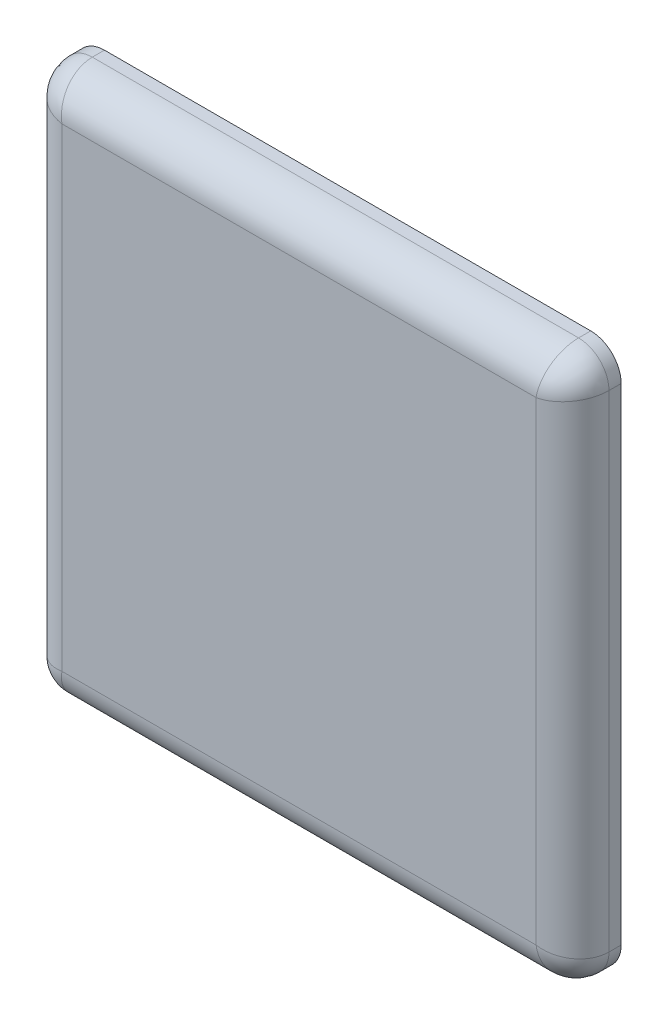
ISO-10303-21;
HEADER;
FILE_DESCRIPTION(('STEP AP214'),'2;1');
FILE_NAME('part.step','',(''),(''),'','','');
FILE_SCHEMA(('AUTOMOTIVE_DESIGN { 1 0 10303 214 1 1 1 1 }'));
ENDSEC;
DATA;
#1=APPLICATION_CONTEXT('core data for automotive mechanical design processes');
#2=APPLICATION_PROTOCOL_DEFINITION('international standard','automotive_design',2000,#1);
#3=PRODUCT_CONTEXT('',#1,'mechanical');
#4=PRODUCT('Part','Part','',(#3));
#5=PRODUCT_RELATED_PRODUCT_CATEGORY('part','',(#4));
#6=PRODUCT_DEFINITION_FORMATION('','',#4);
#7=PRODUCT_DEFINITION_CONTEXT('part definition',#1,'design');
#8=PRODUCT_DEFINITION('design','',#6,#7);
#9=PRODUCT_DEFINITION_SHAPE('','',#8);
#10=(LENGTH_UNIT() NAMED_UNIT(*) SI_UNIT(.MILLI.,.METRE.));
#11=(NAMED_UNIT(*) PLANE_ANGLE_UNIT() SI_UNIT($,.RADIAN.));
#12=(NAMED_UNIT(*) SI_UNIT($,.STERADIAN.) SOLID_ANGLE_UNIT());
#13=UNCERTAINTY_MEASURE_WITH_UNIT(LENGTH_MEASURE(1.E-05),#10,'distance_accuracy_value','');
#14=(GEOMETRIC_REPRESENTATION_CONTEXT(3) GLOBAL_UNCERTAINTY_ASSIGNED_CONTEXT((#13)) GLOBAL_UNIT_ASSIGNED_CONTEXT((#10,
#11,#12)) REPRESENTATION_CONTEXT('',''));
#15=CARTESIAN_POINT('',(0.,0.,0.));
#16=DIRECTION('',(0.,0.,1.));
#17=DIRECTION('',(1.,0.,0.));
#18=AXIS2_PLACEMENT_3D('',#15,#16,#17);
#19=CARTESIAN_POINT('',(-1.73829707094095,3.15251063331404,-8.));
#20=DIRECTION('',(-0.707106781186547,-0.707106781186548,0.));
#21=DIRECTION('',(0.707106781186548,-0.707106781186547,0.));
#22=AXIS2_PLACEMENT_3D('',#19,#20,#21);
#23=PLANE('',#22);
#24=DIRECTION('',(0.,0.,1.));
#25=VECTOR('',#24,1.);
#26=CARTESIAN_POINT('',(-1.,2.4142135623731,-8.));
#27=LINE('',#26,#25);
#28=CARTESIAN_POINT('',(-1.,2.4142135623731,0.));
#29=VERTEX_POINT('',#28);
#30=CARTESIAN_POINT('',(-1.,2.4142135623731,1.));
#31=VERTEX_POINT('',#30);
#32=EDGE_CURVE('E57',#29,#31,#27,.T.);
#33=ORIENTED_EDGE('',*,*,#32,.F.);
#34=DIRECTION('',(0.707106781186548,-0.707106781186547,0.));
#35=VECTOR('',#34,1.);
#36=CARTESIAN_POINT('',(-1.73829707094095,3.15251063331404,0.));
#37=LINE('',#36,#35);
#38=CARTESIAN_POINT('',(0.,1.4142135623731,0.));
#39=VERTEX_POINT('',#38);
#40=EDGE_CURVE('E395',#29,#39,#37,.T.);
#41=ORIENTED_EDGE('',*,*,#40,.T.);
#42=DIRECTION('',(0.,0.,1.));
#43=VECTOR('',#42,1.);
#44=CARTESIAN_POINT('',(0.,1.41421356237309,-8.));
#45=LINE('',#44,#43);
#46=CARTESIAN_POINT('',(0.,1.41421356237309,-8.));
#47=VERTEX_POINT('',#46);
#48=EDGE_CURVE('E588',#47,#39,#45,.T.);
#49=ORIENTED_EDGE('',*,*,#48,.F.);
#50=DIRECTION('',(0.707106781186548,-0.707106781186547,0.));
#51=VECTOR('',#50,1.);
#52=CARTESIAN_POINT('',(-1.73829707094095,3.15251063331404,-8.));
#53=LINE('',#52,#51);
#54=CARTESIAN_POINT('',(-1.02931038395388,2.44352394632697,-8.));
#55=VERTEX_POINT('',#54);
#56=EDGE_CURVE('E525',#55,#47,#53,.T.);
#57=ORIENTED_EDGE('',*,*,#56,.F.);
#58=CARTESIAN_POINT('',(-1.40051743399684,2.81473099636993,-7.58662408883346));
#59=CARTESIAN_POINT('',(-1.3969941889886,2.81120775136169,-7.61363364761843));
#60=CARTESIAN_POINT('',(-1.39178377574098,2.80599733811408,-7.64017877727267));
#61=CARTESIAN_POINT('',(-1.37827722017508,2.79249078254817,-7.69157795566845));
#62=CARTESIAN_POINT('',(-1.36998877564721,2.78420233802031,-7.7164360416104));
#63=CARTESIAN_POINT('',(-1.35059762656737,2.76481118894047,-7.76383248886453));
#64=CARTESIAN_POINT('',(-1.33949581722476,2.75370937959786,-7.78637158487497));
#65=CARTESIAN_POINT('',(-1.31484538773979,2.72905895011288,-7.82859444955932));
#66=CARTESIAN_POINT('',(-1.30129601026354,2.71550957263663,-7.84827733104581));
#67=CARTESIAN_POINT('',(-1.27173668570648,2.68595024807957,-7.88487996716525));
#68=CARTESIAN_POINT('',(-1.25566633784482,2.66987990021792,-7.90170201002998));
#69=CARTESIAN_POINT('',(-1.22184562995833,2.63605919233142,-7.93153366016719));
#70=CARTESIAN_POINT('',(-1.204094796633,2.61830835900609,-7.94454218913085));
#71=CARTESIAN_POINT('',(-1.16633683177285,2.58055039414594,-7.96717389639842));
#72=CARTESIAN_POINT('',(-1.14625867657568,2.56047223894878,-7.97655996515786));
#73=CARTESIAN_POINT('',(-1.10530834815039,2.51952191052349,-7.99073093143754));
#74=CARTESIAN_POINT('',(-1.08443598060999,2.49864954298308,-7.99551469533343));
#75=CARTESIAN_POINT('',(-1.04115621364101,2.45536977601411,-8.00062163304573));
#76=CARTESIAN_POINT('',(-1.01873191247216,2.43294547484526,-8.00065964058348));
#77=CARTESIAN_POINT('',(-0.974168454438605,2.3883820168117,-7.99563883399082));
#78=CARTESIAN_POINT('',(-0.952029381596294,2.36624294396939,-7.99057855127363));
#79=CARTESIAN_POINT('',(-0.907707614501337,2.32192117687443,-7.97519812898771));
#80=CARTESIAN_POINT('',(-0.885560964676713,2.29977452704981,-7.96466916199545));
#81=CARTESIAN_POINT('',(-0.842832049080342,2.25704561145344,-7.9384732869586));
#82=CARTESIAN_POINT('',(-0.822250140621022,2.23646370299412,-7.9228052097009));
#83=CARTESIAN_POINT('',(-0.783448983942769,2.19766254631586,-7.88675633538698));
#84=CARTESIAN_POINT('',(-0.765215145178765,2.17942870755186,-7.86640707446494));
#85=CARTESIAN_POINT('',(-0.731662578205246,2.14587614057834,-7.82134978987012));
#86=CARTESIAN_POINT('',(-0.716342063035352,2.13055562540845,-7.79664445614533));
#87=CARTESIAN_POINT('',(-0.691870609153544,2.10608417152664,-7.74845448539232));
#88=CARTESIAN_POINT('',(-0.682102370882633,2.09631593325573,-7.72559395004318));
#89=CARTESIAN_POINT('',(-0.665409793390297,2.07962335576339,-7.6779255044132));
#90=CARTESIAN_POINT('',(-0.658478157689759,2.07269172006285,-7.65312278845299));
#91=CARTESIAN_POINT('',(-0.650269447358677,2.06448300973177,-7.61415690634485));
#92=CARTESIAN_POINT('',(-0.647864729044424,2.06207829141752,-7.60045428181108));
#93=CARTESIAN_POINT('',(-0.645928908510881,2.06014247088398,-7.58662408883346));
#94=B_SPLINE_CURVE_WITH_KNOTS('',3,(#58,#59,#60,#61,#62,#63,#64,#65,#66,#67,#68,#69,#70,#71,#72,
#73,#74,#75,#76,#77,#78,#79,#80,#81,#82,#83,#84,#85,#86,#87,#88,#89,#90,#91,#92,#93),
.UNSPECIFIED.,.F.,.F.,(4,2,2,2,2,2,2,2,2,2,2,2,2,2,2,2,2,4),(0.,0.0822588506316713,
0.164313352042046,0.24634177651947,0.328395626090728,0.412850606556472,0.497329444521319,
0.586656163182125,0.676004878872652,0.770720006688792,0.865462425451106,0.964122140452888,
1.06280431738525,1.16084021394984,1.25881578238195,1.3386116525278,1.41820095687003,
1.46049530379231),.UNSPECIFIED.);
#95=CARTESIAN_POINT('',(-1.4004911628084,2.8147047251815,-7.58682408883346));
#96=VERTEX_POINT('',#95);
#97=EDGE_CURVE('E468',#96,#55,#94,.T.);
#98=ORIENTED_EDGE('',*,*,#97,.F.);
#99=CARTESIAN_POINT('',(-1.73832302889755,3.15253659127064,-4.9998));
#100=CARTESIAN_POINT('',(-1.6823430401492,3.09655660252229,-5.43108991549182));
#101=CARTESIAN_POINT('',(-1.62622562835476,3.04043919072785,-5.86234424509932));
#102=CARTESIAN_POINT('',(-1.54178166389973,2.95599522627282,-6.50915575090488));
#103=CARTESIAN_POINT('',(-1.51358903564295,2.92780259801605,-6.72474791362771));
#104=CARTESIAN_POINT('',(-1.45710420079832,2.87131776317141,-7.15590622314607));
#105=CARTESIAN_POINT('',(-1.42881199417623,2.84302555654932,-7.37147236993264));
#106=CARTESIAN_POINT('',(-1.40046486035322,2.81467842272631,-7.58702408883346));
#107=B_SPLINE_CURVE_WITH_KNOTS('',3,(#99,#100,#101,#102,#103,#104,#105,#106),.UNSPECIFIED.,.F.,
.F.,(4,2,2,4),(0.,1.31548725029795,1.97323082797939,2.63097463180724),.UNSPECIFIED.);
#108=CARTESIAN_POINT('',(-1.73829707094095,3.15251063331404,-5.));
#109=VERTEX_POINT('',#108);
#110=EDGE_CURVE('E507',#109,#96,#107,.T.);
#111=ORIENTED_EDGE('',*,*,#110,.F.);
#112=DIRECTION('',(0.,0.,1.));
#113=VECTOR('',#112,1.);
#114=CARTESIAN_POINT('',(-1.73829707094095,3.15251063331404,-8.));
#115=LINE('',#114,#113);
#116=CARTESIAN_POINT('',(-1.73829707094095,3.15251063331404,1.));
#117=VERTEX_POINT('',#116);
#118=EDGE_CURVE('E591',#109,#117,#115,.T.);
#119=ORIENTED_EDGE('',*,*,#118,.T.);
#120=DIRECTION('',(0.707106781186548,-0.707106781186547,0.));
#121=VECTOR('',#120,1.);
#122=CARTESIAN_POINT('',(-1.73829707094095,3.15251063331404,1.));
#123=LINE('',#122,#121);
#124=EDGE_CURVE('E551',#117,#31,#123,.T.);
#125=ORIENTED_EDGE('',*,*,#124,.T.);
#126=EDGE_LOOP('',(#33,#41,#49,#57,#98,#111,#119,#125));
#127=FACE_BOUND('',#126,.T.);
#128=ADVANCED_FACE('F34',(#127),#23,.F.);
#129=CARTESIAN_POINT('',(1.73829707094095,3.15251063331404,-8.));
#130=DIRECTION('',(0.707106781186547,-0.707106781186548,0.));
#131=DIRECTION('',(0.707106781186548,0.707106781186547,0.));
#132=AXIS2_PLACEMENT_3D('',#129,#130,#131);
#133=PLANE('',#132);
#134=DIRECTION('',(0.,0.,-1.));
#135=VECTOR('',#134,1.);
#136=CARTESIAN_POINT('',(1.,2.41421356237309,-8.));
#137=LINE('',#136,#135);
#138=CARTESIAN_POINT('',(1.,2.41421356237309,1.));
#139=VERTEX_POINT('',#138);
#140=CARTESIAN_POINT('',(1.,2.4142135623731,0.));
#141=VERTEX_POINT('',#140);
#142=EDGE_CURVE('E359',#139,#141,#137,.T.);
#143=ORIENTED_EDGE('',*,*,#142,.F.);
#144=DIRECTION('',(0.707106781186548,0.707106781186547,0.));
#145=VECTOR('',#144,1.);
#146=CARTESIAN_POINT('',(1.73829707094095,3.15251063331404,1.));
#147=LINE('',#146,#145);
#148=CARTESIAN_POINT('',(1.73829707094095,3.15251063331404,1.));
#149=VERTEX_POINT('',#148);
#150=EDGE_CURVE('E554',#139,#149,#147,.T.);
#151=ORIENTED_EDGE('',*,*,#150,.T.);
#152=DIRECTION('',(0.,0.,1.));
#153=VECTOR('',#152,1.);
#154=CARTESIAN_POINT('',(1.73829707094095,3.15251063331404,-8.));
#155=LINE('',#154,#153);
#156=CARTESIAN_POINT('',(1.73829707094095,3.15251063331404,-5.));
#157=VERTEX_POINT('',#156);
#158=EDGE_CURVE('E585',#157,#149,#155,.T.);
#159=ORIENTED_EDGE('',*,*,#158,.F.);
#160=CARTESIAN_POINT('',(1.40046486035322,2.81467842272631,-7.58702408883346));
#161=CARTESIAN_POINT('',(1.42881199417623,2.84302555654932,-7.37147236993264));
#162=CARTESIAN_POINT('',(1.45710420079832,2.87131776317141,-7.15590622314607));
#163=CARTESIAN_POINT('',(1.51358903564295,2.92780259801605,-6.72474791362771));
#164=CARTESIAN_POINT('',(1.54178166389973,2.95599522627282,-6.50915575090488));
#165=CARTESIAN_POINT('',(1.62622562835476,3.04043919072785,-5.86234424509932));
#166=CARTESIAN_POINT('',(1.6823430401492,3.09655660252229,-5.43108991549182));
#167=CARTESIAN_POINT('',(1.73832302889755,3.15253659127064,-4.9998));
#168=B_SPLINE_CURVE_WITH_KNOTS('',3,(#160,#161,#162,#163,#164,#165,#166,#167),.UNSPECIFIED.,.F.,
.F.,(4,2,2,4),(0.,0.657743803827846,1.31548738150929,2.63097463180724),.UNSPECIFIED.);
#169=CARTESIAN_POINT('',(1.4004911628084,2.8147047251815,-7.58682408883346));
#170=VERTEX_POINT('',#169);
#171=EDGE_CURVE('E828',#170,#157,#168,.T.);
#172=ORIENTED_EDGE('',*,*,#171,.F.);
#173=CARTESIAN_POINT('',(0.645928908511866,2.06014247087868,-7.58662408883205));
#174=CARTESIAN_POINT('',(0.64964935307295,2.06386291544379,-7.61329595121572));
#175=CARTESIAN_POINT('',(0.655115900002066,2.06932946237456,-7.63942585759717));
#176=CARTESIAN_POINT('',(0.669127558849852,2.08334112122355,-7.68984582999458));
#177=CARTESIAN_POINT('',(0.677658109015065,2.09187167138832,-7.71414395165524));
#178=CARTESIAN_POINT('',(0.697407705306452,2.11162126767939,-7.76036319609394));
#179=CARTESIAN_POINT('',(0.7086216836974,2.12283524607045,-7.78228868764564));
#180=CARTESIAN_POINT('',(0.733329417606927,2.14754297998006,-7.8234247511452));
#181=CARTESIAN_POINT('',(0.746825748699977,2.16103931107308,-7.84263221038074));
#182=CARTESIAN_POINT('',(0.776744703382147,2.19095826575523,-7.87930888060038));
#183=CARTESIAN_POINT('',(0.793309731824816,2.20752329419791,-7.89654543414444));
#184=CARTESIAN_POINT('',(0.828102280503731,2.24231584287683,-7.92724007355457));
#185=CARTESIAN_POINT('',(0.84633020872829,2.26054377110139,-7.94069722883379));
#186=CARTESIAN_POINT('',(0.885776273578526,2.29998983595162,-7.96471001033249));
#187=CARTESIAN_POINT('',(0.907114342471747,2.32132790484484,-7.97487293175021));
#188=CARTESIAN_POINT('',(0.950670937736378,2.36488450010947,-7.99021895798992));
#189=CARTESIAN_POINT('',(0.972889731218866,2.38710329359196,-7.99540053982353));
#190=CARTESIAN_POINT('',(1.01855557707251,2.43276913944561,-8.00073284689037));
#191=CARTESIAN_POINT('',(1.04201551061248,2.45622907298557,-8.00066743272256));
#192=CARTESIAN_POINT('',(1.08858689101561,2.50280045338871,-7.99486535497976));
#193=CARTESIAN_POINT('',(1.11169833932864,2.52591190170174,-7.98912871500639));
#194=CARTESIAN_POINT('',(1.15644849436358,2.57066205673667,-7.97215761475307));
#195=CARTESIAN_POINT('',(1.17810622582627,2.59231978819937,-7.96102400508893));
#196=CARTESIAN_POINT('',(1.21967316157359,2.63388672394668,-7.93347571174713));
#197=CARTESIAN_POINT('',(1.23958308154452,2.65379664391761,-7.91706320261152));
#198=CARTESIAN_POINT('',(1.27587930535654,2.69009286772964,-7.88038557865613));
#199=CARTESIAN_POINT('',(1.29240047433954,2.70661403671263,-7.86038759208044));
#200=CARTESIAN_POINT('',(1.32264118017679,2.73685474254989,-7.81650237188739));
#201=CARTESIAN_POINT('',(1.33636035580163,2.75057391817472,-7.79261463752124));
#202=CARTESIAN_POINT('',(1.35968682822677,2.77390039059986,-7.74326627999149));
#203=CARTESIAN_POINT('',(1.36949769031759,2.78371125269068,-7.71799758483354));
#204=CARTESIAN_POINT('',(1.38578173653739,2.79999529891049,-7.66544474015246));
#205=CARTESIAN_POINT('',(1.39226377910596,2.80647734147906,-7.63816616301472));
#206=CARTESIAN_POINT('',(1.39829193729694,2.81250549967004,-7.60246676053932));
#207=CARTESIAN_POINT('',(1.39947714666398,2.81369070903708,-7.59456243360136));
#208=CARTESIAN_POINT('',(1.40051743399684,2.81473099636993,-7.58662408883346));
#209=B_SPLINE_CURVE_WITH_KNOTS('',3,(#173,#174,#175,#176,#177,#178,#179,#180,#181,#182,#183,
#184,#185,#186,#187,#188,#189,#190,#191,#192,#193,#194,#195,#196,#197,#198,#199,#200,#201,#202,
#203,#204,#205,#206,#207,#208),.UNSPECIFIED.,.F.,.F.,(4,2,2,2,2,2,2,2,2,2,2,2,2,2,2,2,2,4),(0.,
0.0813668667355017,0.162352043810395,0.24318546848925,0.324110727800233,0.41100406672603,
0.497918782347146,0.593020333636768,0.688150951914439,0.787202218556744,0.886253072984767,
0.983520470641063,1.08074785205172,1.17253199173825,1.26432795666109,1.35038041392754,
1.436202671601,1.46043158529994),.UNSPECIFIED.);
#210=CARTESIAN_POINT('',(1.02931038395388,2.44352394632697,-8.));
#211=VERTEX_POINT('',#210);
#212=EDGE_CURVE('E461',#211,#170,#209,.T.);
#213=ORIENTED_EDGE('',*,*,#212,.F.);
#214=DIRECTION('',(0.707106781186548,0.707106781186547,0.));
#215=VECTOR('',#214,1.);
#216=CARTESIAN_POINT('',(1.73829707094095,3.15251063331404,-8.));
#217=LINE('',#216,#215);
#218=EDGE_CURVE('E527',#47,#211,#217,.T.);
#219=ORIENTED_EDGE('',*,*,#218,.F.);
#220=ORIENTED_EDGE('',*,*,#48,.T.);
#221=DIRECTION('',(0.707106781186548,0.707106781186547,0.));
#222=VECTOR('',#221,1.);
#223=CARTESIAN_POINT('',(1.73829707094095,3.15251063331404,0.));
#224=LINE('',#223,#222);
#225=EDGE_CURVE('E393',#39,#141,#224,.T.);
#226=ORIENTED_EDGE('',*,*,#225,.T.);
#227=EDGE_LOOP('',(#143,#151,#159,#172,#213,#219,#220,#226));
#228=FACE_BOUND('',#227,.T.);
#229=ADVANCED_FACE('F815',(#228),#133,.F.);
#230=CARTESIAN_POINT('',(0.,-1.4142135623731,-8.));
#231=DIRECTION('',(0.707106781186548,0.707106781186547,0.));
#232=DIRECTION('',(-0.707106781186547,0.707106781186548,0.));
#233=AXIS2_PLACEMENT_3D('',#230,#231,#232);
#234=PLANE('',#233);
#235=DIRECTION('',(0.,0.,1.));
#236=VECTOR('',#235,1.);
#237=CARTESIAN_POINT('',(1.,-2.4142135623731,-8.));
#238=LINE('',#237,#236);
#239=CARTESIAN_POINT('',(1.,-2.4142135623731,0.));
#240=VERTEX_POINT('',#239);
#241=CARTESIAN_POINT('',(1.,-2.4142135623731,1.));
#242=VERTEX_POINT('',#241);
#243=EDGE_CURVE('E387',#240,#242,#238,.T.);
#244=ORIENTED_EDGE('',*,*,#243,.F.);
#245=DIRECTION('',(-0.707106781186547,0.707106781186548,0.));
#246=VECTOR('',#245,1.);
#247=CARTESIAN_POINT('',(0.,-1.4142135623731,0.));
#248=LINE('',#247,#246);
#249=CARTESIAN_POINT('',(0.,-1.4142135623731,0.));
#250=VERTEX_POINT('',#249);
#251=EDGE_CURVE('E390',#240,#250,#248,.T.);
#252=ORIENTED_EDGE('',*,*,#251,.T.);
#253=DIRECTION('',(0.,0.,1.));
#254=VECTOR('',#253,1.);
#255=CARTESIAN_POINT('',(0.,-1.4142135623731,-8.));
#256=LINE('',#255,#254);
#257=CARTESIAN_POINT('',(0.,-1.4142135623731,-8.));
#258=VERTEX_POINT('',#257);
#259=EDGE_CURVE('E573',#258,#250,#256,.T.);
#260=ORIENTED_EDGE('',*,*,#259,.F.);
#261=DIRECTION('',(-0.707106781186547,0.707106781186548,0.));
#262=VECTOR('',#261,1.);
#263=CARTESIAN_POINT('',(0.,-1.4142135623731,-8.));
#264=LINE('',#263,#262);
#265=CARTESIAN_POINT('',(1.02931038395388,-2.44352394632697,-8.));
#266=VERTEX_POINT('',#265);
#267=EDGE_CURVE('E535',#266,#258,#264,.T.);
#268=ORIENTED_EDGE('',*,*,#267,.F.);
#269=CARTESIAN_POINT('',(1.40051743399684,-2.81473099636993,-7.58662408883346));
#270=CARTESIAN_POINT('',(1.3969941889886,-2.81120775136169,-7.61363364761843));
#271=CARTESIAN_POINT('',(1.39178377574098,-2.80599733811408,-7.64017877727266));
#272=CARTESIAN_POINT('',(1.37827722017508,-2.79249078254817,-7.69157795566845));
#273=CARTESIAN_POINT('',(1.36998877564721,-2.78420233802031,-7.7164360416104));
#274=CARTESIAN_POINT('',(1.35059762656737,-2.76481118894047,-7.76383248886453));
#275=CARTESIAN_POINT('',(1.33949581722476,-2.75370937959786,-7.78637158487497));
#276=CARTESIAN_POINT('',(1.31484538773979,-2.72905895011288,-7.82859444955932));
#277=CARTESIAN_POINT('',(1.30129601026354,-2.71550957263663,-7.84827733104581));
#278=CARTESIAN_POINT('',(1.27173668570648,-2.68595024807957,-7.88487996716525));
#279=CARTESIAN_POINT('',(1.25566633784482,-2.66987990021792,-7.90170201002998));
#280=CARTESIAN_POINT('',(1.22184562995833,-2.63605919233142,-7.93153366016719));
#281=CARTESIAN_POINT('',(1.204094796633,-2.6183083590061,-7.94454218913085));
#282=CARTESIAN_POINT('',(1.16633683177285,-2.58055039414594,-7.96717389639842));
#283=CARTESIAN_POINT('',(1.14625867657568,-2.56047223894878,-7.97655996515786));
#284=CARTESIAN_POINT('',(1.10530834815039,-2.51952191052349,-7.99073093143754));
#285=CARTESIAN_POINT('',(1.08443598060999,-2.49864954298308,-7.99551469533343));
#286=CARTESIAN_POINT('',(1.04115621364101,-2.45536977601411,-8.00062163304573));
#287=CARTESIAN_POINT('',(1.01873191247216,-2.43294547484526,-8.00065964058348));
#288=CARTESIAN_POINT('',(0.974168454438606,-2.3883820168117,-7.99563883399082));
#289=CARTESIAN_POINT('',(0.952029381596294,-2.36624294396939,-7.99057855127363));
#290=CARTESIAN_POINT('',(0.907707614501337,-2.32192117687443,-7.97519812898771));
#291=CARTESIAN_POINT('',(0.885560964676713,-2.29977452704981,-7.96466916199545));
#292=CARTESIAN_POINT('',(0.842832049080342,-2.25704561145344,-7.9384732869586));
#293=CARTESIAN_POINT('',(0.822250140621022,-2.23646370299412,-7.9228052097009));
#294=CARTESIAN_POINT('',(0.783448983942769,-2.19766254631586,-7.88675633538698));
#295=CARTESIAN_POINT('',(0.765215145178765,-2.17942870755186,-7.86640707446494));
#296=CARTESIAN_POINT('',(0.731662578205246,-2.14587614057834,-7.82134978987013));
#297=CARTESIAN_POINT('',(0.716342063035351,-2.13055562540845,-7.79664445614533));
#298=CARTESIAN_POINT('',(0.691870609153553,-2.10608417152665,-7.74845448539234));
#299=CARTESIAN_POINT('',(0.682102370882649,-2.09631593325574,-7.72559395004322));
#300=CARTESIAN_POINT('',(0.665409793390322,-2.07962335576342,-7.67792550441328));
#301=CARTESIAN_POINT('',(0.658478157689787,-2.07269172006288,-7.65312278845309));
#302=CARTESIAN_POINT('',(0.650269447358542,-2.06448300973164,-7.61415690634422));
#303=CARTESIAN_POINT('',(0.647864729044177,-2.06207829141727,-7.60045428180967));
#304=CARTESIAN_POINT('',(0.645928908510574,-2.06014247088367,-7.58662408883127));
#305=B_SPLINE_CURVE_WITH_KNOTS('',3,(#269,#270,#271,#272,#273,#274,#275,#276,#277,#278,#279,
#280,#281,#282,#283,#284,#285,#286,#287,#288,#289,#290,#291,#292,#293,#294,#295,#296,#297,#298,
#299,#300,#301,#302,#303,#304),.UNSPECIFIED.,.F.,.F.,(4,2,2,2,2,2,2,2,2,2,2,2,2,2,2,2,2,4),(0.,
0.0822588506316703,0.164313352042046,0.24634177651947,0.328395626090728,0.412850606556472,
0.497329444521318,0.586656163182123,0.676004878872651,0.770720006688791,0.865462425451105,
0.964122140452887,1.06280431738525,1.16084021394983,1.25881578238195,1.33861165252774,
1.4182009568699,1.46049530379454),.UNSPECIFIED.);
#306=CARTESIAN_POINT('',(1.4004911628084,-2.8147047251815,-7.58682408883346));
#307=VERTEX_POINT('',#306);
#308=EDGE_CURVE('E418',#307,#266,#305,.T.);
#309=ORIENTED_EDGE('',*,*,#308,.F.);
#310=CARTESIAN_POINT('',(1.73832302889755,-3.15253659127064,-4.9998));
#311=CARTESIAN_POINT('',(1.6823430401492,-3.09655660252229,-5.43108991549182));
#312=CARTESIAN_POINT('',(1.62622562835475,-3.04043919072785,-5.86234424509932));
#313=CARTESIAN_POINT('',(1.54178166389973,-2.95599522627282,-6.50915575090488));
#314=CARTESIAN_POINT('',(1.51358903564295,-2.92780259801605,-6.7247479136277));
#315=CARTESIAN_POINT('',(1.45710420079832,-2.87131776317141,-7.15590622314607));
#316=CARTESIAN_POINT('',(1.42881199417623,-2.84302555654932,-7.37147236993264));
#317=CARTESIAN_POINT('',(1.40046486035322,-2.81467842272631,-7.58702408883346));
#318=B_SPLINE_CURVE_WITH_KNOTS('',3,(#310,#311,#312,#313,#314,#315,#316,#317),.UNSPECIFIED.,.F.,
.F.,(4,2,2,4),(0.,1.31548725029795,1.97323082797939,2.63097463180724),.UNSPECIFIED.);
#319=CARTESIAN_POINT('',(1.73829707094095,-3.15251063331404,-5.));
#320=VERTEX_POINT('',#319);
#321=EDGE_CURVE('E864',#320,#307,#318,.T.);
#322=ORIENTED_EDGE('',*,*,#321,.F.);
#323=DIRECTION('',(0.,0.,1.));
#324=VECTOR('',#323,1.);
#325=CARTESIAN_POINT('',(1.73829707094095,-3.15251063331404,-8.));
#326=LINE('',#325,#324);
#327=CARTESIAN_POINT('',(1.73829707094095,-3.15251063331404,1.));
#328=VERTEX_POINT('',#327);
#329=EDGE_CURVE('E576',#320,#328,#326,.T.);
#330=ORIENTED_EDGE('',*,*,#329,.T.);
#331=DIRECTION('',(-0.707106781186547,0.707106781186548,0.));
#332=VECTOR('',#331,1.);
#333=CARTESIAN_POINT('',(0.,-1.4142135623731,1.));
#334=LINE('',#333,#332);
#335=EDGE_CURVE('E567',#328,#242,#334,.T.);
#336=ORIENTED_EDGE('',*,*,#335,.T.);
#337=EDGE_LOOP('',(#244,#252,#260,#268,#309,#322,#330,#336));
#338=FACE_BOUND('',#337,.T.);
#339=ADVANCED_FACE('F820',(#338),#234,.F.);
#340=CARTESIAN_POINT('',(0.,-1.4142135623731,-8.));
#341=DIRECTION('',(-0.707106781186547,0.707106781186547,0.));
#342=DIRECTION('',(-0.707106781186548,-0.707106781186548,0.));
#343=AXIS2_PLACEMENT_3D('',#340,#341,#342);
#344=PLANE('',#343);
#345=DIRECTION('',(0.,0.,-1.));
#346=VECTOR('',#345,1.);
#347=CARTESIAN_POINT('',(-1.,-2.4142135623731,-8.));
#348=LINE('',#347,#346);
#349=CARTESIAN_POINT('',(-1.,-2.4142135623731,1.));
#350=VERTEX_POINT('',#349);
#351=CARTESIAN_POINT('',(-0.999999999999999,-2.41421356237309,0.));
#352=VERTEX_POINT('',#351);
#353=EDGE_CURVE('E378',#350,#352,#348,.T.);
#354=ORIENTED_EDGE('',*,*,#353,.F.);
#355=DIRECTION('',(-0.707106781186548,-0.707106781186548,0.));
#356=VECTOR('',#355,1.);
#357=CARTESIAN_POINT('',(0.,-1.4142135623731,1.));
#358=LINE('',#357,#356);
#359=CARTESIAN_POINT('',(-1.73829707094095,-3.15251063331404,1.));
#360=VERTEX_POINT('',#359);
#361=EDGE_CURVE('E522',#350,#360,#358,.T.);
#362=ORIENTED_EDGE('',*,*,#361,.T.);
#363=DIRECTION('',(0.,0.,1.));
#364=VECTOR('',#363,1.);
#365=CARTESIAN_POINT('',(-1.73829707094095,-3.15251063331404,-8.));
#366=LINE('',#365,#364);
#367=CARTESIAN_POINT('',(-1.73829707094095,-3.15251063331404,-5.));
#368=VERTEX_POINT('',#367);
#369=EDGE_CURVE('E540',#368,#360,#366,.T.);
#370=ORIENTED_EDGE('',*,*,#369,.F.);
#371=CARTESIAN_POINT('',(-1.40046486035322,-2.81467842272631,-7.58702408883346));
#372=CARTESIAN_POINT('',(-1.42881199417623,-2.84302555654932,-7.37147236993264));
#373=CARTESIAN_POINT('',(-1.45710420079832,-2.87131776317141,-7.15590622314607));
#374=CARTESIAN_POINT('',(-1.51358903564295,-2.92780259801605,-6.72474791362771));
#375=CARTESIAN_POINT('',(-1.54178166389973,-2.95599522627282,-6.50915575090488));
#376=CARTESIAN_POINT('',(-1.62622562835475,-3.04043919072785,-5.86234424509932));
#377=CARTESIAN_POINT('',(-1.68234304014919,-3.09655660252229,-5.43108991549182));
#378=CARTESIAN_POINT('',(-1.73832302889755,-3.15253659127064,-4.9998));
#379=B_SPLINE_CURVE_WITH_KNOTS('',3,(#371,#372,#373,#374,#375,#376,#377,#378),.UNSPECIFIED.,.F.,
.F.,(4,2,2,4),(0.,0.657743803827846,1.31548738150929,2.63097463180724),.UNSPECIFIED.);
#380=CARTESIAN_POINT('',(-1.4004911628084,-2.8147047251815,-7.58682408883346));
#381=VERTEX_POINT('',#380);
#382=EDGE_CURVE('E907',#381,#368,#379,.T.);
#383=ORIENTED_EDGE('',*,*,#382,.F.);
#384=CARTESIAN_POINT('',(-0.645928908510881,-2.06014247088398,-7.58662408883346));
#385=CARTESIAN_POINT('',(-0.649649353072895,-2.06386291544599,-7.61329595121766));
#386=CARTESIAN_POINT('',(-0.655115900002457,-2.06932946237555,-7.63942585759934));
#387=CARTESIAN_POINT('',(-0.669127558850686,-2.08334112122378,-7.68984582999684));
#388=CARTESIAN_POINT('',(-0.677658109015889,-2.09187167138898,-7.71414395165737));
#389=CARTESIAN_POINT('',(-0.697407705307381,-2.11162126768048,-7.76036319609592));
#390=CARTESIAN_POINT('',(-0.70862168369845,-2.12283524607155,-7.7822886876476));
#391=CARTESIAN_POINT('',(-0.733329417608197,-2.14754297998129,-7.82342475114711));
#392=CARTESIAN_POINT('',(-0.746825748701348,-2.16103931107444,-7.84263221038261));
#393=CARTESIAN_POINT('',(-0.776744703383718,-2.19095826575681,-7.87930888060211));
#394=CARTESIAN_POINT('',(-0.793309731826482,-2.20752329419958,-7.89654543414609));
#395=CARTESIAN_POINT('',(-0.828102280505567,-2.24231584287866,-7.92724007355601));
#396=CARTESIAN_POINT('',(-0.8463302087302,-2.2605437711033,-7.94069722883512));
#397=CARTESIAN_POINT('',(-0.885776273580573,-2.29998983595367,-7.96471001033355));
#398=CARTESIAN_POINT('',(-0.907114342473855,-2.32132790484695,-7.97487293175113));
#399=CARTESIAN_POINT('',(-0.950670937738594,-2.36488450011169,-7.99021895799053));
#400=CARTESIAN_POINT('',(-0.97288973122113,-2.38710329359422,-7.99540053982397));
#401=CARTESIAN_POINT('',(-1.01855557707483,-2.43276913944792,-8.00073284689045));
#402=CARTESIAN_POINT('',(-1.0420155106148,-2.4562290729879,-8.00066743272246));
#403=CARTESIAN_POINT('',(-1.08858689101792,-2.50280045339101,-7.99486535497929));
#404=CARTESIAN_POINT('',(-1.11169833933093,-2.52591190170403,-7.98912871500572));
#405=CARTESIAN_POINT('',(-1.15644849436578,-2.57066205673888,-7.97215761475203));
#406=CARTESIAN_POINT('',(-1.17810622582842,-2.59231978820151,-7.96102400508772));
#407=CARTESIAN_POINT('',(-1.21967316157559,-2.63388672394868,-7.9334757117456));
#408=CARTESIAN_POINT('',(-1.23958308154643,-2.65379664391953,-7.91706320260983));
#409=CARTESIAN_POINT('',(-1.27587930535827,-2.69009286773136,-7.88038557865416));
#410=CARTESIAN_POINT('',(-1.29240047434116,-2.70661403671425,-7.86038759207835));
#411=CARTESIAN_POINT('',(-1.32264118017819,-2.73685474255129,-7.8165023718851));
#412=CARTESIAN_POINT('',(-1.33636035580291,-2.750573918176,-7.79261463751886));
#413=CARTESIAN_POINT('',(-1.35968682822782,-2.77390039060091,-7.74326627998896));
#414=CARTESIAN_POINT('',(-1.36949769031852,-2.78371125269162,-7.71799758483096));
#415=CARTESIAN_POINT('',(-1.38578173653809,-2.79999529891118,-7.66544474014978));
#416=CARTESIAN_POINT('',(-1.39226377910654,-2.80647734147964,-7.63816616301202));
#417=CARTESIAN_POINT('',(-1.39829193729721,-2.81250549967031,-7.6024667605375));
#418=CARTESIAN_POINT('',(-1.3994771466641,-2.8136907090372,-7.59456243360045));
#419=CARTESIAN_POINT('',(-1.40051743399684,-2.81473099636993,-7.58662408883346));
#420=B_SPLINE_CURVE_WITH_KNOTS('',3,(#384,#385,#386,#387,#388,#389,#390,#391,#392,#393,#394,
#395,#396,#397,#398,#399,#400,#401,#402,#403,#404,#405,#406,#407,#408,#409,#410,#411,#412,#413,
#414,#415,#416,#417,#418,#419),.UNSPECIFIED.,.F.,.F.,(4,2,2,2,2,2,2,2,2,2,2,2,2,2,2,2,2,4),(0.,
0.0813668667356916,0.162352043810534,0.243185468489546,0.32411072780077,0.411004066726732,
0.497918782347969,0.593020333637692,0.68815095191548,0.787202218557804,0.886253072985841,
0.983520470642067,1.08074785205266,1.17253199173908,1.26432795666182,1.35038041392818,
1.43620267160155,1.46043158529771),.UNSPECIFIED.);
#421=CARTESIAN_POINT('',(-1.02931038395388,-2.44352394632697,-8.));
#422=VERTEX_POINT('',#421);
#423=EDGE_CURVE('E410',#422,#381,#420,.T.);
#424=ORIENTED_EDGE('',*,*,#423,.F.);
#425=DIRECTION('',(-0.707106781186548,-0.707106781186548,0.));
#426=VECTOR('',#425,1.);
#427=CARTESIAN_POINT('',(0.,-1.4142135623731,-8.));
#428=LINE('',#427,#426);
#429=EDGE_CURVE('E537',#258,#422,#428,.T.);
#430=ORIENTED_EDGE('',*,*,#429,.F.);
#431=ORIENTED_EDGE('',*,*,#259,.T.);
#432=DIRECTION('',(-0.707106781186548,-0.707106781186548,0.));
#433=VECTOR('',#432,1.);
#434=CARTESIAN_POINT('',(0.,-1.4142135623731,0.));
#435=LINE('',#434,#433);
#436=EDGE_CURVE('E11',#250,#352,#435,.T.);
#437=ORIENTED_EDGE('',*,*,#436,.T.);
#438=EDGE_LOOP('',(#354,#362,#370,#383,#424,#430,#431,#437));
#439=FACE_BOUND('',#438,.T.);
#440=ADVANCED_FACE('F425',(#439),#344,.F.);
#441=CARTESIAN_POINT('',(17.,17.,1.));
#442=DIRECTION('',(0.,0.,-1.));
#443=DIRECTION('',(-1.,0.,0.));
#444=AXIS2_PLACEMENT_3D('',#441,#442,#443);
#445=PLANE('',#444);
#446=DIRECTION('',(-1.,0.,0.));
#447=VECTOR('',#446,1.);
#448=CARTESIAN_POINT('',(5.1,14.5,1.));
#449=LINE('',#448,#447);
#450=CARTESIAN_POINT('',(5.1,14.5,1.));
#451=VERTEX_POINT('',#450);
#452=CARTESIAN_POINT('',(-5.1,14.5,1.));
#453=VERTEX_POINT('',#452);
#454=EDGE_CURVE('E630',#451,#453,#449,.T.);
#455=ORIENTED_EDGE('',*,*,#454,.F.);
#456=DIRECTION('',(0.,-1.,0.));
#457=VECTOR('',#456,1.);
#458=CARTESIAN_POINT('',(5.1,14.5,1.));
#459=LINE('',#458,#457);
#460=CARTESIAN_POINT('',(5.1,17.,1.));
#461=VERTEX_POINT('',#460);
#462=EDGE_CURVE('E603',#461,#451,#459,.T.);
#463=ORIENTED_EDGE('',*,*,#462,.F.);
#464=DIRECTION('',(1.,0.,0.));
#465=VECTOR('',#464,1.);
#466=CARTESIAN_POINT('',(-17.,17.,1.));
#467=LINE('',#466,#465);
#468=CARTESIAN_POINT('',(17.,17.,1.));
#469=VERTEX_POINT('',#468);
#470=EDGE_CURVE('E647',#461,#469,#467,.T.);
#471=ORIENTED_EDGE('',*,*,#470,.T.);
#472=DIRECTION('',(0.,-1.,0.));
#473=VECTOR('',#472,1.);
#474=CARTESIAN_POINT('',(17.,-17.,1.));
#475=LINE('',#474,#473);
#476=CARTESIAN_POINT('',(17.,-17.,1.));
#477=VERTEX_POINT('',#476);
#478=EDGE_CURVE('E637',#469,#477,#475,.T.);
#479=ORIENTED_EDGE('',*,*,#478,.T.);
#480=DIRECTION('',(-1.,0.,0.));
#481=VECTOR('',#480,1.);
#482=CARTESIAN_POINT('',(-17.,-17.,1.));
#483=LINE('',#482,#481);
#484=CARTESIAN_POINT('',(-17.,-17.,1.));
#485=VERTEX_POINT('',#484);
#486=EDGE_CURVE('E640',#477,#485,#483,.T.);
#487=ORIENTED_EDGE('',*,*,#486,.T.);
#488=DIRECTION('',(0.,1.,0.));
#489=VECTOR('',#488,1.);
#490=CARTESIAN_POINT('',(-17.,-17.,1.));
#491=LINE('',#490,#489);
#492=CARTESIAN_POINT('',(-17.,17.,1.));
#493=VERTEX_POINT('',#492);
#494=EDGE_CURVE('E644',#485,#493,#491,.T.);
#495=ORIENTED_EDGE('',*,*,#494,.T.);
#496=CARTESIAN_POINT('',(-5.1,17.,1.));
#497=VERTEX_POINT('',#496);
#498=EDGE_CURVE('E648',#493,#497,#467,.T.);
#499=ORIENTED_EDGE('',*,*,#498,.T.);
#500=DIRECTION('',(0.,-1.,0.));
#501=VECTOR('',#500,1.);
#502=CARTESIAN_POINT('',(-5.1,14.5,1.));
#503=LINE('',#502,#501);
#504=EDGE_CURVE('E600',#497,#453,#503,.T.);
#505=ORIENTED_EDGE('',*,*,#504,.T.);
#506=EDGE_LOOP('',(#455,#463,#471,#479,#487,#495,#499,#505));
#507=FACE_BOUND('',#506,.T.);
#508=ORIENTED_EDGE('',*,*,#150,.F.);
#509=DIRECTION('',(0.,-1.,0.));
#510=VECTOR('',#509,1.);
#511=CARTESIAN_POINT('',(1.,5.,1.));
#512=LINE('',#511,#510);
#513=CARTESIAN_POINT('',(1.,5.,1.));
#514=VERTEX_POINT('',#513);
#515=EDGE_CURVE('E1452',#514,#139,#512,.T.);
#516=ORIENTED_EDGE('',*,*,#515,.F.);
#517=CARTESIAN_POINT('',(0.,5.,1.));
#518=DIRECTION('',(0.,0.,-1.));
#519=DIRECTION('',(-1.,0.,0.));
#520=AXIS2_PLACEMENT_3D('',#517,#518,#519);
#521=CIRCLE('',#520,1.);
#522=CARTESIAN_POINT('',(-1.,5.,1.));
#523=VERTEX_POINT('',#522);
#524=EDGE_CURVE('E376',#523,#514,#521,.T.);
#525=ORIENTED_EDGE('',*,*,#524,.F.);
#526=DIRECTION('',(0.,-1.,0.));
#527=VECTOR('',#526,1.);
#528=CARTESIAN_POINT('',(-1.,17.,1.));
#529=LINE('',#528,#527);
#530=EDGE_CURVE('E42',#523,#31,#529,.T.);
#531=ORIENTED_EDGE('',*,*,#530,.T.);
#532=ORIENTED_EDGE('',*,*,#124,.F.);
#533=CARTESIAN_POINT('',(0.,0.,1.));
#534=DIRECTION('',(0.,0.,-1.));
#535=DIRECTION('',(-1.,0.,0.));
#536=AXIS2_PLACEMENT_3D('',#533,#534,#535);
#537=CIRCLE('',#536,3.6);
#538=CARTESIAN_POINT('',(-3.15251063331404,1.73829707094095,1.));
#539=VERTEX_POINT('',#538);
#540=EDGE_CURVE('E548',#539,#117,#537,.T.);
#541=ORIENTED_EDGE('',*,*,#540,.F.);
#542=DIRECTION('',(-0.707106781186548,0.707106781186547,0.));
#543=VECTOR('',#542,1.);
#544=CARTESIAN_POINT('',(-3.15251063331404,1.73829707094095,1.));
#545=LINE('',#544,#543);
#546=CARTESIAN_POINT('',(-1.4142135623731,0.,1.));
#547=VERTEX_POINT('',#546);
#548=EDGE_CURVE('E545',#547,#539,#545,.T.);
#549=ORIENTED_EDGE('',*,*,#548,.F.);
#550=DIRECTION('',(0.707106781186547,0.707106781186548,0.));
#551=VECTOR('',#550,1.);
#552=CARTESIAN_POINT('',(-1.4142135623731,0.,1.));
#553=LINE('',#552,#551);
#554=CARTESIAN_POINT('',(-3.15251063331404,-1.73829707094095,1.));
#555=VERTEX_POINT('',#554);
#556=EDGE_CURVE('E543',#555,#547,#553,.T.);
#557=ORIENTED_EDGE('',*,*,#556,.F.);
#558=CARTESIAN_POINT('',(0.,0.,1.));
#559=DIRECTION('',(0.,0.,-1.));
#560=DIRECTION('',(-1.,0.,0.));
#561=AXIS2_PLACEMENT_3D('',#558,#559,#560);
#562=CIRCLE('',#561,3.6);
#563=EDGE_CURVE('E518',#360,#555,#562,.T.);
#564=ORIENTED_EDGE('',*,*,#563,.F.);
#565=ORIENTED_EDGE('',*,*,#361,.F.);
#566=DIRECTION('',(0.,1.,0.));
#567=VECTOR('',#566,1.);
#568=CARTESIAN_POINT('',(-1.,5.,1.));
#569=LINE('',#568,#567);
#570=CARTESIAN_POINT('',(-1.,-5.,1.));
#571=VERTEX_POINT('',#570);
#572=EDGE_CURVE('E372',#571,#350,#569,.T.);
#573=ORIENTED_EDGE('',*,*,#572,.F.);
#574=CARTESIAN_POINT('',(0.,-5.,1.));
#575=DIRECTION('',(0.,0.,-1.));
#576=DIRECTION('',(-1.,0.,0.));
#577=AXIS2_PLACEMENT_3D('',#574,#575,#576);
#578=CIRCLE('',#577,1.);
#579=CARTESIAN_POINT('',(1.,-5.,1.));
#580=VERTEX_POINT('',#579);
#581=EDGE_CURVE('E951',#580,#571,#578,.T.);
#582=ORIENTED_EDGE('',*,*,#581,.F.);
#583=DIRECTION('',(0.,1.,0.));
#584=VECTOR('',#583,1.);
#585=CARTESIAN_POINT('',(1.,17.,1.));
#586=LINE('',#585,#584);
#587=EDGE_CURVE('E949',#580,#242,#586,.T.);
#588=ORIENTED_EDGE('',*,*,#587,.T.);
#589=ORIENTED_EDGE('',*,*,#335,.F.);
#590=CARTESIAN_POINT('',(0.,0.,1.));
#591=DIRECTION('',(0.,0.,-1.));
#592=DIRECTION('',(-1.,0.,0.));
#593=AXIS2_PLACEMENT_3D('',#590,#591,#592);
#594=CIRCLE('',#593,3.6);
#595=CARTESIAN_POINT('',(3.15251063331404,-1.73829707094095,1.));
#596=VERTEX_POINT('',#595);
#597=EDGE_CURVE('E564',#596,#328,#594,.T.);
#598=ORIENTED_EDGE('',*,*,#597,.F.);
#599=DIRECTION('',(0.707106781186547,-0.707106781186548,0.));
#600=VECTOR('',#599,1.);
#601=CARTESIAN_POINT('',(1.4142135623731,0.,1.));
#602=LINE('',#601,#600);
#603=CARTESIAN_POINT('',(1.4142135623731,0.,1.));
#604=VERTEX_POINT('',#603);
#605=EDGE_CURVE('E561',#604,#596,#602,.T.);
#606=ORIENTED_EDGE('',*,*,#605,.F.);
#607=DIRECTION('',(-0.707106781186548,-0.707106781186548,0.));
#608=VECTOR('',#607,1.);
#609=CARTESIAN_POINT('',(3.15251063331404,1.73829707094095,1.));
#610=LINE('',#609,#608);
#611=CARTESIAN_POINT('',(3.15251063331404,1.73829707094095,1.));
#612=VERTEX_POINT('',#611);
#613=EDGE_CURVE('E559',#612,#604,#610,.T.);
#614=ORIENTED_EDGE('',*,*,#613,.F.);
#615=CARTESIAN_POINT('',(0.,0.,1.));
#616=DIRECTION('',(0.,0.,-1.));
#617=DIRECTION('',(-1.,0.,0.));
#618=AXIS2_PLACEMENT_3D('',#615,#616,#617);
#619=CIRCLE('',#618,3.6);
#620=EDGE_CURVE('E556',#149,#612,#619,.T.);
#621=ORIENTED_EDGE('',*,*,#620,.F.);
#622=EDGE_LOOP('',(#508,#516,#525,#531,#532,#541,#549,#557,#564,#565,#573,#582,#588,#589,#598,
#606,#614,#621));
#623=FACE_BOUND('',#622,.T.);
#624=ADVANCED_FACE('F941',(#507,#623),#445,.T.);
#625=CARTESIAN_POINT('',(0.,0.,-8.));
#626=DIRECTION('',(0.,0.,1.));
#627=DIRECTION('',(1.,0.,0.));
#628=AXIS2_PLACEMENT_3D('',#625,#626,#627);
#629=CYLINDRICAL_SURFACE('',#628,3.6);
#630=CARTESIAN_POINT('',(0.,0.,-5.));
#631=DIRECTION('',(0.,0.,1.));
#632=DIRECTION('',(0.,-1.,0.));
#633=AXIS2_PLACEMENT_3D('',#630,#631,#632);
#634=CIRCLE('',#633,3.6);
#635=CARTESIAN_POINT('',(-3.15251063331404,-1.73829707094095,-5.));
#636=VERTEX_POINT('',#635);
#637=EDGE_CURVE('E402',#636,#368,#634,.T.);
#638=ORIENTED_EDGE('',*,*,#637,.T.);
#639=ORIENTED_EDGE('',*,*,#369,.T.);
#640=ORIENTED_EDGE('',*,*,#563,.T.);
#641=DIRECTION('',(0.,0.,1.));
#642=VECTOR('',#641,1.);
#643=CARTESIAN_POINT('',(-3.15251063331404,-1.73829707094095,-8.));
#644=LINE('',#643,#642);
#645=EDGE_CURVE('E598',#636,#555,#644,.T.);
#646=ORIENTED_EDGE('',*,*,#645,.F.);
#647=EDGE_LOOP('',(#638,#639,#640,#646));
#648=FACE_BOUND('',#647,.T.);
#649=ADVANCED_FACE('F1227',(#648),#629,.T.);
#650=CARTESIAN_POINT('',(-1.4142135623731,0.,-8.));
#651=DIRECTION('',(0.707106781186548,-0.707106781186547,0.));
#652=DIRECTION('',(0.707106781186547,0.707106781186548,0.));
#653=AXIS2_PLACEMENT_3D('',#650,#651,#652);
#654=PLANE('',#653);
#655=CARTESIAN_POINT('',(-2.81473099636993,-1.40051743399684,-7.58662408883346));
#656=CARTESIAN_POINT('',(-2.81120775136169,-1.3969941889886,-7.61363364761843));
#657=CARTESIAN_POINT('',(-2.80599733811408,-1.39178377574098,-7.64017877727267));
#658=CARTESIAN_POINT('',(-2.79249078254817,-1.37827722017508,-7.69157795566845));
#659=CARTESIAN_POINT('',(-2.78420233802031,-1.36998877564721,-7.7164360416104));
#660=CARTESIAN_POINT('',(-2.76481118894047,-1.35059762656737,-7.76383248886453));
#661=CARTESIAN_POINT('',(-2.75370937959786,-1.33949581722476,-7.78637158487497));
#662=CARTESIAN_POINT('',(-2.72905895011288,-1.31484538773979,-7.82859444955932));
#663=CARTESIAN_POINT('',(-2.71550957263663,-1.30129601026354,-7.84827733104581));
#664=CARTESIAN_POINT('',(-2.68595024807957,-1.27173668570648,-7.88487996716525));
#665=CARTESIAN_POINT('',(-2.66987990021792,-1.25566633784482,-7.90170201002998));
#666=CARTESIAN_POINT('',(-2.63605919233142,-1.22184562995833,-7.93153366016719));
#667=CARTESIAN_POINT('',(-2.61830835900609,-1.204094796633,-7.94454218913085));
#668=CARTESIAN_POINT('',(-2.58055039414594,-1.16633683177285,-7.96717389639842));
#669=CARTESIAN_POINT('',(-2.56047223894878,-1.14625867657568,-7.97655996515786));
#670=CARTESIAN_POINT('',(-2.51952191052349,-1.10530834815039,-7.99073093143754));
#671=CARTESIAN_POINT('',(-2.49864954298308,-1.08443598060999,-7.99551469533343));
#672=CARTESIAN_POINT('',(-2.45536977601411,-1.04115621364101,-8.00062163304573));
#673=CARTESIAN_POINT('',(-2.43294547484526,-1.01873191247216,-8.00065964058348));
#674=CARTESIAN_POINT('',(-2.3883820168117,-0.974168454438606,-7.99563883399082));
#675=CARTESIAN_POINT('',(-2.36624294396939,-0.952029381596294,-7.99057855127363));
#676=CARTESIAN_POINT('',(-2.32192117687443,-0.907707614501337,-7.97519812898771));
#677=CARTESIAN_POINT('',(-2.29977452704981,-0.885560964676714,-7.96466916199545));
#678=CARTESIAN_POINT('',(-2.25704561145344,-0.842832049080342,-7.9384732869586));
#679=CARTESIAN_POINT('',(-2.23646370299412,-0.822250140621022,-7.9228052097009));
#680=CARTESIAN_POINT('',(-2.19766254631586,-0.783448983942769,-7.88675633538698));
#681=CARTESIAN_POINT('',(-2.17942870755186,-0.765215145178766,-7.86640707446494));
#682=CARTESIAN_POINT('',(-2.14587614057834,-0.731662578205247,-7.82134978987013));
#683=CARTESIAN_POINT('',(-2.13055562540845,-0.716342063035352,-7.79664445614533));
#684=CARTESIAN_POINT('',(-2.10608417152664,-0.691870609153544,-7.74845448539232));
#685=CARTESIAN_POINT('',(-2.09631593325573,-0.682102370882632,-7.72559395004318));
#686=CARTESIAN_POINT('',(-2.07962335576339,-0.665409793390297,-7.6779255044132));
#687=CARTESIAN_POINT('',(-2.07269172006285,-0.658478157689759,-7.65312278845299));
#688=CARTESIAN_POINT('',(-2.06448300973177,-0.650269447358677,-7.61415690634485));
#689=CARTESIAN_POINT('',(-2.06207829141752,-0.647864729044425,-7.60045428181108));
#690=CARTESIAN_POINT('',(-2.06014247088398,-0.645928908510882,-7.58662408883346));
#691=B_SPLINE_CURVE_WITH_KNOTS('',3,(#655,#656,#657,#658,#659,#660,#661,#662,#663,#664,#665,
#666,#667,#668,#669,#670,#671,#672,#673,#674,#675,#676,#677,#678,#679,#680,#681,#682,#683,#684,
#685,#686,#687,#688,#689,#690),.UNSPECIFIED.,.F.,.F.,(4,2,2,2,2,2,2,2,2,2,2,2,2,2,2,2,2,4),(0.,
0.0822588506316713,0.164313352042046,0.24634177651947,0.328395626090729,0.412850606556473,
0.497329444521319,0.586656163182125,0.676004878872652,0.770720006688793,0.865462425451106,
0.964122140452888,1.06280431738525,1.16084021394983,1.25881578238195,1.33861165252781,
1.41820095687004,1.46049530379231),.UNSPECIFIED.);
#692=CARTESIAN_POINT('',(-2.8147047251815,-1.4004911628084,-7.58682408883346));
#693=VERTEX_POINT('',#692);
#694=CARTESIAN_POINT('',(-2.44352394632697,-1.02931038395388,-8.));
#695=VERTEX_POINT('',#694);
#696=EDGE_CURVE('E481',#693,#695,#691,.T.);
#697=ORIENTED_EDGE('',*,*,#696,.F.);
#698=CARTESIAN_POINT('',(-3.15253659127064,-1.73832302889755,-4.9998));
#699=CARTESIAN_POINT('',(-3.09655660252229,-1.6823430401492,-5.43108991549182));
#700=CARTESIAN_POINT('',(-3.04043919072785,-1.62622562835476,-5.86234424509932));
#701=CARTESIAN_POINT('',(-2.95599522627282,-1.54178166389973,-6.50915575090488));
#702=CARTESIAN_POINT('',(-2.92780259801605,-1.51358903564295,-6.72474791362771));
#703=CARTESIAN_POINT('',(-2.87131776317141,-1.45710420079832,-7.15590622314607));
#704=CARTESIAN_POINT('',(-2.84302555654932,-1.42881199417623,-7.37147236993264));
#705=CARTESIAN_POINT('',(-2.81467842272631,-1.40046486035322,-7.58702408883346));
#706=B_SPLINE_CURVE_WITH_KNOTS('',3,(#698,#699,#700,#701,#702,#703,#704,#705),.UNSPECIFIED.,.F.,
.F.,(4,2,2,4),(0.,1.31548725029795,1.97323082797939,2.63097463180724),.UNSPECIFIED.);
#707=EDGE_CURVE('E506',#636,#693,#706,.T.);
#708=ORIENTED_EDGE('',*,*,#707,.F.);
#709=ORIENTED_EDGE('',*,*,#645,.T.);
#710=ORIENTED_EDGE('',*,*,#556,.T.);
#711=DIRECTION('',(0.,0.,1.));
#712=VECTOR('',#711,1.);
#713=CARTESIAN_POINT('',(-1.4142135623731,0.,-8.));
#714=LINE('',#713,#712);
#715=CARTESIAN_POINT('',(-1.4142135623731,0.,-8.));
#716=VERTEX_POINT('',#715);
#717=EDGE_CURVE('E595',#716,#547,#714,.T.);
#718=ORIENTED_EDGE('',*,*,#717,.F.);
#719=DIRECTION('',(0.707106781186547,0.707106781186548,0.));
#720=VECTOR('',#719,1.);
#721=CARTESIAN_POINT('',(-1.4142135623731,0.,-8.));
#722=LINE('',#721,#720);
#723=EDGE_CURVE('E519',#695,#716,#722,.T.);
#724=ORIENTED_EDGE('',*,*,#723,.F.);
#725=EDGE_LOOP('',(#697,#708,#709,#710,#718,#724));
#726=FACE_BOUND('',#725,.T.);
#727=ADVANCED_FACE('F493',(#726),#654,.F.);
#728=CARTESIAN_POINT('',(-3.15251063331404,1.73829707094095,-8.));
#729=DIRECTION('',(0.707106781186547,0.707106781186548,0.));
#730=DIRECTION('',(-0.707106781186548,0.707106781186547,0.));
#731=AXIS2_PLACEMENT_3D('',#728,#729,#730);
#732=PLANE('',#731);
#733=CARTESIAN_POINT('',(-2.0601424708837,0.645928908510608,-7.58662408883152));
#734=CARTESIAN_POINT('',(-2.06386291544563,0.649649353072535,-7.61329595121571));
#735=CARTESIAN_POINT('',(-2.0693294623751,0.655115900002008,-7.63942585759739));
#736=CARTESIAN_POINT('',(-2.08334112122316,0.669127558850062,-7.68984582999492));
#737=CARTESIAN_POINT('',(-2.09187167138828,0.677658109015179,-7.71414395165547));
#738=CARTESIAN_POINT('',(-2.1116212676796,0.697407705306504,-7.7603631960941));
#739=CARTESIAN_POINT('',(-2.12283524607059,0.708621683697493,-7.78228868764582));
#740=CARTESIAN_POINT('',(-2.14754297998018,0.733329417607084,-7.82342475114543));
#741=CARTESIAN_POINT('',(-2.16103931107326,0.746825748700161,-7.842632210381));
#742=CARTESIAN_POINT('',(-2.19095826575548,0.776744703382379,-7.87930888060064));
#743=CARTESIAN_POINT('',(-2.20752329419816,0.793309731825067,-7.89654543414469));
#744=CARTESIAN_POINT('',(-2.2423158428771,0.828102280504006,-7.92724007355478));
#745=CARTESIAN_POINT('',(-2.26054377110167,0.846330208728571,-7.94069722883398));
#746=CARTESIAN_POINT('',(-2.29998983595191,0.88577627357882,-7.96471001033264));
#747=CARTESIAN_POINT('',(-2.32132790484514,0.907114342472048,-7.97487293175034));
#748=CARTESIAN_POINT('',(-2.36488450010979,0.950670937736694,-7.99021895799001));
#749=CARTESIAN_POINT('',(-2.38710329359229,0.972889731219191,-7.9954005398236));
#750=CARTESIAN_POINT('',(-2.43276913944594,1.01855557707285,-8.00073284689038));
#751=CARTESIAN_POINT('',(-2.45622907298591,1.04201551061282,-8.00066743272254));
#752=CARTESIAN_POINT('',(-2.50280045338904,1.08858689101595,-7.99486535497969));
#753=CARTESIAN_POINT('',(-2.52591190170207,1.11169833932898,-7.98912871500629));
#754=CARTESIAN_POINT('',(-2.57066205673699,1.1564484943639,-7.97215761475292));
#755=CARTESIAN_POINT('',(-2.59231978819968,1.17810622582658,-7.96102400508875));
#756=CARTESIAN_POINT('',(-2.63388672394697,1.21967316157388,-7.93347571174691));
#757=CARTESIAN_POINT('',(-2.65379664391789,1.2395830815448,-7.91706320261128));
#758=CARTESIAN_POINT('',(-2.69009286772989,1.27587930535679,-7.88038557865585));
#759=CARTESIAN_POINT('',(-2.70661403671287,1.29240047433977,-7.86038759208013));
#760=CARTESIAN_POINT('',(-2.73685474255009,1.322641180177,-7.81650237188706));
#761=CARTESIAN_POINT('',(-2.75057391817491,1.33636035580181,-7.7926146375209));
#762=CARTESIAN_POINT('',(-2.77390039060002,1.35968682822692,-7.74326627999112));
#763=CARTESIAN_POINT('',(-2.78371125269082,1.36949769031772,-7.71799758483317));
#764=CARTESIAN_POINT('',(-2.79999529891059,1.38578173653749,-7.66544474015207));
#765=CARTESIAN_POINT('',(-2.80647734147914,1.39226377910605,-7.63816616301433));
#766=CARTESIAN_POINT('',(-2.81250549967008,1.39829193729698,-7.60246676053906));
#767=CARTESIAN_POINT('',(-2.81369070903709,1.399477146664,-7.59456243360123));
#768=CARTESIAN_POINT('',(-2.81473099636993,1.40051743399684,-7.58662408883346));
#769=B_SPLINE_CURVE_WITH_KNOTS('',3,(#733,#734,#735,#736,#737,#738,#739,#740,#741,#742,#743,
#744,#745,#746,#747,#748,#749,#750,#751,#752,#753,#754,#755,#756,#757,#758,#759,#760,#761,#762,
#763,#764,#765,#766,#767,#768),.UNSPECIFIED.,.F.,.F.,(4,2,2,2,2,2,2,2,2,2,2,2,2,2,2,2,2,4),(0.,
0.0813668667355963,0.162352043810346,0.243185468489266,0.324110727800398,0.411004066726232,
0.497918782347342,0.593020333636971,0.688150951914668,0.787202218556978,0.886253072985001,
0.983520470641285,1.08074785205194,1.17253199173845,1.26432795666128,1.35038041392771,
1.43620267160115,1.46043158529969),.UNSPECIFIED.);
#770=CARTESIAN_POINT('',(-2.44352394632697,1.02931038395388,-8.));
#771=VERTEX_POINT('',#770);
#772=CARTESIAN_POINT('',(-2.8147047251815,1.4004911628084,-7.58682408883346));
#773=VERTEX_POINT('',#772);
#774=EDGE_CURVE('E475',#771,#773,#769,.T.);
#775=ORIENTED_EDGE('',*,*,#774,.F.);
#776=DIRECTION('',(-0.707106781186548,0.707106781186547,0.));
#777=VECTOR('',#776,1.);
#778=CARTESIAN_POINT('',(-3.15251063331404,1.73829707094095,-8.));
#779=LINE('',#778,#777);
#780=EDGE_CURVE('E521',#716,#771,#779,.T.);
#781=ORIENTED_EDGE('',*,*,#780,.F.);
#782=ORIENTED_EDGE('',*,*,#717,.T.);
#783=ORIENTED_EDGE('',*,*,#548,.T.);
#784=DIRECTION('',(0.,0.,1.));
#785=VECTOR('',#784,1.);
#786=CARTESIAN_POINT('',(-3.15251063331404,1.73829707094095,-8.));
#787=LINE('',#786,#785);
#788=CARTESIAN_POINT('',(-3.15251063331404,1.73829707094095,-5.));
#789=VERTEX_POINT('',#788);
#790=EDGE_CURVE('E593',#789,#539,#787,.T.);
#791=ORIENTED_EDGE('',*,*,#790,.F.);
#792=CARTESIAN_POINT('',(-2.81467842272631,1.40046486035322,-7.58702408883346));
#793=CARTESIAN_POINT('',(-2.84302555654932,1.42881199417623,-7.37147236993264));
#794=CARTESIAN_POINT('',(-2.87131776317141,1.45710420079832,-7.15590622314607));
#795=CARTESIAN_POINT('',(-2.92780259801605,1.51358903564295,-6.72474791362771));
#796=CARTESIAN_POINT('',(-2.95599522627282,1.54178166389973,-6.50915575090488));
#797=CARTESIAN_POINT('',(-3.04043919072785,1.62622562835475,-5.86234424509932));
#798=CARTESIAN_POINT('',(-3.09655660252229,1.6823430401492,-5.43108991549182));
#799=CARTESIAN_POINT('',(-3.15253659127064,1.73832302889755,-4.9998));
#800=B_SPLINE_CURVE_WITH_KNOTS('',3,(#792,#793,#794,#795,#796,#797,#798,#799),.UNSPECIFIED.,.F.,
.F.,(4,2,2,4),(0.,0.657743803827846,1.31548738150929,2.63097463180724),.UNSPECIFIED.);
#801=EDGE_CURVE('E499',#773,#789,#800,.T.);
#802=ORIENTED_EDGE('',*,*,#801,.F.);
#803=EDGE_LOOP('',(#775,#781,#782,#783,#791,#802));
#804=FACE_BOUND('',#803,.T.);
#805=ADVANCED_FACE('F488',(#804),#732,.F.);
#806=CARTESIAN_POINT('',(0.,0.,-8.));
#807=DIRECTION('',(0.,0.,1.));
#808=DIRECTION('',(1.,0.,0.));
#809=AXIS2_PLACEMENT_3D('',#806,#807,#808);
#810=CYLINDRICAL_SURFACE('',#809,3.6);
#811=EDGE_CURVE('E1460',#109,#789,#634,.T.);
#812=ORIENTED_EDGE('',*,*,#811,.T.);
#813=ORIENTED_EDGE('',*,*,#790,.T.);
#814=ORIENTED_EDGE('',*,*,#540,.T.);
#815=ORIENTED_EDGE('',*,*,#118,.F.);
#816=EDGE_LOOP('',(#812,#813,#814,#815));
#817=FACE_BOUND('',#816,.T.);
#818=ADVANCED_FACE('F492',(#817),#810,.T.);
#819=CARTESIAN_POINT('',(0.,0.,-8.));
#820=DIRECTION('',(0.,0.,1.));
#821=DIRECTION('',(1.,0.,0.));
#822=AXIS2_PLACEMENT_3D('',#819,#820,#821);
#823=CYLINDRICAL_SURFACE('',#822,3.6);
#824=CARTESIAN_POINT('',(3.15251063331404,1.73829707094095,-5.));
#825=VERTEX_POINT('',#824);
#826=EDGE_CURVE('E408',#825,#157,#634,.T.);
#827=ORIENTED_EDGE('',*,*,#826,.T.);
#828=ORIENTED_EDGE('',*,*,#158,.T.);
#829=ORIENTED_EDGE('',*,*,#620,.T.);
#830=DIRECTION('',(0.,0.,1.));
#831=VECTOR('',#830,1.);
#832=CARTESIAN_POINT('',(3.15251063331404,1.73829707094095,-8.));
#833=LINE('',#832,#831);
#834=EDGE_CURVE('E583',#825,#612,#833,.T.);
#835=ORIENTED_EDGE('',*,*,#834,.F.);
#836=EDGE_LOOP('',(#827,#828,#829,#835));
#837=FACE_BOUND('',#836,.T.);
#838=ADVANCED_FACE('F826',(#837),#823,.T.);
#839=CARTESIAN_POINT('',(3.15251063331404,1.73829707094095,-8.));
#840=DIRECTION('',(-0.707106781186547,0.707106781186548,0.));
#841=DIRECTION('',(-0.707106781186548,-0.707106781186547,0.));
#842=AXIS2_PLACEMENT_3D('',#839,#840,#841);
#843=PLANE('',#842);
#844=CARTESIAN_POINT('',(2.81473099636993,1.40051743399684,-7.58662408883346));
#845=CARTESIAN_POINT('',(2.81120775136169,1.3969941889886,-7.61363364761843));
#846=CARTESIAN_POINT('',(2.80599733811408,1.39178377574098,-7.64017877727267));
#847=CARTESIAN_POINT('',(2.79249078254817,1.37827722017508,-7.69157795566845));
#848=CARTESIAN_POINT('',(2.78420233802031,1.36998877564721,-7.7164360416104));
#849=CARTESIAN_POINT('',(2.76481118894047,1.35059762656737,-7.76383248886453));
#850=CARTESIAN_POINT('',(2.75370937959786,1.33949581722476,-7.78637158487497));
#851=CARTESIAN_POINT('',(2.72905895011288,1.31484538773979,-7.82859444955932));
#852=CARTESIAN_POINT('',(2.71550957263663,1.30129601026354,-7.84827733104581));
#853=CARTESIAN_POINT('',(2.68595024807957,1.27173668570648,-7.88487996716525));
#854=CARTESIAN_POINT('',(2.66987990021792,1.25566633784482,-7.90170201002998));
#855=CARTESIAN_POINT('',(2.63605919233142,1.22184562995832,-7.93153366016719));
#856=CARTESIAN_POINT('',(2.6183083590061,1.204094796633,-7.94454218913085));
#857=CARTESIAN_POINT('',(2.58055039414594,1.16633683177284,-7.96717389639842));
#858=CARTESIAN_POINT('',(2.56047223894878,1.14625867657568,-7.97655996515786));
#859=CARTESIAN_POINT('',(2.51952191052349,1.10530834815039,-7.99073093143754));
#860=CARTESIAN_POINT('',(2.49864954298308,1.08443598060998,-7.99551469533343));
#861=CARTESIAN_POINT('',(2.45536977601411,1.04115621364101,-8.00062163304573));
#862=CARTESIAN_POINT('',(2.43294547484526,1.01873191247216,-8.00065964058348));
#863=CARTESIAN_POINT('',(2.3883820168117,0.974168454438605,-7.99563883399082));
#864=CARTESIAN_POINT('',(2.36624294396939,0.952029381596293,-7.99057855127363));
#865=CARTESIAN_POINT('',(2.32192117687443,0.907707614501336,-7.97519812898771));
#866=CARTESIAN_POINT('',(2.29977452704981,0.885560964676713,-7.96466916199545));
#867=CARTESIAN_POINT('',(2.25704561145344,0.842832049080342,-7.9384732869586));
#868=CARTESIAN_POINT('',(2.23646370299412,0.822250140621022,-7.9228052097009));
#869=CARTESIAN_POINT('',(2.19766254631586,0.783448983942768,-7.88675633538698));
#870=CARTESIAN_POINT('',(2.17942870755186,0.765215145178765,-7.86640707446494));
#871=CARTESIAN_POINT('',(2.14587614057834,0.731662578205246,-7.82134978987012));
#872=CARTESIAN_POINT('',(2.13055562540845,0.716342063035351,-7.79664445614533));
#873=CARTESIAN_POINT('',(2.10608417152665,0.691870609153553,-7.74845448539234));
#874=CARTESIAN_POINT('',(2.09631593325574,0.682102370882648,-7.72559395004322));
#875=CARTESIAN_POINT('',(2.07962335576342,0.665409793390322,-7.67792550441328));
#876=CARTESIAN_POINT('',(2.07269172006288,0.658478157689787,-7.65312278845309));
#877=CARTESIAN_POINT('',(2.06448300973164,0.650269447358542,-7.61415690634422));
#878=CARTESIAN_POINT('',(2.06207829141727,0.647864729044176,-7.60045428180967));
#879=CARTESIAN_POINT('',(2.06014247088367,0.645928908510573,-7.58662408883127));
#880=B_SPLINE_CURVE_WITH_KNOTS('',3,(#844,#845,#846,#847,#848,#849,#850,#851,#852,#853,#854,
#855,#856,#857,#858,#859,#860,#861,#862,#863,#864,#865,#866,#867,#868,#869,#870,#871,#872,#873,
#874,#875,#876,#877,#878,#879),.UNSPECIFIED.,.F.,.F.,(4,2,2,2,2,2,2,2,2,2,2,2,2,2,2,2,2,4),(0.,
0.0822588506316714,0.164313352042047,0.246341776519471,0.328395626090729,0.412850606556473,
0.497329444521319,0.586656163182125,0.676004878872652,0.770720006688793,0.865462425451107,
0.964122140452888,1.06280431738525,1.16084021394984,1.25881578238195,1.33861165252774,
1.4182009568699,1.46049530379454),.UNSPECIFIED.);
#881=CARTESIAN_POINT('',(2.8147047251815,1.4004911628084,-7.58682408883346));
#882=VERTEX_POINT('',#881);
#883=CARTESIAN_POINT('',(2.44352394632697,1.02931038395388,-8.));
#884=VERTEX_POINT('',#883);
#885=EDGE_CURVE('E453',#882,#884,#880,.T.);
#886=ORIENTED_EDGE('',*,*,#885,.F.);
#887=CARTESIAN_POINT('',(3.15253659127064,1.73832302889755,-4.9998));
#888=CARTESIAN_POINT('',(3.09655660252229,1.6823430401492,-5.43108991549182));
#889=CARTESIAN_POINT('',(3.04043919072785,1.62622562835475,-5.86234424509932));
#890=CARTESIAN_POINT('',(2.95599522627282,1.54178166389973,-6.50915575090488));
#891=CARTESIAN_POINT('',(2.92780259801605,1.51358903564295,-6.7247479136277));
#892=CARTESIAN_POINT('',(2.87131776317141,1.45710420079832,-7.15590622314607));
#893=CARTESIAN_POINT('',(2.84302555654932,1.42881199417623,-7.37147236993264));
#894=CARTESIAN_POINT('',(2.81467842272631,1.40046486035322,-7.58702408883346));
#895=B_SPLINE_CURVE_WITH_KNOTS('',3,(#887,#888,#889,#890,#891,#892,#893,#894),.UNSPECIFIED.,.F.,
.F.,(4,2,2,4),(0.,1.31548725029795,1.97323082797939,2.63097463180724),.UNSPECIFIED.);
#896=EDGE_CURVE('E834',#825,#882,#895,.T.);
#897=ORIENTED_EDGE('',*,*,#896,.F.);
#898=ORIENTED_EDGE('',*,*,#834,.T.);
#899=ORIENTED_EDGE('',*,*,#613,.T.);
#900=DIRECTION('',(0.,0.,1.));
#901=VECTOR('',#900,1.);
#902=CARTESIAN_POINT('',(1.4142135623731,0.,-8.));
#903=LINE('',#902,#901);
#904=CARTESIAN_POINT('',(1.4142135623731,0.,-8.));
#905=VERTEX_POINT('',#904);
#906=EDGE_CURVE('E580',#905,#604,#903,.T.);
#907=ORIENTED_EDGE('',*,*,#906,.F.);
#908=DIRECTION('',(-0.707106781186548,-0.707106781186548,0.));
#909=VECTOR('',#908,1.);
#910=CARTESIAN_POINT('',(3.15251063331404,1.73829707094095,-8.));
#911=LINE('',#910,#909);
#912=EDGE_CURVE('E530',#884,#905,#911,.T.);
#913=ORIENTED_EDGE('',*,*,#912,.F.);
#914=EDGE_LOOP('',(#886,#897,#898,#899,#907,#913));
#915=FACE_BOUND('',#914,.T.);
#916=ADVANCED_FACE('F845',(#915),#843,.F.);
#917=CARTESIAN_POINT('',(1.4142135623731,0.,-8.));
#918=DIRECTION('',(-0.707106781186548,-0.707106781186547,0.));
#919=DIRECTION('',(0.707106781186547,-0.707106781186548,0.));
#920=AXIS2_PLACEMENT_3D('',#917,#918,#919);
#921=PLANE('',#920);
#922=CARTESIAN_POINT('',(2.06014247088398,-0.645928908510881,-7.58662408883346));
#923=CARTESIAN_POINT('',(2.06386291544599,-0.649649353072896,-7.61329595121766));
#924=CARTESIAN_POINT('',(2.06932946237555,-0.655115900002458,-7.63942585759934));
#925=CARTESIAN_POINT('',(2.08334112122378,-0.669127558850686,-7.68984582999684));
#926=CARTESIAN_POINT('',(2.09187167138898,-0.677658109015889,-7.71414395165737));
#927=CARTESIAN_POINT('',(2.11162126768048,-0.697407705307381,-7.76036319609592));
#928=CARTESIAN_POINT('',(2.12283524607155,-0.70862168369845,-7.7822886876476));
#929=CARTESIAN_POINT('',(2.14754297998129,-0.733329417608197,-7.8234247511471));
#930=CARTESIAN_POINT('',(2.16103931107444,-0.746825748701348,-7.84263221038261));
#931=CARTESIAN_POINT('',(2.19095826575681,-0.776744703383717,-7.87930888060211));
#932=CARTESIAN_POINT('',(2.20752329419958,-0.793309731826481,-7.89654543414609));
#933=CARTESIAN_POINT('',(2.24231584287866,-0.828102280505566,-7.92724007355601));
#934=CARTESIAN_POINT('',(2.26054377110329,-0.846330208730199,-7.94069722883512));
#935=CARTESIAN_POINT('',(2.29998983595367,-0.885776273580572,-7.96471001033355));
#936=CARTESIAN_POINT('',(2.32132790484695,-0.907114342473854,-7.97487293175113));
#937=CARTESIAN_POINT('',(2.36488450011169,-0.950670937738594,-7.99021895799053));
#938=CARTESIAN_POINT('',(2.38710329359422,-0.972889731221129,-7.99540053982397));
#939=CARTESIAN_POINT('',(2.43276913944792,-1.01855557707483,-8.00073284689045));
#940=CARTESIAN_POINT('',(2.4562290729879,-1.0420155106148,-8.00066743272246));
#941=CARTESIAN_POINT('',(2.50280045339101,-1.08858689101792,-7.99486535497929));
#942=CARTESIAN_POINT('',(2.52591190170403,-1.11169833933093,-7.98912871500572));
#943=CARTESIAN_POINT('',(2.57066205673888,-1.15644849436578,-7.97215761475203));
#944=CARTESIAN_POINT('',(2.59231978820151,-1.17810622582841,-7.96102400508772));
#945=CARTESIAN_POINT('',(2.63388672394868,-1.21967316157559,-7.9334757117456));
#946=CARTESIAN_POINT('',(2.65379664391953,-1.23958308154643,-7.91706320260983));
#947=CARTESIAN_POINT('',(2.69009286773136,-1.27587930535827,-7.88038557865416));
#948=CARTESIAN_POINT('',(2.70661403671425,-1.29240047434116,-7.86038759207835));
#949=CARTESIAN_POINT('',(2.73685474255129,-1.32264118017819,-7.8165023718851));
#950=CARTESIAN_POINT('',(2.750573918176,-1.33636035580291,-7.79261463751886));
#951=CARTESIAN_POINT('',(2.77390039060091,-1.35968682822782,-7.74326627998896));
#952=CARTESIAN_POINT('',(2.78371125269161,-1.36949769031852,-7.71799758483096));
#953=CARTESIAN_POINT('',(2.79999529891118,-1.38578173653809,-7.66544474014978));
#954=CARTESIAN_POINT('',(2.80647734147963,-1.39226377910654,-7.63816616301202));
#955=CARTESIAN_POINT('',(2.81250549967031,-1.39829193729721,-7.6024667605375));
#956=CARTESIAN_POINT('',(2.8136907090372,-1.3994771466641,-7.59456243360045));
#957=CARTESIAN_POINT('',(2.81473099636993,-1.40051743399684,-7.58662408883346));
#958=B_SPLINE_CURVE_WITH_KNOTS('',3,(#922,#923,#924,#925,#926,#927,#928,#929,#930,#931,#932,
#933,#934,#935,#936,#937,#938,#939,#940,#941,#942,#943,#944,#945,#946,#947,#948,#949,#950,#951,
#952,#953,#954,#955,#956,#957),.UNSPECIFIED.,.F.,.F.,(4,2,2,2,2,2,2,2,2,2,2,2,2,2,2,2,2,4),(0.,
0.0813668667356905,0.162352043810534,0.243185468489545,0.32411072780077,0.411004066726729,
0.497918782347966,0.59302033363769,0.688150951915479,0.787202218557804,0.88625307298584,
0.983520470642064,1.08074785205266,1.17253199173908,1.26432795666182,1.35038041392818,
1.43620267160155,1.46043158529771),.UNSPECIFIED.);
#959=CARTESIAN_POINT('',(2.44352394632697,-1.02931038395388,-8.));
#960=VERTEX_POINT('',#959);
#961=CARTESIAN_POINT('',(2.8147047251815,-1.4004911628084,-7.58682408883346));
#962=VERTEX_POINT('',#961);
#963=EDGE_CURVE('E445',#960,#962,#958,.T.);
#964=ORIENTED_EDGE('',*,*,#963,.F.);
#965=DIRECTION('',(0.707106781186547,-0.707106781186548,0.));
#966=VECTOR('',#965,1.);
#967=CARTESIAN_POINT('',(1.4142135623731,0.,-8.));
#968=LINE('',#967,#966);
#969=EDGE_CURVE('E532',#905,#960,#968,.T.);
#970=ORIENTED_EDGE('',*,*,#969,.F.);
#971=ORIENTED_EDGE('',*,*,#906,.T.);
#972=ORIENTED_EDGE('',*,*,#605,.T.);
#973=DIRECTION('',(0.,0.,1.));
#974=VECTOR('',#973,1.);
#975=CARTESIAN_POINT('',(3.15251063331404,-1.73829707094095,-8.));
#976=LINE('',#975,#974);
#977=CARTESIAN_POINT('',(3.15251063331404,-1.73829707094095,-5.));
#978=VERTEX_POINT('',#977);
#979=EDGE_CURVE('E578',#978,#596,#976,.T.);
#980=ORIENTED_EDGE('',*,*,#979,.F.);
#981=CARTESIAN_POINT('',(2.81467842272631,-1.40046486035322,-7.58702408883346));
#982=CARTESIAN_POINT('',(2.84302555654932,-1.42881199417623,-7.37147236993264));
#983=CARTESIAN_POINT('',(2.87131776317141,-1.45710420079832,-7.15590622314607));
#984=CARTESIAN_POINT('',(2.92780259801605,-1.51358903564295,-6.72474791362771));
#985=CARTESIAN_POINT('',(2.95599522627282,-1.54178166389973,-6.50915575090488));
#986=CARTESIAN_POINT('',(3.04043919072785,-1.62622562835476,-5.86234424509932));
#987=CARTESIAN_POINT('',(3.09655660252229,-1.6823430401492,-5.43108991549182));
#988=CARTESIAN_POINT('',(3.15253659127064,-1.73832302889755,-4.9998));
#989=B_SPLINE_CURVE_WITH_KNOTS('',3,(#981,#982,#983,#984,#985,#986,#987,#988),.UNSPECIFIED.,.F.,
.F.,(4,2,2,4),(0.,0.657743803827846,1.31548738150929,2.63097463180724),.UNSPECIFIED.);
#990=EDGE_CURVE('E840',#962,#978,#989,.T.);
#991=ORIENTED_EDGE('',*,*,#990,.F.);
#992=EDGE_LOOP('',(#964,#970,#971,#972,#980,#991));
#993=FACE_BOUND('',#992,.T.);
#994=ADVANCED_FACE('F848',(#993),#921,.F.);
#995=CARTESIAN_POINT('',(0.,0.,-8.));
#996=DIRECTION('',(0.,0.,1.));
#997=DIRECTION('',(1.,0.,0.));
#998=AXIS2_PLACEMENT_3D('',#995,#996,#997);
#999=CYLINDRICAL_SURFACE('',#998,3.6);
#1000=EDGE_CURVE('E404',#320,#978,#634,.T.);
#1001=ORIENTED_EDGE('',*,*,#1000,.T.);
#1002=ORIENTED_EDGE('',*,*,#979,.T.);
#1003=ORIENTED_EDGE('',*,*,#597,.T.);
#1004=ORIENTED_EDGE('',*,*,#329,.F.);
#1005=EDGE_LOOP('',(#1001,#1002,#1003,#1004));
#1006=FACE_BOUND('',#1005,.T.);
#1007=ADVANCED_FACE('F854',(#1006),#999,.T.);
#1008=CARTESIAN_POINT('',(-17.,17.,1.));
#1009=DIRECTION('',(0.,1.,0.));
#1010=DIRECTION('',(-1.,0.,0.));
#1011=AXIS2_PLACEMENT_3D('',#1008,#1009,#1010);
#1012=PLANE('',#1011);
#1013=DIRECTION('',(0.,0.,1.));
#1014=VECTOR('',#1013,1.);
#1015=CARTESIAN_POINT('',(5.1,17.,0.));
#1016=LINE('',#1015,#1014);
#1017=CARTESIAN_POINT('',(5.1,17.,0.));
#1018=VERTEX_POINT('',#1017);
#1019=EDGE_CURVE('E604',#1018,#461,#1016,.T.);
#1020=ORIENTED_EDGE('',*,*,#1019,.F.);
#1021=DIRECTION('',(1.,0.,0.));
#1022=VECTOR('',#1021,1.);
#1023=CARTESIAN_POINT('',(-17.,17.,0.));
#1024=LINE('',#1023,#1022);
#1025=CARTESIAN_POINT('',(17.,17.,0.));
#1026=VERTEX_POINT('',#1025);
#1027=EDGE_CURVE('E658',#1018,#1026,#1024,.T.);
#1028=ORIENTED_EDGE('',*,*,#1027,.T.);
#1029=DIRECTION('',(0.,0.,-1.));
#1030=VECTOR('',#1029,1.);
#1031=CARTESIAN_POINT('',(17.,17.,1.));
#1032=LINE('',#1031,#1030);
#1033=EDGE_CURVE('E661',#469,#1026,#1032,.T.);
#1034=ORIENTED_EDGE('',*,*,#1033,.F.);
#1035=ORIENTED_EDGE('',*,*,#470,.F.);
#1036=EDGE_LOOP('',(#1020,#1028,#1034,#1035));
#1037=FACE_BOUND('',#1036,.T.);
#1038=ADVANCED_FACE('F858',(#1037),#1012,.F.);
#1039=CARTESIAN_POINT('',(-22.5,22.5,4.));
#1040=DIRECTION('',(1.,0.,0.));
#1041=DIRECTION('',(0.,0.,-1.));
#1042=AXIS2_PLACEMENT_3D('',#1039,#1040,#1041);
#1043=PLANE('',#1042);
#1044=DIRECTION('',(0.,0.,-1.));
#1045=VECTOR('',#1044,1.);
#1046=CARTESIAN_POINT('',(-22.5,-20.,4.));
#1047=LINE('',#1046,#1045);
#1048=CARTESIAN_POINT('',(-22.5,-20.,0.));
#1049=VERTEX_POINT('',#1048);
#1050=CARTESIAN_POINT('',(-22.5,-20.,1.));
#1051=VERTEX_POINT('',#1050);
#1052=EDGE_CURVE('E699',#1049,#1051,#1047,.F.);
#1053=ORIENTED_EDGE('',*,*,#1052,.T.);
#1054=DIRECTION('',(0.,-1.,0.));
#1055=VECTOR('',#1054,1.);
#1056=CARTESIAN_POINT('',(-22.5,20.,1.));
#1057=LINE('',#1056,#1055);
#1058=CARTESIAN_POINT('',(-22.5,20.,1.));
#1059=VERTEX_POINT('',#1058);
#1060=EDGE_CURVE('E736',#1051,#1059,#1057,.F.);
#1061=ORIENTED_EDGE('',*,*,#1060,.T.);
#1062=DIRECTION('',(0.,0.,-1.));
#1063=VECTOR('',#1062,1.);
#1064=CARTESIAN_POINT('',(-22.5,20.,4.));
#1065=LINE('',#1064,#1063);
#1066=CARTESIAN_POINT('',(-22.5,20.,0.));
#1067=VERTEX_POINT('',#1066);
#1068=EDGE_CURVE('E697',#1059,#1067,#1065,.T.);
#1069=ORIENTED_EDGE('',*,*,#1068,.T.);
#1070=DIRECTION('',(0.,-1.,0.));
#1071=VECTOR('',#1070,1.);
#1072=CARTESIAN_POINT('',(-22.5,22.5,0.));
#1073=LINE('',#1072,#1071);
#1074=EDGE_CURVE('E671',#1067,#1049,#1073,.T.);
#1075=ORIENTED_EDGE('',*,*,#1074,.T.);
#1076=EDGE_LOOP('',(#1053,#1061,#1069,#1075));
#1077=FACE_BOUND('',#1076,.T.);
#1078=ADVANCED_FACE('F1056',(#1077),#1043,.F.);
#1079=CARTESIAN_POINT('',(-22.5,-22.5,4.));
#1080=DIRECTION('',(0.,1.,0.));
#1081=DIRECTION('',(0.,0.,1.));
#1082=AXIS2_PLACEMENT_3D('',#1079,#1080,#1081);
#1083=PLANE('',#1082);
#1084=DIRECTION('',(0.,0.,-1.));
#1085=VECTOR('',#1084,1.);
#1086=CARTESIAN_POINT('',(20.,-22.5,4.));
#1087=LINE('',#1086,#1085);
#1088=CARTESIAN_POINT('',(20.,-22.5,0.));
#1089=VERTEX_POINT('',#1088);
#1090=CARTESIAN_POINT('',(20.,-22.5,1.));
#1091=VERTEX_POINT('',#1090);
#1092=EDGE_CURVE('E684',#1089,#1091,#1087,.F.);
#1093=ORIENTED_EDGE('',*,*,#1092,.T.);
#1094=DIRECTION('',(1.,0.,0.));
#1095=VECTOR('',#1094,1.);
#1096=CARTESIAN_POINT('',(-20.,-22.5,1.));
#1097=LINE('',#1096,#1095);
#1098=CARTESIAN_POINT('',(-20.,-22.5,1.));
#1099=VERTEX_POINT('',#1098);
#1100=EDGE_CURVE('E732',#1091,#1099,#1097,.F.);
#1101=ORIENTED_EDGE('',*,*,#1100,.T.);
#1102=DIRECTION('',(0.,0.,-1.));
#1103=VECTOR('',#1102,1.);
#1104=CARTESIAN_POINT('',(-20.,-22.5,4.));
#1105=LINE('',#1104,#1103);
#1106=CARTESIAN_POINT('',(-20.,-22.5,0.));
#1107=VERTEX_POINT('',#1106);
#1108=EDGE_CURVE('E687',#1099,#1107,#1105,.T.);
#1109=ORIENTED_EDGE('',*,*,#1108,.T.);
#1110=DIRECTION('',(1.,0.,0.));
#1111=VECTOR('',#1110,1.);
#1112=CARTESIAN_POINT('',(-22.5,-22.5,0.));
#1113=LINE('',#1112,#1111);
#1114=EDGE_CURVE('E674',#1107,#1089,#1113,.T.);
#1115=ORIENTED_EDGE('',*,*,#1114,.T.);
#1116=EDGE_LOOP('',(#1093,#1101,#1109,#1115));
#1117=FACE_BOUND('',#1116,.T.);
#1118=ADVANCED_FACE('F1052',(#1117),#1083,.F.);
#1119=CARTESIAN_POINT('',(22.5,22.5,4.));
#1120=DIRECTION('',(-1.,0.,0.));
#1121=DIRECTION('',(0.,0.,1.));
#1122=AXIS2_PLACEMENT_3D('',#1119,#1120,#1121);
#1123=PLANE('',#1122);
#1124=DIRECTION('',(0.,0.,-1.));
#1125=VECTOR('',#1124,1.);
#1126=CARTESIAN_POINT('',(22.5,20.,4.));
#1127=LINE('',#1126,#1125);
#1128=CARTESIAN_POINT('',(22.5,20.,0.));
#1129=VERTEX_POINT('',#1128);
#1130=CARTESIAN_POINT('',(22.5,20.,1.));
#1131=VERTEX_POINT('',#1130);
#1132=EDGE_CURVE('E702',#1129,#1131,#1127,.F.);
#1133=ORIENTED_EDGE('',*,*,#1132,.T.);
#1134=DIRECTION('',(0.,1.,0.));
#1135=VECTOR('',#1134,1.);
#1136=CARTESIAN_POINT('',(22.5,-20.,1.));
#1137=LINE('',#1136,#1135);
#1138=CARTESIAN_POINT('',(22.5,-20.,1.));
#1139=VERTEX_POINT('',#1138);
#1140=EDGE_CURVE('E728',#1131,#1139,#1137,.F.);
#1141=ORIENTED_EDGE('',*,*,#1140,.T.);
#1142=DIRECTION('',(0.,0.,-1.));
#1143=VECTOR('',#1142,1.);
#1144=CARTESIAN_POINT('',(22.5,-20.,4.));
#1145=LINE('',#1144,#1143);
#1146=CARTESIAN_POINT('',(22.5,-20.,0.));
#1147=VERTEX_POINT('',#1146);
#1148=EDGE_CURVE('E705',#1139,#1147,#1145,.T.);
#1149=ORIENTED_EDGE('',*,*,#1148,.T.);
#1150=DIRECTION('',(0.,1.,0.));
#1151=VECTOR('',#1150,1.);
#1152=CARTESIAN_POINT('',(22.5,22.5,0.));
#1153=LINE('',#1152,#1151);
#1154=EDGE_CURVE('E678',#1147,#1129,#1153,.T.);
#1155=ORIENTED_EDGE('',*,*,#1154,.T.);
#1156=EDGE_LOOP('',(#1133,#1141,#1149,#1155));
#1157=FACE_BOUND('',#1156,.T.);
#1158=ADVANCED_FACE('F1048',(#1157),#1123,.F.);
#1159=CARTESIAN_POINT('',(-22.5,22.5,4.));
#1160=DIRECTION('',(0.,-1.,0.));
#1161=DIRECTION('',(0.,0.,-1.));
#1162=AXIS2_PLACEMENT_3D('',#1159,#1160,#1161);
#1163=PLANE('',#1162);
#1164=DIRECTION('',(0.,0.,-1.));
#1165=VECTOR('',#1164,1.);
#1166=CARTESIAN_POINT('',(-20.,22.5,4.));
#1167=LINE('',#1166,#1165);
#1168=CARTESIAN_POINT('',(-20.,22.5,0.));
#1169=VERTEX_POINT('',#1168);
#1170=CARTESIAN_POINT('',(-20.,22.5,1.));
#1171=VERTEX_POINT('',#1170);
#1172=EDGE_CURVE('E707',#1169,#1171,#1167,.F.);
#1173=ORIENTED_EDGE('',*,*,#1172,.T.);
#1174=DIRECTION('',(-1.,0.,0.));
#1175=VECTOR('',#1174,1.);
#1176=CARTESIAN_POINT('',(20.,22.5,1.));
#1177=LINE('',#1176,#1175);
#1178=CARTESIAN_POINT('',(20.,22.5,1.));
#1179=VERTEX_POINT('',#1178);
#1180=EDGE_CURVE('E724',#1171,#1179,#1177,.F.);
#1181=ORIENTED_EDGE('',*,*,#1180,.T.);
#1182=DIRECTION('',(0.,0.,-1.));
#1183=VECTOR('',#1182,1.);
#1184=CARTESIAN_POINT('',(20.,22.5,4.));
#1185=LINE('',#1184,#1183);
#1186=CARTESIAN_POINT('',(20.,22.5,0.));
#1187=VERTEX_POINT('',#1186);
#1188=EDGE_CURVE('E710',#1179,#1187,#1185,.T.);
#1189=ORIENTED_EDGE('',*,*,#1188,.T.);
#1190=DIRECTION('',(-1.,0.,0.));
#1191=VECTOR('',#1190,1.);
#1192=CARTESIAN_POINT('',(-22.5,22.5,0.));
#1193=LINE('',#1192,#1191);
#1194=EDGE_CURVE('E681',#1187,#1169,#1193,.T.);
#1195=ORIENTED_EDGE('',*,*,#1194,.T.);
#1196=EDGE_LOOP('',(#1173,#1181,#1189,#1195));
#1197=FACE_BOUND('',#1196,.T.);
#1198=ADVANCED_FACE('F1041',(#1197),#1163,.F.);
#1199=CARTESIAN_POINT('',(-22.5,-22.5,4.));
#1200=DIRECTION('',(0.,0.,1.));
#1201=DIRECTION('',(1.,0.,0.));
#1202=AXIS2_PLACEMENT_3D('',#1199,#1200,#1201);
#1203=PLANE('',#1202);
#1204=DIRECTION('',(0.,1.,0.));
#1205=VECTOR('',#1204,1.);
#1206=CARTESIAN_POINT('',(19.5,20.,4.));
#1207=LINE('',#1206,#1205);
#1208=CARTESIAN_POINT('',(19.5,-19.5,4.));
#1209=VERTEX_POINT('',#1208);
#1210=CARTESIAN_POINT('',(19.5,19.5,4.));
#1211=VERTEX_POINT('',#1210);
#1212=EDGE_CURVE('E719',#1209,#1211,#1207,.T.);
#1213=ORIENTED_EDGE('',*,*,#1212,.T.);
#1214=DIRECTION('',(-1.,0.,0.));
#1215=VECTOR('',#1214,1.);
#1216=CARTESIAN_POINT('',(-20.,19.5,4.));
#1217=LINE('',#1216,#1215);
#1218=CARTESIAN_POINT('',(-19.5,19.5,4.));
#1219=VERTEX_POINT('',#1218);
#1220=EDGE_CURVE('E721',#1211,#1219,#1217,.T.);
#1221=ORIENTED_EDGE('',*,*,#1220,.T.);
#1222=DIRECTION('',(0.,-1.,0.));
#1223=VECTOR('',#1222,1.);
#1224=CARTESIAN_POINT('',(-19.5,-20.,4.));
#1225=LINE('',#1224,#1223);
#1226=CARTESIAN_POINT('',(-19.5,-19.5,4.));
#1227=VERTEX_POINT('',#1226);
#1228=EDGE_CURVE('E715',#1219,#1227,#1225,.T.);
#1229=ORIENTED_EDGE('',*,*,#1228,.T.);
#1230=DIRECTION('',(1.,0.,0.));
#1231=VECTOR('',#1230,1.);
#1232=CARTESIAN_POINT('',(20.,-19.5,4.));
#1233=LINE('',#1232,#1231);
#1234=EDGE_CURVE('E717',#1227,#1209,#1233,.T.);
#1235=ORIENTED_EDGE('',*,*,#1234,.T.);
#1236=EDGE_LOOP('',(#1213,#1221,#1229,#1235));
#1237=FACE_BOUND('',#1236,.T.);
#1238=ADVANCED_FACE('F1038',(#1237),#1203,.T.);
#1239=CARTESIAN_POINT('',(-22.5,-22.5,0.));
#1240=DIRECTION('',(0.,0.,1.));
#1241=DIRECTION('',(1.,0.,0.));
#1242=AXIS2_PLACEMENT_3D('',#1239,#1240,#1241);
#1243=PLANE('',#1242);
#1244=DIRECTION('',(-1.,0.,0.));
#1245=VECTOR('',#1244,1.);
#1246=CARTESIAN_POINT('',(-17.,-17.,0.));
#1247=LINE('',#1246,#1245);
#1248=CARTESIAN_POINT('',(17.,-17.,0.));
#1249=VERTEX_POINT('',#1248);
#1250=CARTESIAN_POINT('',(-17.,-17.,0.));
#1251=VERTEX_POINT('',#1250);
#1252=EDGE_CURVE('E652',#1249,#1251,#1247,.T.);
#1253=ORIENTED_EDGE('',*,*,#1252,.F.);
#1254=DIRECTION('',(0.,-1.,0.));
#1255=VECTOR('',#1254,1.);
#1256=CARTESIAN_POINT('',(17.,-17.,0.));
#1257=LINE('',#1256,#1255);
#1258=EDGE_CURVE('E636',#1026,#1249,#1257,.T.);
#1259=ORIENTED_EDGE('',*,*,#1258,.F.);
#1260=ORIENTED_EDGE('',*,*,#1027,.F.);
#1261=DIRECTION('',(1.,0.,0.));
#1262=VECTOR('',#1261,1.);
#1263=CARTESIAN_POINT('',(-22.5,17.,0.));
#1264=LINE('',#1263,#1262);
#1265=CARTESIAN_POINT('',(-5.1,17.,0.));
#1266=VERTEX_POINT('',#1265);
#1267=EDGE_CURVE('E633',#1266,#1018,#1264,.T.);
#1268=ORIENTED_EDGE('',*,*,#1267,.F.);
#1269=CARTESIAN_POINT('',(-17.,17.,0.));
#1270=VERTEX_POINT('',#1269);
#1271=EDGE_CURVE('E641',#1270,#1266,#1024,.T.);
#1272=ORIENTED_EDGE('',*,*,#1271,.F.);
#1273=DIRECTION('',(0.,1.,0.));
#1274=VECTOR('',#1273,1.);
#1275=CARTESIAN_POINT('',(-17.,-17.,0.));
#1276=LINE('',#1275,#1274);
#1277=EDGE_CURVE('E655',#1251,#1270,#1276,.T.);
#1278=ORIENTED_EDGE('',*,*,#1277,.F.);
#1279=EDGE_LOOP('',(#1253,#1259,#1260,#1268,#1272,#1278));
#1280=FACE_BOUND('',#1279,.T.);
#1281=ORIENTED_EDGE('',*,*,#1114,.F.);
#1282=CARTESIAN_POINT('',(-20.,-20.,0.));
#1283=DIRECTION('',(0.,0.,1.));
#1284=DIRECTION('',(1.,0.,0.));
#1285=AXIS2_PLACEMENT_3D('',#1282,#1283,#1284);
#1286=CIRCLE('',#1285,2.5);
#1287=EDGE_CURVE('E695',#1107,#1049,#1286,.F.);
#1288=ORIENTED_EDGE('',*,*,#1287,.T.);
#1289=ORIENTED_EDGE('',*,*,#1074,.F.);
#1290=CARTESIAN_POINT('',(-20.,20.,0.));
#1291=DIRECTION('',(0.,0.,1.));
#1292=DIRECTION('',(1.,0.,0.));
#1293=AXIS2_PLACEMENT_3D('',#1290,#1291,#1292);
#1294=CIRCLE('',#1293,2.5);
#1295=EDGE_CURVE('E689',#1067,#1169,#1294,.F.);
#1296=ORIENTED_EDGE('',*,*,#1295,.T.);
#1297=ORIENTED_EDGE('',*,*,#1194,.F.);
#1298=CARTESIAN_POINT('',(20.,20.,0.));
#1299=DIRECTION('',(0.,0.,1.));
#1300=DIRECTION('',(1.,0.,0.));
#1301=AXIS2_PLACEMENT_3D('',#1298,#1299,#1300);
#1302=CIRCLE('',#1301,2.5);
#1303=EDGE_CURVE('E691',#1187,#1129,#1302,.F.);
#1304=ORIENTED_EDGE('',*,*,#1303,.T.);
#1305=ORIENTED_EDGE('',*,*,#1154,.F.);
#1306=CARTESIAN_POINT('',(20.,-20.,0.));
#1307=DIRECTION('',(0.,0.,1.));
#1308=DIRECTION('',(1.,0.,0.));
#1309=AXIS2_PLACEMENT_3D('',#1306,#1307,#1308);
#1310=CIRCLE('',#1309,2.5);
#1311=EDGE_CURVE('E693',#1147,#1089,#1310,.F.);
#1312=ORIENTED_EDGE('',*,*,#1311,.T.);
#1313=EDGE_LOOP('',(#1281,#1288,#1289,#1296,#1297,#1304,#1305,#1312));
#1314=FACE_BOUND('',#1313,.T.);
#1315=ADVANCED_FACE('F997',(#1280,#1314),#1243,.F.);
#1316=CARTESIAN_POINT('',(-20.,-20.,4.));
#1317=DIRECTION('',(0.,0.,-1.));
#1318=DIRECTION('',(-1.,0.,0.));
#1319=AXIS2_PLACEMENT_3D('',#1316,#1317,#1318);
#1320=CYLINDRICAL_SURFACE('',#1319,2.5);
#1321=ORIENTED_EDGE('',*,*,#1108,.F.);
#1322=CARTESIAN_POINT('',(-20.,-20.,1.));
#1323=DIRECTION('',(0.,0.,-1.));
#1324=DIRECTION('',(-1.,0.,0.));
#1325=AXIS2_PLACEMENT_3D('',#1322,#1323,#1324);
#1326=CIRCLE('',#1325,2.5);
#1327=EDGE_CURVE('E734',#1099,#1051,#1326,.T.);
#1328=ORIENTED_EDGE('',*,*,#1327,.T.);
#1329=ORIENTED_EDGE('',*,*,#1052,.F.);
#1330=ORIENTED_EDGE('',*,*,#1287,.F.);
#1331=EDGE_LOOP('',(#1321,#1328,#1329,#1330));
#1332=FACE_BOUND('',#1331,.T.);
#1333=ADVANCED_FACE('F1045',(#1332),#1320,.T.);
#1334=CARTESIAN_POINT('',(20.,-20.,4.));
#1335=DIRECTION('',(0.,0.,-1.));
#1336=DIRECTION('',(-1.,0.,0.));
#1337=AXIS2_PLACEMENT_3D('',#1334,#1335,#1336);
#1338=CYLINDRICAL_SURFACE('',#1337,2.5);
#1339=ORIENTED_EDGE('',*,*,#1148,.F.);
#1340=CARTESIAN_POINT('',(20.,-20.,1.));
#1341=DIRECTION('',(0.,0.,-1.));
#1342=DIRECTION('',(-1.,0.,0.));
#1343=AXIS2_PLACEMENT_3D('',#1340,#1341,#1342);
#1344=CIRCLE('',#1343,2.5);
#1345=EDGE_CURVE('E730',#1139,#1091,#1344,.T.);
#1346=ORIENTED_EDGE('',*,*,#1345,.T.);
#1347=ORIENTED_EDGE('',*,*,#1092,.F.);
#1348=ORIENTED_EDGE('',*,*,#1311,.F.);
#1349=EDGE_LOOP('',(#1339,#1346,#1347,#1348));
#1350=FACE_BOUND('',#1349,.T.);
#1351=ADVANCED_FACE('F1063',(#1350),#1338,.T.);
#1352=CARTESIAN_POINT('',(20.,20.,4.));
#1353=DIRECTION('',(0.,0.,-1.));
#1354=DIRECTION('',(-1.,0.,0.));
#1355=AXIS2_PLACEMENT_3D('',#1352,#1353,#1354);
#1356=CYLINDRICAL_SURFACE('',#1355,2.5);
#1357=ORIENTED_EDGE('',*,*,#1188,.F.);
#1358=CARTESIAN_POINT('',(20.,20.,1.));
#1359=DIRECTION('',(0.,0.,-1.));
#1360=DIRECTION('',(-1.,0.,0.));
#1361=AXIS2_PLACEMENT_3D('',#1358,#1359,#1360);
#1362=CIRCLE('',#1361,2.5);
#1363=EDGE_CURVE('E726',#1179,#1131,#1362,.T.);
#1364=ORIENTED_EDGE('',*,*,#1363,.T.);
#1365=ORIENTED_EDGE('',*,*,#1132,.F.);
#1366=ORIENTED_EDGE('',*,*,#1303,.F.);
#1367=EDGE_LOOP('',(#1357,#1364,#1365,#1366));
#1368=FACE_BOUND('',#1367,.T.);
#1369=ADVANCED_FACE('F1066',(#1368),#1356,.T.);
#1370=CARTESIAN_POINT('',(-20.,20.,4.));
#1371=DIRECTION('',(0.,0.,-1.));
#1372=DIRECTION('',(-1.,0.,0.));
#1373=AXIS2_PLACEMENT_3D('',#1370,#1371,#1372);
#1374=CYLINDRICAL_SURFACE('',#1373,2.5);
#1375=ORIENTED_EDGE('',*,*,#1068,.F.);
#1376=CARTESIAN_POINT('',(-20.,20.,1.));
#1377=DIRECTION('',(0.,0.,-1.));
#1378=DIRECTION('',(-1.,0.,0.));
#1379=AXIS2_PLACEMENT_3D('',#1376,#1377,#1378);
#1380=CIRCLE('',#1379,2.5);
#1381=EDGE_CURVE('E712',#1059,#1171,#1380,.T.);
#1382=ORIENTED_EDGE('',*,*,#1381,.T.);
#1383=ORIENTED_EDGE('',*,*,#1172,.F.);
#1384=ORIENTED_EDGE('',*,*,#1295,.F.);
#1385=EDGE_LOOP('',(#1375,#1382,#1383,#1384));
#1386=FACE_BOUND('',#1385,.T.);
#1387=ADVANCED_FACE('F757',(#1386),#1374,.T.);
#1388=CARTESIAN_POINT('',(19.5,-19.5,-2.));
#1389=CARTESIAN_POINT('',(19.5,-19.5,-2.));
#1390=CARTESIAN_POINT('',(19.5,-19.5,-2.));
#1391=CARTESIAN_POINT('',(19.6306942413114,-19.5217823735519,-1.99994741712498));
#1392=CARTESIAN_POINT('',(19.5762520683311,-19.5762520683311,-1.99987325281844));
#1393=CARTESIAN_POINT('',(19.5217823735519,-19.6306942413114,-1.99994741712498));
#1394=CARTESIAN_POINT('',(19.7614218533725,-19.5435703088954,-1.99145526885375));
#1395=CARTESIAN_POINT('',(19.6527164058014,-19.6527164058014,-1.99856655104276));
#1396=CARTESIAN_POINT('',(19.5435703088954,-19.7614218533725,-1.99145526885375));
#1397=CARTESIAN_POINT('',(20.0206289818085,-19.5867714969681,-1.95735942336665));
#1398=CARTESIAN_POINT('',(19.8067097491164,-19.8067097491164,-1.99270210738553));
#1399=CARTESIAN_POINT('',(19.5867714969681,-20.0206289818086,-1.95735942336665));
#1400=CARTESIAN_POINT('',(20.1491181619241,-19.6081863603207,-1.93190178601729));
#1401=CARTESIAN_POINT('',(19.8846712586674,-19.8846712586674,-1.98813701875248));
#1402=CARTESIAN_POINT('',(19.6081863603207,-20.1491181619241,-1.93190178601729));
#1403=CARTESIAN_POINT('',(20.4016602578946,-19.6502767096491,-1.86422553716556));
#1404=CARTESIAN_POINT('',(20.0431710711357,-20.0431710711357,-1.97482317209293));
#1405=CARTESIAN_POINT('',(19.6502767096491,-20.4016602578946,-1.86422553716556));
#1406=CARTESIAN_POINT('',(20.5257514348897,-19.6709585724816,-1.82229521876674));
#1407=CARTESIAN_POINT('',(20.1241361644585,-20.1241361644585,-1.9660608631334));
#1408=CARTESIAN_POINT('',(19.6709585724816,-20.5257514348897,-1.82229521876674));
#1409=CARTESIAN_POINT('',(20.7673364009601,-19.7112227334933,-1.7222298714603));
#1410=CARTESIAN_POINT('',(20.2901535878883,-20.2901535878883,-1.94228722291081));
#1411=CARTESIAN_POINT('',(19.7112227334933,-20.7673364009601,-1.7222298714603));
#1412=CARTESIAN_POINT('',(20.88491740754,-19.7308195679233,-1.66451948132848));
#1413=CARTESIAN_POINT('',(20.375617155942,-20.375617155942,-1.92726378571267));
#1414=CARTESIAN_POINT('',(19.7308195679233,-20.88491740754,-1.66451948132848));
#1415=CARTESIAN_POINT('',(21.1114195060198,-19.76856991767,-1.53374783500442));
#1416=CARTESIAN_POINT('',(20.5520037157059,-20.5520037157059,-1.88769146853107));
#1417=CARTESIAN_POINT('',(19.76856991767,-21.1114195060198,-1.53374783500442));
#1418=CARTESIAN_POINT('',(21.2204971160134,-19.7867495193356,-1.46123366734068));
#1419=CARTESIAN_POINT('',(20.6433077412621,-20.6433077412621,-1.86314572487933));
#1420=CARTESIAN_POINT('',(19.7867495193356,-21.2204971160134,-1.46123366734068));
#1421=CARTESIAN_POINT('',(21.4280522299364,-19.8213420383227,-1.30197044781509));
#1422=CARTESIAN_POINT('',(20.8322788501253,-20.8322788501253,-1.79957950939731));
#1423=CARTESIAN_POINT('',(19.8213420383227,-21.4280522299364,-1.30197044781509));
#1424=CARTESIAN_POINT('',(21.5267750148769,-19.8377958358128,-1.21586690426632));
#1425=CARTESIAN_POINT('',(20.9302720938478,-20.9302720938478,-1.76060645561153));
#1426=CARTESIAN_POINT('',(19.8377958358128,-21.5267750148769,-1.21586690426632));
#1427=CARTESIAN_POINT('',(21.7118378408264,-19.8686396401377,-1.03080166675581));
#1428=CARTESIAN_POINT('',(21.132395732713,-21.132395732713,-1.66126388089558));
#1429=CARTESIAN_POINT('',(19.8686396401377,-21.7118378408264,-1.03080166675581));
#1430=CARTESIAN_POINT('',(21.798526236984,-19.883087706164,-0.932544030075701));
#1431=CARTESIAN_POINT('',(21.2367612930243,-21.2367612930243,-1.60104101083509));
#1432=CARTESIAN_POINT('',(19.883087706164,-21.798526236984,-0.932544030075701));
#1433=CARTESIAN_POINT('',(21.9579290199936,-19.9096548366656,-0.724800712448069));
#1434=CARTESIAN_POINT('',(21.4491761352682,-21.4491761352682,-1.45046754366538));
#1435=CARTESIAN_POINT('',(19.9096548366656,-21.9579290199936,-0.724800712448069));
#1436=CARTESIAN_POINT('',(22.0310963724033,-19.9218493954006,-0.616018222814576));
#1437=CARTESIAN_POINT('',(21.5573246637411,-21.5573246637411,-1.36045981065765));
#1438=CARTESIAN_POINT('',(19.9218493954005,-22.0310963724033,-0.616018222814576));
#1439=CARTESIAN_POINT('',(22.1620979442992,-19.9436829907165,-0.38910562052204));
#1440=CARTESIAN_POINT('',(21.7712064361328,-21.7712064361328,-1.14117641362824));
#1441=CARTESIAN_POINT('',(19.9436829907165,-22.1620979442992,-0.38910562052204));
#1442=CARTESIAN_POINT('',(22.2204666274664,-19.9534111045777,-0.271600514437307));
#1443=CARTESIAN_POINT('',(21.876864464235,-21.876864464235,-1.01259151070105));
#1444=CARTESIAN_POINT('',(19.9534111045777,-22.2204666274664,-0.271600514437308));
#1445=CARTESIAN_POINT('',(22.3207957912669,-19.9701326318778,-0.0293645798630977));
#1446=CARTESIAN_POINT('',(22.0750223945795,-22.0750223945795,-0.710088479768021));
#1447=CARTESIAN_POINT('',(19.9701326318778,-22.3207957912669,-0.0293645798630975));
#1448=CARTESIAN_POINT('',(22.3633118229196,-19.9772186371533,0.0948995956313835));
#1449=CARTESIAN_POINT('',(22.1672754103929,-22.1672754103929,-0.537400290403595));
#1450=CARTESIAN_POINT('',(19.9772186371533,-22.3633118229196,0.0948995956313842));
#1451=CARTESIAN_POINT('',(22.4312082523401,-19.9885347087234,0.348323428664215));
#1452=CARTESIAN_POINT('',(22.3242817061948,-22.3242817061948,-0.149060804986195));
#1453=CARTESIAN_POINT('',(19.9885347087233,-22.4312082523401,0.348323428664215));
#1454=CARTESIAN_POINT('',(22.4570648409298,-19.992844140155,0.477224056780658));
#1455=CARTESIAN_POINT('',(22.3887044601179,-22.3887044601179,0.06467572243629));
#1456=CARTESIAN_POINT('',(19.992844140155,-22.4570648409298,0.477224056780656));
#1457=CARTESIAN_POINT('',(22.4913209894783,-19.9985534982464,0.737466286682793));
#1458=CARTESIAN_POINT('',(22.4766846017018,-22.4766846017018,0.5201680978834));
#1459=CARTESIAN_POINT('',(19.9985534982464,-22.4913209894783,0.73746628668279));
#1460=CARTESIAN_POINT('',(22.5,-20.,0.868733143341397));
#1461=CARTESIAN_POINT('',(22.5,-22.5,0.759383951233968));
#1462=CARTESIAN_POINT('',(20.,-22.5,0.868733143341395));
#1463=CARTESIAN_POINT('',(22.5,-20.,1.1312668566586));
#1464=CARTESIAN_POINT('',(22.5,-22.5,1.24061604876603));
#1465=CARTESIAN_POINT('',(20.,-22.5,1.1312668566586));
#1466=CARTESIAN_POINT('',(22.4913209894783,-19.9985534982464,1.26253371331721));
#1467=CARTESIAN_POINT('',(22.4766846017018,-22.4766846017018,1.4798319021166));
#1468=CARTESIAN_POINT('',(19.9985534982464,-22.4913209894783,1.26253371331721));
#1469=CARTESIAN_POINT('',(22.4570648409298,-19.992844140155,1.52277594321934));
#1470=CARTESIAN_POINT('',(22.3887044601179,-22.3887044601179,1.93532427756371));
#1471=CARTESIAN_POINT('',(19.992844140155,-22.4570648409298,1.52277594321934));
#1472=CARTESIAN_POINT('',(22.4312082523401,-19.9885347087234,1.65167657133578));
#1473=CARTESIAN_POINT('',(22.3242817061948,-22.3242817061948,2.14906080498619));
#1474=CARTESIAN_POINT('',(19.9885347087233,-22.4312082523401,1.65167657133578));
#1475=CARTESIAN_POINT('',(22.3633118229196,-19.9772186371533,1.90510040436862));
#1476=CARTESIAN_POINT('',(22.1672754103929,-22.1672754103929,2.53740029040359));
#1477=CARTESIAN_POINT('',(19.9772186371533,-22.3633118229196,1.90510040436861));
#1478=CARTESIAN_POINT('',(22.3207957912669,-19.9701326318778,2.0293645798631));
#1479=CARTESIAN_POINT('',(22.0750223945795,-22.0750223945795,2.71008847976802));
#1480=CARTESIAN_POINT('',(19.9701326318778,-22.3207957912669,2.0293645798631));
#1481=CARTESIAN_POINT('',(22.2204666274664,-19.9534111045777,2.27160051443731));
#1482=CARTESIAN_POINT('',(21.876864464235,-21.876864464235,3.01259151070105));
#1483=CARTESIAN_POINT('',(19.9534111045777,-22.2204666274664,2.27160051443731));
#1484=CARTESIAN_POINT('',(22.1620979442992,-19.9436829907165,2.38910562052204));
#1485=CARTESIAN_POINT('',(21.7712064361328,-21.7712064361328,3.14117641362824));
#1486=CARTESIAN_POINT('',(19.9436829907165,-22.1620979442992,2.38910562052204));
#1487=CARTESIAN_POINT('',(22.0310963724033,-19.9218493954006,2.61601822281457));
#1488=CARTESIAN_POINT('',(21.5573246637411,-21.5573246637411,3.36045981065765));
#1489=CARTESIAN_POINT('',(19.9218493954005,-22.0310963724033,2.61601822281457));
#1490=CARTESIAN_POINT('',(21.9579290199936,-19.9096548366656,2.72480071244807));
#1491=CARTESIAN_POINT('',(21.4491761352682,-21.4491761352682,3.45046754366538));
#1492=CARTESIAN_POINT('',(19.9096548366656,-21.9579290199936,2.72480071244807));
#1493=CARTESIAN_POINT('',(21.798526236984,-19.883087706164,2.9325440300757));
#1494=CARTESIAN_POINT('',(21.2367612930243,-21.2367612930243,3.60104101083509));
#1495=CARTESIAN_POINT('',(19.883087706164,-21.798526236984,2.9325440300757));
#1496=CARTESIAN_POINT('',(21.7118378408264,-19.8686396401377,3.03080166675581));
#1497=CARTESIAN_POINT('',(21.132395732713,-21.132395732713,3.66126388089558));
#1498=CARTESIAN_POINT('',(19.8686396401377,-21.7118378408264,3.03080166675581));
#1499=CARTESIAN_POINT('',(21.5267750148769,-19.8377958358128,3.21586690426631));
#1500=CARTESIAN_POINT('',(20.9302720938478,-20.9302720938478,3.76060645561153));
#1501=CARTESIAN_POINT('',(19.8377958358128,-21.5267750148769,3.21586690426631));
#1502=CARTESIAN_POINT('',(21.4280522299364,-19.8213420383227,3.30197044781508));
#1503=CARTESIAN_POINT('',(20.8322788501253,-20.8322788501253,3.79957950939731));
#1504=CARTESIAN_POINT('',(19.8213420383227,-21.4280522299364,3.30197044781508));
#1505=CARTESIAN_POINT('',(21.2204971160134,-19.7867495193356,3.46123366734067));
#1506=CARTESIAN_POINT('',(20.6433077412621,-20.6433077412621,3.86314572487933));
#1507=CARTESIAN_POINT('',(19.7867495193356,-21.2204971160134,3.46123366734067));
#1508=CARTESIAN_POINT('',(21.1114195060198,-19.76856991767,3.53374783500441));
#1509=CARTESIAN_POINT('',(20.5520037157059,-20.5520037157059,3.88769146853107));
#1510=CARTESIAN_POINT('',(19.76856991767,-21.1114195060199,3.53374783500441));
#1511=CARTESIAN_POINT('',(20.88491740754,-19.7308195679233,3.66451948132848));
#1512=CARTESIAN_POINT('',(20.375617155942,-20.375617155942,3.92726378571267));
#1513=CARTESIAN_POINT('',(19.7308195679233,-20.88491740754,3.66451948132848));
#1514=CARTESIAN_POINT('',(20.7673364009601,-19.7112227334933,3.7222298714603));
#1515=CARTESIAN_POINT('',(20.2901535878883,-20.2901535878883,3.94228722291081));
#1516=CARTESIAN_POINT('',(19.7112227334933,-20.7673364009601,3.7222298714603));
#1517=CARTESIAN_POINT('',(20.5257514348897,-19.6709585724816,3.82229521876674));
#1518=CARTESIAN_POINT('',(20.1241361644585,-20.1241361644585,3.9660608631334));
#1519=CARTESIAN_POINT('',(19.6709585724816,-20.5257514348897,3.82229521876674));
#1520=CARTESIAN_POINT('',(20.4016602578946,-19.6502767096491,3.86422553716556));
#1521=CARTESIAN_POINT('',(20.0431710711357,-20.0431710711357,3.97482317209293));
#1522=CARTESIAN_POINT('',(19.6502767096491,-20.4016602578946,3.86422553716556));
#1523=CARTESIAN_POINT('',(20.1491181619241,-19.6081863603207,3.93190178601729));
#1524=CARTESIAN_POINT('',(19.8846712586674,-19.8846712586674,3.98813701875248));
#1525=CARTESIAN_POINT('',(19.6081863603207,-20.1491181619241,3.93190178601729));
#1526=CARTESIAN_POINT('',(20.0206289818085,-19.5867714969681,3.95735942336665));
#1527=CARTESIAN_POINT('',(19.8067097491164,-19.8067097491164,3.99270210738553));
#1528=CARTESIAN_POINT('',(19.5867714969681,-20.0206289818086,3.95735942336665));
#1529=CARTESIAN_POINT('',(19.7614218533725,-19.5435703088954,3.99145526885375));
#1530=CARTESIAN_POINT('',(19.6527164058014,-19.6527164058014,3.99856655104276));
#1531=CARTESIAN_POINT('',(19.5435703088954,-19.7614218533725,3.99145526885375));
#1532=CARTESIAN_POINT('',(19.6306942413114,-19.5217823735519,3.99994741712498));
#1533=CARTESIAN_POINT('',(19.5762520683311,-19.5762520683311,3.99987325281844));
#1534=CARTESIAN_POINT('',(19.5217823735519,-19.6306942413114,3.99994741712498));
#1535=CARTESIAN_POINT('',(19.5,-19.5,4.));
#1536=CARTESIAN_POINT('',(19.5,-19.5,4.));
#1537=CARTESIAN_POINT('',(19.5,-19.5,4.));
#1538=(BOUNDED_SURFACE() B_SPLINE_SURFACE(3,2,((#1388,#1389,#1390),(#1391,#1392,#1393),(#1394,
#1395,#1396),(#1397,#1398,#1399),(#1400,#1401,#1402),(#1403,#1404,#1405),(#1406,#1407,#1408),
(#1409,#1410,#1411),(#1412,#1413,#1414),(#1415,#1416,#1417),(#1418,#1419,#1420),(#1421,#1422,
#1423),(#1424,#1425,#1426),(#1427,#1428,#1429),(#1430,#1431,#1432),(#1433,#1434,#1435),(#1436,
#1437,#1438),(#1439,#1440,#1441),(#1442,#1443,#1444),(#1445,#1446,#1447),(#1448,#1449,#1450),
(#1451,#1452,#1453),(#1454,#1455,#1456),(#1457,#1458,#1459),(#1460,#1461,#1462),(#1463,#1464,
#1465),(#1466,#1467,#1468),(#1469,#1470,#1471),(#1472,#1473,#1474),(#1475,#1476,#1477),(#1478,
#1479,#1480),(#1481,#1482,#1483),(#1484,#1485,#1486),(#1487,#1488,#1489),(#1490,#1491,#1492),
(#1493,#1494,#1495),(#1496,#1497,#1498),(#1499,#1500,#1501),(#1502,#1503,#1504),(#1505,#1506,
#1507),(#1508,#1509,#1510),(#1511,#1512,#1513),(#1514,#1515,#1516),(#1517,#1518,#1519),(#1520,
#1521,#1522),(#1523,#1524,#1525),(#1526,#1527,#1528),(#1529,#1530,#1531),(#1532,#1533,#1534),
(#1535,#1536,#1537)),.UNSPECIFIED.,.F.,.F.,.F.) B_SPLINE_SURFACE_WITH_KNOTS((4,2,2,2,2,2,2,2,2,
2,2,2,2,2,2,2,2,2,2,2,2,2,2,2,4),(3,3),(0.,0.0923950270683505,0.18400470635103,
0.274077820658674,0.361932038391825,0.446989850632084,0.528816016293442,0.607156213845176,
0.681975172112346,0.753489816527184,0.822188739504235,0.888824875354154,0.954367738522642,
1.01991060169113,1.08654673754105,1.1552456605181,1.22676030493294,1.30157926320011,
1.37991946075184,1.4617456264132,1.54680343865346,1.63465765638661,1.72473077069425,
1.81634044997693,1.90873547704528),(0.,1.),
.UNSPECIFIED.) GEOMETRIC_REPRESENTATION_ITEM() RATIONAL_B_SPLINE_SURFACE(((1.,1.,1.),(1.,
1.00000566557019,1.),(1.,0.998576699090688,1.),(1.,0.992910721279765,1.),(1.,0.988697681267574,
1.),(1.,0.97761712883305,1.),(1.,0.970795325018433,1.),(1.,0.954789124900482,1.),(1.,
0.945667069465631,1.),(1.,0.92548796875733,1.),(1.,0.914501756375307,1.),(1.,0.891169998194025,
1.),(1.,0.878891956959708,1.),(1.,0.853706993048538,1.),(1.,0.84084914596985,1.),(1.,
0.815387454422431,1.),(1.,0.802798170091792,1.),(1.,0.778880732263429,1.),(1.,0.767521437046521,
1.),(1.,0.747118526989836,1.),(1.,0.738001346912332,1.),(1.,0.723039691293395,1.),(1.,
0.717105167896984,1.),(1.,0.709170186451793,1.),(1.,0.707106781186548,1.),(1.,0.707106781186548,
1.),(1.,0.709170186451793,1.),(1.,0.717105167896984,1.),(1.,0.723039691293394,1.),(1.,
0.738001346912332,1.),(1.,0.747118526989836,1.),(1.,0.767521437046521,1.),(1.,0.778880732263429,
1.),(1.,0.802798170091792,1.),(1.,0.815387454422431,1.),(1.,0.840849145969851,1.),(1.,
0.853706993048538,1.),(1.,0.878891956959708,1.),(1.,0.891169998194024,1.),(1.,0.914501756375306,
1.),(1.,0.925487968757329,1.),(1.,0.94566706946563,1.),(1.,0.954789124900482,1.),(1.,
0.970795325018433,1.),(1.,0.97761712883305,1.),(1.,0.988697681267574,1.),(1.,0.992910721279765,
1.),(1.,0.998576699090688,1.),(1.,1.00000566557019,1.),(1.,1.,1.))) REPRESENTATION_ITEM('') SURFACE());
#1539=CARTESIAN_POINT('',(19.5,-19.5,1.));
#1540=DIRECTION('',(0.986393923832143,0.164398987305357,0.));
#1541=DIRECTION('',(0.164398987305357,-0.986393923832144,0.));
#1542=AXIS2_PLACEMENT_3D('',#1539,#1540,#1541);
#1543=ELLIPSE('',#1542,3.04138126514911,3.);
#1544=EDGE_CURVE('E788',#1091,#1209,#1543,.F.);
#1545=ORIENTED_EDGE('',*,*,#1544,.F.);
#1546=ORIENTED_EDGE('',*,*,#1345,.F.);
#1547=CARTESIAN_POINT('',(19.5,-19.5,1.));
#1548=DIRECTION('',(0.164398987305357,0.986393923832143,0.));
#1549=DIRECTION('',(0.986393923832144,-0.164398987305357,0.));
#1550=AXIS2_PLACEMENT_3D('',#1547,#1548,#1549);
#1551=ELLIPSE('',#1550,3.04138126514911,3.);
#1552=EDGE_CURVE('E675',#1209,#1139,#1551,.T.);
#1553=ORIENTED_EDGE('',*,*,#1552,.F.);
#1554=EDGE_LOOP('',(#1545,#1546,#1553));
#1555=FACE_BOUND('',#1554,.T.);
#1556=ADVANCED_FACE('F796',(#1555),#1538,.T.);
#1557=CARTESIAN_POINT('',(19.5,-22.5,1.));
#1558=DIRECTION('',(0.,-1.,0.));
#1559=DIRECTION('',(0.,0.,-1.));
#1560=AXIS2_PLACEMENT_3D('',#1557,#1558,#1559);
#1561=CYLINDRICAL_SURFACE('',#1560,3.);
#1562=ORIENTED_EDGE('',*,*,#1552,.T.);
#1563=ORIENTED_EDGE('',*,*,#1140,.F.);
#1564=CARTESIAN_POINT('',(19.5,19.5,1.));
#1565=DIRECTION('',(-0.164398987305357,0.986393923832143,0.));
#1566=DIRECTION('',(0.986393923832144,0.164398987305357,0.));
#1567=AXIS2_PLACEMENT_3D('',#1564,#1565,#1566);
#1568=ELLIPSE('',#1567,3.04138126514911,3.);
#1569=EDGE_CURVE('E787',#1211,#1131,#1568,.T.);
#1570=ORIENTED_EDGE('',*,*,#1569,.F.);
#1571=ORIENTED_EDGE('',*,*,#1212,.F.);
#1572=EDGE_LOOP('',(#1562,#1563,#1570,#1571));
#1573=FACE_BOUND('',#1572,.T.);
#1574=ADVANCED_FACE('F781',(#1573),#1561,.T.);
#1575=CARTESIAN_POINT('',(-22.5,-19.5,1.));
#1576=DIRECTION('',(-1.,0.,0.));
#1577=DIRECTION('',(0.,0.,1.));
#1578=AXIS2_PLACEMENT_3D('',#1575,#1576,#1577);
#1579=CYLINDRICAL_SURFACE('',#1578,3.);
#1580=ORIENTED_EDGE('',*,*,#1544,.T.);
#1581=ORIENTED_EDGE('',*,*,#1234,.F.);
#1582=CARTESIAN_POINT('',(-19.5,-19.5,1.));
#1583=DIRECTION('',(0.986393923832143,-0.164398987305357,0.));
#1584=DIRECTION('',(-0.164398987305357,-0.986393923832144,0.));
#1585=AXIS2_PLACEMENT_3D('',#1582,#1583,#1584);
#1586=ELLIPSE('',#1585,3.04138126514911,3.);
#1587=EDGE_CURVE('E1087',#1099,#1227,#1586,.F.);
#1588=ORIENTED_EDGE('',*,*,#1587,.F.);
#1589=ORIENTED_EDGE('',*,*,#1100,.F.);
#1590=EDGE_LOOP('',(#1580,#1581,#1588,#1589));
#1591=FACE_BOUND('',#1590,.T.);
#1592=ADVANCED_FACE('F778',(#1591),#1579,.T.);
#1593=CARTESIAN_POINT('',(19.5,19.5,-2.));
#1594=CARTESIAN_POINT('',(19.5,19.5,-2.));
#1595=CARTESIAN_POINT('',(19.5,19.5,-2.));
#1596=CARTESIAN_POINT('',(19.5217823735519,19.6306942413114,-1.99994741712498));
#1597=CARTESIAN_POINT('',(19.5762520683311,19.5762520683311,-1.99987325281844));
#1598=CARTESIAN_POINT('',(19.6306942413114,19.5217823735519,-1.99994741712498));
#1599=CARTESIAN_POINT('',(19.5435703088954,19.7614218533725,-1.99145526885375));
#1600=CARTESIAN_POINT('',(19.6527164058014,19.6527164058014,-1.99856655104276));
#1601=CARTESIAN_POINT('',(19.7614218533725,19.5435703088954,-1.99145526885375));
#1602=CARTESIAN_POINT('',(19.5867714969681,20.0206289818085,-1.95735942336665));
#1603=CARTESIAN_POINT('',(19.8067097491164,19.8067097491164,-1.99270210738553));
#1604=CARTESIAN_POINT('',(20.0206289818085,19.5867714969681,-1.95735942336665));
#1605=CARTESIAN_POINT('',(19.6081863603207,20.1491181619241,-1.93190178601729));
#1606=CARTESIAN_POINT('',(19.8846712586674,19.8846712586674,-1.98813701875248));
#1607=CARTESIAN_POINT('',(20.1491181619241,19.6081863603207,-1.93190178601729));
#1608=CARTESIAN_POINT('',(19.6502767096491,20.4016602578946,-1.86422553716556));
#1609=CARTESIAN_POINT('',(20.0431710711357,20.0431710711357,-1.97482317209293));
#1610=CARTESIAN_POINT('',(20.4016602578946,19.6502767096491,-1.86422553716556));
#1611=CARTESIAN_POINT('',(19.6709585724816,20.5257514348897,-1.82229521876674));
#1612=CARTESIAN_POINT('',(20.1241361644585,20.1241361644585,-1.9660608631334));
#1613=CARTESIAN_POINT('',(20.5257514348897,19.6709585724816,-1.82229521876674));
#1614=CARTESIAN_POINT('',(19.7112227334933,20.7673364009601,-1.7222298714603));
#1615=CARTESIAN_POINT('',(20.2901535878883,20.2901535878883,-1.94228722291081));
#1616=CARTESIAN_POINT('',(20.7673364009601,19.7112227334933,-1.7222298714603));
#1617=CARTESIAN_POINT('',(19.7308195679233,20.88491740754,-1.66451948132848));
#1618=CARTESIAN_POINT('',(20.375617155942,20.375617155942,-1.92726378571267));
#1619=CARTESIAN_POINT('',(20.88491740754,19.7308195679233,-1.66451948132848));
#1620=CARTESIAN_POINT('',(19.76856991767,21.1114195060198,-1.53374783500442));
#1621=CARTESIAN_POINT('',(20.5520037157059,20.5520037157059,-1.88769146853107));
#1622=CARTESIAN_POINT('',(21.1114195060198,19.76856991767,-1.53374783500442));
#1623=CARTESIAN_POINT('',(19.7867495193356,21.2204971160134,-1.46123366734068));
#1624=CARTESIAN_POINT('',(20.6433077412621,20.6433077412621,-1.86314572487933));
#1625=CARTESIAN_POINT('',(21.2204971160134,19.7867495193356,-1.46123366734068));
#1626=CARTESIAN_POINT('',(19.8213420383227,21.4280522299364,-1.30197044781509));
#1627=CARTESIAN_POINT('',(20.8322788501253,20.8322788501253,-1.79957950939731));
#1628=CARTESIAN_POINT('',(21.4280522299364,19.8213420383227,-1.30197044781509));
#1629=CARTESIAN_POINT('',(19.8377958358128,21.5267750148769,-1.21586690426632));
#1630=CARTESIAN_POINT('',(20.9302720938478,20.9302720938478,-1.76060645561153));
#1631=CARTESIAN_POINT('',(21.5267750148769,19.8377958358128,-1.21586690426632));
#1632=CARTESIAN_POINT('',(19.8686396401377,21.7118378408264,-1.03080166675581));
#1633=CARTESIAN_POINT('',(21.132395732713,21.132395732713,-1.66126388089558));
#1634=CARTESIAN_POINT('',(21.7118378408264,19.8686396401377,-1.03080166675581));
#1635=CARTESIAN_POINT('',(19.883087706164,21.798526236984,-0.932544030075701));
#1636=CARTESIAN_POINT('',(21.2367612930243,21.2367612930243,-1.60104101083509));
#1637=CARTESIAN_POINT('',(21.798526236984,19.883087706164,-0.932544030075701));
#1638=CARTESIAN_POINT('',(19.9096548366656,21.9579290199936,-0.724800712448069));
#1639=CARTESIAN_POINT('',(21.4491761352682,21.4491761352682,-1.45046754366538));
#1640=CARTESIAN_POINT('',(21.9579290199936,19.9096548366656,-0.724800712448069));
#1641=CARTESIAN_POINT('',(19.9218493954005,22.0310963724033,-0.616018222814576));
#1642=CARTESIAN_POINT('',(21.5573246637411,21.5573246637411,-1.36045981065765));
#1643=CARTESIAN_POINT('',(22.0310963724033,19.9218493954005,-0.616018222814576));
#1644=CARTESIAN_POINT('',(19.9436829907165,22.1620979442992,-0.389105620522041));
#1645=CARTESIAN_POINT('',(21.7712064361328,21.7712064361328,-1.14117641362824));
#1646=CARTESIAN_POINT('',(22.1620979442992,19.9436829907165,-0.389105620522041));
#1647=CARTESIAN_POINT('',(19.9534111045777,22.2204666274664,-0.271600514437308));
#1648=CARTESIAN_POINT('',(21.876864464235,21.876864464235,-1.01259151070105));
#1649=CARTESIAN_POINT('',(22.2204666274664,19.9534111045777,-0.271600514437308));
#1650=CARTESIAN_POINT('',(19.9701326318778,22.3207957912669,-0.0293645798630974));
#1651=CARTESIAN_POINT('',(22.0750223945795,22.0750223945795,-0.710088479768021));
#1652=CARTESIAN_POINT('',(22.3207957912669,19.9701326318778,-0.0293645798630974));
#1653=CARTESIAN_POINT('',(19.9772186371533,22.3633118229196,0.0948995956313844));
#1654=CARTESIAN_POINT('',(22.1672754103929,22.1672754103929,-0.537400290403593));
#1655=CARTESIAN_POINT('',(22.3633118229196,19.9772186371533,0.0948995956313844));
#1656=CARTESIAN_POINT('',(19.9885347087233,22.4312082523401,0.348323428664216));
#1657=CARTESIAN_POINT('',(22.3242817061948,22.3242817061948,-0.149060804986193));
#1658=CARTESIAN_POINT('',(22.4312082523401,19.9885347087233,0.348323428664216));
#1659=CARTESIAN_POINT('',(19.992844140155,22.4570648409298,0.477224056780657));
#1660=CARTESIAN_POINT('',(22.3887044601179,22.3887044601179,0.0646757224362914));
#1661=CARTESIAN_POINT('',(22.4570648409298,19.992844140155,0.477224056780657));
#1662=CARTESIAN_POINT('',(19.9985534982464,22.4913209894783,0.737466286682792));
#1663=CARTESIAN_POINT('',(22.4766846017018,22.4766846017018,0.520168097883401));
#1664=CARTESIAN_POINT('',(22.4913209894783,19.9985534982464,0.737466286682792));
#1665=CARTESIAN_POINT('',(20.,22.5,0.868733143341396));
#1666=CARTESIAN_POINT('',(22.5,22.5,0.759383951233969));
#1667=CARTESIAN_POINT('',(22.5,20.,0.868733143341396));
#1668=CARTESIAN_POINT('',(20.,22.5,1.1312668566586));
#1669=CARTESIAN_POINT('',(22.5,22.5,1.24061604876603));
#1670=CARTESIAN_POINT('',(22.5,20.,1.1312668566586));
#1671=CARTESIAN_POINT('',(19.9985534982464,22.4913209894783,1.26253371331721));
#1672=CARTESIAN_POINT('',(22.4766846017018,22.4766846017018,1.4798319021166));
#1673=CARTESIAN_POINT('',(22.4913209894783,19.9985534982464,1.26253371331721));
#1674=CARTESIAN_POINT('',(19.992844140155,22.4570648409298,1.52277594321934));
#1675=CARTESIAN_POINT('',(22.3887044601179,22.3887044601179,1.93532427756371));
#1676=CARTESIAN_POINT('',(22.4570648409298,19.992844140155,1.52277594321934));
#1677=CARTESIAN_POINT('',(19.9885347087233,22.4312082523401,1.65167657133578));
#1678=CARTESIAN_POINT('',(22.3242817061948,22.3242817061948,2.14906080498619));
#1679=CARTESIAN_POINT('',(22.4312082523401,19.9885347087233,1.65167657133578));
#1680=CARTESIAN_POINT('',(19.9772186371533,22.3633118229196,1.90510040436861));
#1681=CARTESIAN_POINT('',(22.1672754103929,22.1672754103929,2.53740029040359));
#1682=CARTESIAN_POINT('',(22.3633118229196,19.9772186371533,1.90510040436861));
#1683=CARTESIAN_POINT('',(19.9701326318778,22.3207957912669,2.0293645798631));
#1684=CARTESIAN_POINT('',(22.0750223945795,22.0750223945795,2.71008847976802));
#1685=CARTESIAN_POINT('',(22.3207957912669,19.9701326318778,2.0293645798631));
#1686=CARTESIAN_POINT('',(19.9534111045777,22.2204666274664,2.27160051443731));
#1687=CARTESIAN_POINT('',(21.876864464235,21.876864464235,3.01259151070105));
#1688=CARTESIAN_POINT('',(22.2204666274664,19.9534111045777,2.27160051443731));
#1689=CARTESIAN_POINT('',(19.9436829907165,22.1620979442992,2.38910562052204));
#1690=CARTESIAN_POINT('',(21.7712064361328,21.7712064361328,3.14117641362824));
#1691=CARTESIAN_POINT('',(22.1620979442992,19.9436829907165,2.38910562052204));
#1692=CARTESIAN_POINT('',(19.9218493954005,22.0310963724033,2.61601822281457));
#1693=CARTESIAN_POINT('',(21.5573246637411,21.5573246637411,3.36045981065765));
#1694=CARTESIAN_POINT('',(22.0310963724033,19.9218493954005,2.61601822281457));
#1695=CARTESIAN_POINT('',(19.9096548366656,21.9579290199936,2.72480071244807));
#1696=CARTESIAN_POINT('',(21.4491761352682,21.4491761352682,3.45046754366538));
#1697=CARTESIAN_POINT('',(21.9579290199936,19.9096548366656,2.72480071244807));
#1698=CARTESIAN_POINT('',(19.883087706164,21.798526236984,2.9325440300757));
#1699=CARTESIAN_POINT('',(21.2367612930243,21.2367612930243,3.60104101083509));
#1700=CARTESIAN_POINT('',(21.798526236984,19.883087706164,2.9325440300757));
#1701=CARTESIAN_POINT('',(19.8686396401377,21.7118378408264,3.03080166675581));
#1702=CARTESIAN_POINT('',(21.132395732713,21.132395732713,3.66126388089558));
#1703=CARTESIAN_POINT('',(21.7118378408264,19.8686396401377,3.03080166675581));
#1704=CARTESIAN_POINT('',(19.8377958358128,21.5267750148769,3.21586690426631));
#1705=CARTESIAN_POINT('',(20.9302720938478,20.9302720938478,3.76060645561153));
#1706=CARTESIAN_POINT('',(21.5267750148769,19.8377958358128,3.21586690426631));
#1707=CARTESIAN_POINT('',(19.8213420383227,21.4280522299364,3.30197044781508));
#1708=CARTESIAN_POINT('',(20.8322788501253,20.8322788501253,3.79957950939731));
#1709=CARTESIAN_POINT('',(21.4280522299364,19.8213420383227,3.30197044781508));
#1710=CARTESIAN_POINT('',(19.7867495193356,21.2204971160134,3.46123366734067));
#1711=CARTESIAN_POINT('',(20.6433077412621,20.6433077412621,3.86314572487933));
#1712=CARTESIAN_POINT('',(21.2204971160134,19.7867495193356,3.46123366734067));
#1713=CARTESIAN_POINT('',(19.76856991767,21.1114195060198,3.53374783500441));
#1714=CARTESIAN_POINT('',(20.5520037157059,20.5520037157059,3.88769146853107));
#1715=CARTESIAN_POINT('',(21.1114195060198,19.76856991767,3.53374783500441));
#1716=CARTESIAN_POINT('',(19.7308195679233,20.88491740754,3.66451948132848));
#1717=CARTESIAN_POINT('',(20.375617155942,20.375617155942,3.92726378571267));
#1718=CARTESIAN_POINT('',(20.88491740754,19.7308195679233,3.66451948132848));
#1719=CARTESIAN_POINT('',(19.7112227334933,20.7673364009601,3.7222298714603));
#1720=CARTESIAN_POINT('',(20.2901535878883,20.2901535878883,3.94228722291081));
#1721=CARTESIAN_POINT('',(20.7673364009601,19.7112227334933,3.7222298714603));
#1722=CARTESIAN_POINT('',(19.6709585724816,20.5257514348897,3.82229521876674));
#1723=CARTESIAN_POINT('',(20.1241361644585,20.1241361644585,3.9660608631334));
#1724=CARTESIAN_POINT('',(20.5257514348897,19.6709585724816,3.82229521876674));
#1725=CARTESIAN_POINT('',(19.6502767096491,20.4016602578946,3.86422553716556));
#1726=CARTESIAN_POINT('',(20.0431710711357,20.0431710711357,3.97482317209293));
#1727=CARTESIAN_POINT('',(20.4016602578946,19.6502767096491,3.86422553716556));
#1728=CARTESIAN_POINT('',(19.6081863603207,20.1491181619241,3.93190178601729));
#1729=CARTESIAN_POINT('',(19.8846712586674,19.8846712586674,3.98813701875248));
#1730=CARTESIAN_POINT('',(20.1491181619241,19.6081863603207,3.93190178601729));
#1731=CARTESIAN_POINT('',(19.5867714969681,20.0206289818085,3.95735942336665));
#1732=CARTESIAN_POINT('',(19.8067097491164,19.8067097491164,3.99270210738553));
#1733=CARTESIAN_POINT('',(20.0206289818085,19.5867714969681,3.95735942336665));
#1734=CARTESIAN_POINT('',(19.5435703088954,19.7614218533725,3.99145526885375));
#1735=CARTESIAN_POINT('',(19.6527164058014,19.6527164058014,3.99856655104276));
#1736=CARTESIAN_POINT('',(19.7614218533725,19.5435703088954,3.99145526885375));
#1737=CARTESIAN_POINT('',(19.5217823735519,19.6306942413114,3.99994741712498));
#1738=CARTESIAN_POINT('',(19.5762520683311,19.5762520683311,3.99987325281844));
#1739=CARTESIAN_POINT('',(19.6306942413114,19.5217823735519,3.99994741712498));
#1740=CARTESIAN_POINT('',(19.5,19.5,4.));
#1741=CARTESIAN_POINT('',(19.5,19.5,4.));
#1742=CARTESIAN_POINT('',(19.5,19.5,4.));
#1743=(BOUNDED_SURFACE() B_SPLINE_SURFACE(3,2,((#1593,#1594,#1595),(#1596,#1597,#1598),(#1599,
#1600,#1601),(#1602,#1603,#1604),(#1605,#1606,#1607),(#1608,#1609,#1610),(#1611,#1612,#1613),
(#1614,#1615,#1616),(#1617,#1618,#1619),(#1620,#1621,#1622),(#1623,#1624,#1625),(#1626,#1627,
#1628),(#1629,#1630,#1631),(#1632,#1633,#1634),(#1635,#1636,#1637),(#1638,#1639,#1640),(#1641,
#1642,#1643),(#1644,#1645,#1646),(#1647,#1648,#1649),(#1650,#1651,#1652),(#1653,#1654,#1655),
(#1656,#1657,#1658),(#1659,#1660,#1661),(#1662,#1663,#1664),(#1665,#1666,#1667),(#1668,#1669,
#1670),(#1671,#1672,#1673),(#1674,#1675,#1676),(#1677,#1678,#1679),(#1680,#1681,#1682),(#1683,
#1684,#1685),(#1686,#1687,#1688),(#1689,#1690,#1691),(#1692,#1693,#1694),(#1695,#1696,#1697),
(#1698,#1699,#1700),(#1701,#1702,#1703),(#1704,#1705,#1706),(#1707,#1708,#1709),(#1710,#1711,
#1712),(#1713,#1714,#1715),(#1716,#1717,#1718),(#1719,#1720,#1721),(#1722,#1723,#1724),(#1725,
#1726,#1727),(#1728,#1729,#1730),(#1731,#1732,#1733),(#1734,#1735,#1736),(#1737,#1738,#1739),
(#1740,#1741,#1742)),.UNSPECIFIED.,.F.,.F.,.F.) B_SPLINE_SURFACE_WITH_KNOTS((4,2,2,2,2,2,2,2,2,
2,2,2,2,2,2,2,2,2,2,2,2,2,2,2,4),(3,3),(0.,0.0923950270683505,0.18400470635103,
0.274077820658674,0.361932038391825,0.446989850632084,0.528816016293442,0.607156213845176,
0.681975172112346,0.753489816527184,0.822188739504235,0.888824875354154,0.954367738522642,
1.01991060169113,1.08654673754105,1.1552456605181,1.22676030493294,1.30157926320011,
1.37991946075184,1.4617456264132,1.54680343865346,1.63465765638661,1.72473077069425,
1.81634044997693,1.90873547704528),(0.,1.),
.UNSPECIFIED.) GEOMETRIC_REPRESENTATION_ITEM() RATIONAL_B_SPLINE_SURFACE(((1.,1.,1.),(1.,
1.00000566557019,1.),(1.,0.998576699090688,1.),(1.,0.992910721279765,1.),(1.,0.988697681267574,
1.),(1.,0.97761712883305,1.),(1.,0.970795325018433,1.),(1.,0.954789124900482,1.),(1.,
0.945667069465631,1.),(1.,0.92548796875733,1.),(1.,0.914501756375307,1.),(1.,0.891169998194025,
1.),(1.,0.878891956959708,1.),(1.,0.853706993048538,1.),(1.,0.84084914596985,1.),(1.,
0.815387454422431,1.),(1.,0.802798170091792,1.),(1.,0.778880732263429,1.),(1.,0.767521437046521,
1.),(1.,0.747118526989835,1.),(1.,0.738001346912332,1.),(1.,0.723039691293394,1.),(1.,
0.717105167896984,1.),(1.,0.709170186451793,1.),(1.,0.707106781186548,1.),(1.,0.707106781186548,
1.),(1.,0.709170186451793,1.),(1.,0.717105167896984,1.),(1.,0.723039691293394,1.),(1.,
0.738001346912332,1.),(1.,0.747118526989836,1.),(1.,0.767521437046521,1.),(1.,0.778880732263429,
1.),(1.,0.802798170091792,1.),(1.,0.815387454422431,1.),(1.,0.840849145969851,1.),(1.,
0.853706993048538,1.),(1.,0.878891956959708,1.),(1.,0.891169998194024,1.),(1.,0.914501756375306,
1.),(1.,0.925487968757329,1.),(1.,0.94566706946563,1.),(1.,0.954789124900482,1.),(1.,
0.970795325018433,1.),(1.,0.97761712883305,1.),(1.,0.988697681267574,1.),(1.,0.992910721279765,
1.),(1.,0.998576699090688,1.),(1.,1.00000566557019,1.),(1.,1.,1.))) REPRESENTATION_ITEM('') SURFACE());
#1744=ORIENTED_EDGE('',*,*,#1569,.T.);
#1745=ORIENTED_EDGE('',*,*,#1363,.F.);
#1746=CARTESIAN_POINT('',(19.5,19.5,1.));
#1747=DIRECTION('',(-0.986393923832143,0.164398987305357,0.));
#1748=DIRECTION('',(0.164398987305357,0.986393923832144,0.));
#1749=AXIS2_PLACEMENT_3D('',#1746,#1747,#1748);
#1750=ELLIPSE('',#1749,3.04138126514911,3.);
#1751=EDGE_CURVE('E1082',#1211,#1179,#1750,.T.);
#1752=ORIENTED_EDGE('',*,*,#1751,.F.);
#1753=EDGE_LOOP('',(#1744,#1745,#1752));
#1754=FACE_BOUND('',#1753,.T.);
#1755=ADVANCED_FACE('F772',(#1754),#1743,.T.);
#1756=CARTESIAN_POINT('',(-19.5,-19.5,-2.));
#1757=CARTESIAN_POINT('',(-19.5,-19.5,-2.));
#1758=CARTESIAN_POINT('',(-19.5,-19.5,-2.));
#1759=CARTESIAN_POINT('',(-19.5217823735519,-19.6306942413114,-1.99994741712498));
#1760=CARTESIAN_POINT('',(-19.5762520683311,-19.5762520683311,-1.99987325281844));
#1761=CARTESIAN_POINT('',(-19.6306942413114,-19.5217823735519,-1.99994741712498));
#1762=CARTESIAN_POINT('',(-19.5435703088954,-19.7614218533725,-1.99145526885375));
#1763=CARTESIAN_POINT('',(-19.6527164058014,-19.6527164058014,-1.99856655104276));
#1764=CARTESIAN_POINT('',(-19.7614218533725,-19.5435703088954,-1.99145526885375));
#1765=CARTESIAN_POINT('',(-19.5867714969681,-20.0206289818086,-1.95735942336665));
#1766=CARTESIAN_POINT('',(-19.8067097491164,-19.8067097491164,-1.99270210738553));
#1767=CARTESIAN_POINT('',(-20.0206289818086,-19.5867714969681,-1.95735942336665));
#1768=CARTESIAN_POINT('',(-19.6081863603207,-20.1491181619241,-1.93190178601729));
#1769=CARTESIAN_POINT('',(-19.8846712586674,-19.8846712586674,-1.98813701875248));
#1770=CARTESIAN_POINT('',(-20.1491181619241,-19.6081863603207,-1.93190178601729));
#1771=CARTESIAN_POINT('',(-19.6502767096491,-20.4016602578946,-1.86422553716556));
#1772=CARTESIAN_POINT('',(-20.0431710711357,-20.0431710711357,-1.97482317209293));
#1773=CARTESIAN_POINT('',(-20.4016602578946,-19.6502767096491,-1.86422553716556));
#1774=CARTESIAN_POINT('',(-19.6709585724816,-20.5257514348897,-1.82229521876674));
#1775=CARTESIAN_POINT('',(-20.1241361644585,-20.1241361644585,-1.9660608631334));
#1776=CARTESIAN_POINT('',(-20.5257514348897,-19.6709585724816,-1.82229521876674));
#1777=CARTESIAN_POINT('',(-19.7112227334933,-20.7673364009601,-1.7222298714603));
#1778=CARTESIAN_POINT('',(-20.2901535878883,-20.2901535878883,-1.94228722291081));
#1779=CARTESIAN_POINT('',(-20.7673364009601,-19.7112227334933,-1.7222298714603));
#1780=CARTESIAN_POINT('',(-19.7308195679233,-20.88491740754,-1.66451948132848));
#1781=CARTESIAN_POINT('',(-20.375617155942,-20.375617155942,-1.92726378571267));
#1782=CARTESIAN_POINT('',(-20.88491740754,-19.7308195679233,-1.66451948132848));
#1783=CARTESIAN_POINT('',(-19.76856991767,-21.1114195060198,-1.53374783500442));
#1784=CARTESIAN_POINT('',(-20.5520037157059,-20.5520037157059,-1.88769146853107));
#1785=CARTESIAN_POINT('',(-21.1114195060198,-19.76856991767,-1.53374783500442));
#1786=CARTESIAN_POINT('',(-19.7867495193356,-21.2204971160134,-1.46123366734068));
#1787=CARTESIAN_POINT('',(-20.6433077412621,-20.6433077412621,-1.86314572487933));
#1788=CARTESIAN_POINT('',(-21.2204971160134,-19.7867495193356,-1.46123366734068));
#1789=CARTESIAN_POINT('',(-19.8213420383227,-21.4280522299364,-1.30197044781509));
#1790=CARTESIAN_POINT('',(-20.8322788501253,-20.8322788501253,-1.79957950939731));
#1791=CARTESIAN_POINT('',(-21.4280522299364,-19.8213420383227,-1.30197044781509));
#1792=CARTESIAN_POINT('',(-19.8377958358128,-21.5267750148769,-1.21586690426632));
#1793=CARTESIAN_POINT('',(-20.9302720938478,-20.9302720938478,-1.76060645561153));
#1794=CARTESIAN_POINT('',(-21.5267750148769,-19.8377958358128,-1.21586690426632));
#1795=CARTESIAN_POINT('',(-19.8686396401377,-21.7118378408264,-1.03080166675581));
#1796=CARTESIAN_POINT('',(-21.132395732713,-21.132395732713,-1.66126388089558));
#1797=CARTESIAN_POINT('',(-21.7118378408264,-19.8686396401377,-1.03080166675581));
#1798=CARTESIAN_POINT('',(-19.883087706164,-21.798526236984,-0.932544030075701));
#1799=CARTESIAN_POINT('',(-21.2367612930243,-21.2367612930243,-1.60104101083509));
#1800=CARTESIAN_POINT('',(-21.798526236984,-19.883087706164,-0.932544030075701));
#1801=CARTESIAN_POINT('',(-19.9096548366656,-21.9579290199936,-0.724800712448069));
#1802=CARTESIAN_POINT('',(-21.4491761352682,-21.4491761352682,-1.45046754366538));
#1803=CARTESIAN_POINT('',(-21.9579290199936,-19.9096548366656,-0.724800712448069));
#1804=CARTESIAN_POINT('',(-19.9218493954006,-22.0310963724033,-0.616018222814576));
#1805=CARTESIAN_POINT('',(-21.5573246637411,-21.5573246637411,-1.36045981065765));
#1806=CARTESIAN_POINT('',(-22.0310963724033,-19.9218493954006,-0.616018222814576));
#1807=CARTESIAN_POINT('',(-19.9436829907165,-22.1620979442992,-0.38910562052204));
#1808=CARTESIAN_POINT('',(-21.7712064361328,-21.7712064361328,-1.14117641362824));
#1809=CARTESIAN_POINT('',(-22.1620979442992,-19.9436829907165,-0.38910562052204));
#1810=CARTESIAN_POINT('',(-19.9534111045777,-22.2204666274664,-0.271600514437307));
#1811=CARTESIAN_POINT('',(-21.876864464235,-21.876864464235,-1.01259151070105));
#1812=CARTESIAN_POINT('',(-22.2204666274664,-19.9534111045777,-0.271600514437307));
#1813=CARTESIAN_POINT('',(-19.9701326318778,-22.3207957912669,-0.0293645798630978));
#1814=CARTESIAN_POINT('',(-22.0750223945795,-22.0750223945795,-0.710088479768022));
#1815=CARTESIAN_POINT('',(-22.3207957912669,-19.9701326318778,-0.0293645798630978));
#1816=CARTESIAN_POINT('',(-19.9772186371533,-22.3633118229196,0.0948995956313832));
#1817=CARTESIAN_POINT('',(-22.1672754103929,-22.1672754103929,-0.537400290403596));
#1818=CARTESIAN_POINT('',(-22.3633118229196,-19.9772186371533,0.0948995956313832));
#1819=CARTESIAN_POINT('',(-19.9885347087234,-22.4312082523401,0.348323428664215));
#1820=CARTESIAN_POINT('',(-22.3242817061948,-22.3242817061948,-0.149060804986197));
#1821=CARTESIAN_POINT('',(-22.4312082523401,-19.9885347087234,0.348323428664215));
#1822=CARTESIAN_POINT('',(-19.992844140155,-22.4570648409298,0.477224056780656));
#1823=CARTESIAN_POINT('',(-22.3887044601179,-22.3887044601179,0.0646757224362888));
#1824=CARTESIAN_POINT('',(-22.4570648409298,-19.992844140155,0.477224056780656));
#1825=CARTESIAN_POINT('',(-19.9985534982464,-22.4913209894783,0.737466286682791));
#1826=CARTESIAN_POINT('',(-22.4766846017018,-22.4766846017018,0.520168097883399));
#1827=CARTESIAN_POINT('',(-22.4913209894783,-19.9985534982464,0.737466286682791));
#1828=CARTESIAN_POINT('',(-20.,-22.5,0.868733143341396));
#1829=CARTESIAN_POINT('',(-22.5,-22.5,0.759383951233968));
#1830=CARTESIAN_POINT('',(-22.5,-20.,0.868733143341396));
#1831=CARTESIAN_POINT('',(-20.,-22.5,1.1312668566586));
#1832=CARTESIAN_POINT('',(-22.5,-22.5,1.24061604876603));
#1833=CARTESIAN_POINT('',(-22.5,-20.,1.1312668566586));
#1834=CARTESIAN_POINT('',(-19.9985534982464,-22.4913209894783,1.26253371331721));
#1835=CARTESIAN_POINT('',(-22.4766846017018,-22.4766846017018,1.4798319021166));
#1836=CARTESIAN_POINT('',(-22.4913209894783,-19.9985534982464,1.26253371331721));
#1837=CARTESIAN_POINT('',(-19.992844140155,-22.4570648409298,1.52277594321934));
#1838=CARTESIAN_POINT('',(-22.3887044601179,-22.3887044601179,1.93532427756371));
#1839=CARTESIAN_POINT('',(-22.4570648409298,-19.992844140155,1.52277594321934));
#1840=CARTESIAN_POINT('',(-19.9885347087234,-22.4312082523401,1.65167657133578));
#1841=CARTESIAN_POINT('',(-22.3242817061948,-22.3242817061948,2.14906080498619));
#1842=CARTESIAN_POINT('',(-22.4312082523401,-19.9885347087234,1.65167657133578));
#1843=CARTESIAN_POINT('',(-19.9772186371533,-22.3633118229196,1.90510040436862));
#1844=CARTESIAN_POINT('',(-22.1672754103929,-22.1672754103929,2.53740029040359));
#1845=CARTESIAN_POINT('',(-22.3633118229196,-19.9772186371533,1.90510040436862));
#1846=CARTESIAN_POINT('',(-19.9701326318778,-22.3207957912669,2.0293645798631));
#1847=CARTESIAN_POINT('',(-22.0750223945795,-22.0750223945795,2.71008847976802));
#1848=CARTESIAN_POINT('',(-22.3207957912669,-19.9701326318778,2.0293645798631));
#1849=CARTESIAN_POINT('',(-19.9534111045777,-22.2204666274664,2.27160051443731));
#1850=CARTESIAN_POINT('',(-21.876864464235,-21.876864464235,3.01259151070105));
#1851=CARTESIAN_POINT('',(-22.2204666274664,-19.9534111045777,2.27160051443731));
#1852=CARTESIAN_POINT('',(-19.9436829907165,-22.1620979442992,2.38910562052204));
#1853=CARTESIAN_POINT('',(-21.7712064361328,-21.7712064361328,3.14117641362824));
#1854=CARTESIAN_POINT('',(-22.1620979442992,-19.9436829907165,2.38910562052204));
#1855=CARTESIAN_POINT('',(-19.9218493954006,-22.0310963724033,2.61601822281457));
#1856=CARTESIAN_POINT('',(-21.5573246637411,-21.5573246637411,3.36045981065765));
#1857=CARTESIAN_POINT('',(-22.0310963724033,-19.9218493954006,2.61601822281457));
#1858=CARTESIAN_POINT('',(-19.9096548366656,-21.9579290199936,2.72480071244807));
#1859=CARTESIAN_POINT('',(-21.4491761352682,-21.4491761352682,3.45046754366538));
#1860=CARTESIAN_POINT('',(-21.9579290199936,-19.9096548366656,2.72480071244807));
#1861=CARTESIAN_POINT('',(-19.883087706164,-21.798526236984,2.9325440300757));
#1862=CARTESIAN_POINT('',(-21.2367612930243,-21.2367612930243,3.60104101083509));
#1863=CARTESIAN_POINT('',(-21.798526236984,-19.883087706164,2.9325440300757));
#1864=CARTESIAN_POINT('',(-19.8686396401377,-21.7118378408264,3.03080166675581));
#1865=CARTESIAN_POINT('',(-21.132395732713,-21.132395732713,3.66126388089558));
#1866=CARTESIAN_POINT('',(-21.7118378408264,-19.8686396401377,3.03080166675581));
#1867=CARTESIAN_POINT('',(-19.8377958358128,-21.5267750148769,3.21586690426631));
#1868=CARTESIAN_POINT('',(-20.9302720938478,-20.9302720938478,3.76060645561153));
#1869=CARTESIAN_POINT('',(-21.5267750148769,-19.8377958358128,3.21586690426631));
#1870=CARTESIAN_POINT('',(-19.8213420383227,-21.4280522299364,3.30197044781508));
#1871=CARTESIAN_POINT('',(-20.8322788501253,-20.8322788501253,3.79957950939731));
#1872=CARTESIAN_POINT('',(-21.4280522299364,-19.8213420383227,3.30197044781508));
#1873=CARTESIAN_POINT('',(-19.7867495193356,-21.2204971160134,3.46123366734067));
#1874=CARTESIAN_POINT('',(-20.6433077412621,-20.6433077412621,3.86314572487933));
#1875=CARTESIAN_POINT('',(-21.2204971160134,-19.7867495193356,3.46123366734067));
#1876=CARTESIAN_POINT('',(-19.76856991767,-21.1114195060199,3.53374783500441));
#1877=CARTESIAN_POINT('',(-20.5520037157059,-20.5520037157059,3.88769146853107));
#1878=CARTESIAN_POINT('',(-21.1114195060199,-19.76856991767,3.53374783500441));
#1879=CARTESIAN_POINT('',(-19.7308195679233,-20.88491740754,3.66451948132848));
#1880=CARTESIAN_POINT('',(-20.375617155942,-20.375617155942,3.92726378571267));
#1881=CARTESIAN_POINT('',(-20.88491740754,-19.7308195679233,3.66451948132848));
#1882=CARTESIAN_POINT('',(-19.7112227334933,-20.7673364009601,3.7222298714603));
#1883=CARTESIAN_POINT('',(-20.2901535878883,-20.2901535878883,3.94228722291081));
#1884=CARTESIAN_POINT('',(-20.7673364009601,-19.7112227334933,3.7222298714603));
#1885=CARTESIAN_POINT('',(-19.6709585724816,-20.5257514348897,3.82229521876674));
#1886=CARTESIAN_POINT('',(-20.1241361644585,-20.1241361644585,3.9660608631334));
#1887=CARTESIAN_POINT('',(-20.5257514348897,-19.6709585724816,3.82229521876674));
#1888=CARTESIAN_POINT('',(-19.6502767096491,-20.4016602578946,3.86422553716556));
#1889=CARTESIAN_POINT('',(-20.0431710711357,-20.0431710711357,3.97482317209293));
#1890=CARTESIAN_POINT('',(-20.4016602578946,-19.6502767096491,3.86422553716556));
#1891=CARTESIAN_POINT('',(-19.6081863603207,-20.1491181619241,3.93190178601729));
#1892=CARTESIAN_POINT('',(-19.8846712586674,-19.8846712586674,3.98813701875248));
#1893=CARTESIAN_POINT('',(-20.1491181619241,-19.6081863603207,3.93190178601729));
#1894=CARTESIAN_POINT('',(-19.5867714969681,-20.0206289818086,3.95735942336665));
#1895=CARTESIAN_POINT('',(-19.8067097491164,-19.8067097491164,3.99270210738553));
#1896=CARTESIAN_POINT('',(-20.0206289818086,-19.5867714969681,3.95735942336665));
#1897=CARTESIAN_POINT('',(-19.5435703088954,-19.7614218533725,3.99145526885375));
#1898=CARTESIAN_POINT('',(-19.6527164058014,-19.6527164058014,3.99856655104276));
#1899=CARTESIAN_POINT('',(-19.7614218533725,-19.5435703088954,3.99145526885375));
#1900=CARTESIAN_POINT('',(-19.5217823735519,-19.6306942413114,3.99994741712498));
#1901=CARTESIAN_POINT('',(-19.5762520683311,-19.5762520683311,3.99987325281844));
#1902=CARTESIAN_POINT('',(-19.6306942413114,-19.5217823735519,3.99994741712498));
#1903=CARTESIAN_POINT('',(-19.5,-19.5,4.));
#1904=CARTESIAN_POINT('',(-19.5,-19.5,4.));
#1905=CARTESIAN_POINT('',(-19.5,-19.5,4.));
#1906=(BOUNDED_SURFACE() B_SPLINE_SURFACE(3,2,((#1756,#1757,#1758),(#1759,#1760,#1761),(#1762,
#1763,#1764),(#1765,#1766,#1767),(#1768,#1769,#1770),(#1771,#1772,#1773),(#1774,#1775,#1776),
(#1777,#1778,#1779),(#1780,#1781,#1782),(#1783,#1784,#1785),(#1786,#1787,#1788),(#1789,#1790,
#1791),(#1792,#1793,#1794),(#1795,#1796,#1797),(#1798,#1799,#1800),(#1801,#1802,#1803),(#1804,
#1805,#1806),(#1807,#1808,#1809),(#1810,#1811,#1812),(#1813,#1814,#1815),(#1816,#1817,#1818),
(#1819,#1820,#1821),(#1822,#1823,#1824),(#1825,#1826,#1827),(#1828,#1829,#1830),(#1831,#1832,
#1833),(#1834,#1835,#1836),(#1837,#1838,#1839),(#1840,#1841,#1842),(#1843,#1844,#1845),(#1846,
#1847,#1848),(#1849,#1850,#1851),(#1852,#1853,#1854),(#1855,#1856,#1857),(#1858,#1859,#1860),
(#1861,#1862,#1863),(#1864,#1865,#1866),(#1867,#1868,#1869),(#1870,#1871,#1872),(#1873,#1874,
#1875),(#1876,#1877,#1878),(#1879,#1880,#1881),(#1882,#1883,#1884),(#1885,#1886,#1887),(#1888,
#1889,#1890),(#1891,#1892,#1893),(#1894,#1895,#1896),(#1897,#1898,#1899),(#1900,#1901,#1902),
(#1903,#1904,#1905)),.UNSPECIFIED.,.F.,.F.,.F.) B_SPLINE_SURFACE_WITH_KNOTS((4,2,2,2,2,2,2,2,2,
2,2,2,2,2,2,2,2,2,2,2,2,2,2,2,4),(3,3),(0.,0.0923950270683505,0.18400470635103,
0.274077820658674,0.361932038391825,0.446989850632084,0.528816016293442,0.607156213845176,
0.681975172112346,0.753489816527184,0.822188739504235,0.888824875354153,0.954367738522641,
1.01991060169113,1.08654673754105,1.1552456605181,1.22676030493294,1.30157926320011,
1.37991946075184,1.46174562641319,1.54680343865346,1.63465765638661,1.72473077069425,
1.81634044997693,1.90873547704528),(0.,1.),
.UNSPECIFIED.) GEOMETRIC_REPRESENTATION_ITEM() RATIONAL_B_SPLINE_SURFACE(((1.,1.,1.),(1.,
1.00000566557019,1.),(1.,0.998576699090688,1.),(1.,0.992910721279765,1.),(1.,0.988697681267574,
1.),(1.,0.97761712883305,1.),(1.,0.970795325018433,1.),(1.,0.954789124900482,1.),(1.,
0.945667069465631,1.),(1.,0.92548796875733,1.),(1.,0.914501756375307,1.),(1.,0.891169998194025,
1.),(1.,0.878891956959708,1.),(1.,0.853706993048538,1.),(1.,0.84084914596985,1.),(1.,
0.815387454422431,1.),(1.,0.802798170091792,1.),(1.,0.778880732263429,1.),(1.,0.767521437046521,
1.),(1.,0.747118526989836,1.),(1.,0.738001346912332,1.),(1.,0.723039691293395,1.),(1.,
0.717105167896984,1.),(1.,0.709170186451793,1.),(1.,0.707106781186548,1.),(1.,0.707106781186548,
1.),(1.,0.709170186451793,1.),(1.,0.717105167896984,1.),(1.,0.723039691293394,1.),(1.,
0.738001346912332,1.),(1.,0.747118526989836,1.),(1.,0.767521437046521,1.),(1.,0.778880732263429,
1.),(1.,0.802798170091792,1.),(1.,0.815387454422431,1.),(1.,0.840849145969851,1.),(1.,
0.853706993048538,1.),(1.,0.878891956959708,1.),(1.,0.891169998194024,1.),(1.,0.914501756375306,
1.),(1.,0.925487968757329,1.),(1.,0.94566706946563,1.),(1.,0.954789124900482,1.),(1.,
0.970795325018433,1.),(1.,0.97761712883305,1.),(1.,0.988697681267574,1.),(1.,0.992910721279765,
1.),(1.,0.998576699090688,1.),(1.,1.00000566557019,1.),(1.,1.,1.))) REPRESENTATION_ITEM('') SURFACE());
#1907=ORIENTED_EDGE('',*,*,#1327,.F.);
#1908=ORIENTED_EDGE('',*,*,#1587,.T.);
#1909=CARTESIAN_POINT('',(-19.5,-19.5,1.));
#1910=DIRECTION('',(0.164398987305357,-0.986393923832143,0.));
#1911=DIRECTION('',(-0.986393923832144,-0.164398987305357,0.));
#1912=AXIS2_PLACEMENT_3D('',#1909,#1910,#1911);
#1913=ELLIPSE('',#1912,3.04138126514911,3.);
#1914=EDGE_CURVE('E742',#1051,#1227,#1913,.F.);
#1915=ORIENTED_EDGE('',*,*,#1914,.F.);
#1916=EDGE_LOOP('',(#1907,#1908,#1915));
#1917=FACE_BOUND('',#1916,.T.);
#1918=ADVANCED_FACE('F764',(#1917),#1906,.T.);
#1919=CARTESIAN_POINT('',(-22.5,19.5,1.));
#1920=DIRECTION('',(1.,0.,0.));
#1921=DIRECTION('',(0.,0.,-1.));
#1922=AXIS2_PLACEMENT_3D('',#1919,#1920,#1921);
#1923=CYLINDRICAL_SURFACE('',#1922,3.);
#1924=ORIENTED_EDGE('',*,*,#1751,.T.);
#1925=ORIENTED_EDGE('',*,*,#1180,.F.);
#1926=CARTESIAN_POINT('',(-19.5,19.5,1.));
#1927=DIRECTION('',(-0.986393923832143,-0.164398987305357,0.));
#1928=DIRECTION('',(-0.164398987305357,0.986393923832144,0.));
#1929=AXIS2_PLACEMENT_3D('',#1926,#1927,#1928);
#1930=ELLIPSE('',#1929,3.04138126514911,3.);
#1931=EDGE_CURVE('E740',#1219,#1171,#1930,.T.);
#1932=ORIENTED_EDGE('',*,*,#1931,.F.);
#1933=ORIENTED_EDGE('',*,*,#1220,.F.);
#1934=EDGE_LOOP('',(#1924,#1925,#1932,#1933));
#1935=FACE_BOUND('',#1934,.T.);
#1936=ADVANCED_FACE('F760',(#1935),#1923,.T.);
#1937=CARTESIAN_POINT('',(-19.5,-22.5,1.));
#1938=DIRECTION('',(0.,1.,0.));
#1939=DIRECTION('',(0.,0.,1.));
#1940=AXIS2_PLACEMENT_3D('',#1937,#1938,#1939);
#1941=CYLINDRICAL_SURFACE('',#1940,3.);
#1942=ORIENTED_EDGE('',*,*,#1914,.T.);
#1943=ORIENTED_EDGE('',*,*,#1228,.F.);
#1944=CARTESIAN_POINT('',(-19.5,19.5,1.));
#1945=DIRECTION('',(-0.164398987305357,-0.986393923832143,0.));
#1946=DIRECTION('',(-0.986393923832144,0.164398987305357,0.));
#1947=AXIS2_PLACEMENT_3D('',#1944,#1945,#1946);
#1948=ELLIPSE('',#1947,3.04138126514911,3.);
#1949=EDGE_CURVE('E664',#1059,#1219,#1948,.F.);
#1950=ORIENTED_EDGE('',*,*,#1949,.F.);
#1951=ORIENTED_EDGE('',*,*,#1060,.F.);
#1952=EDGE_LOOP('',(#1942,#1943,#1950,#1951));
#1953=FACE_BOUND('',#1952,.T.);
#1954=ADVANCED_FACE('F755',(#1953),#1941,.T.);
#1955=CARTESIAN_POINT('',(-19.5,19.5,-2.));
#1956=CARTESIAN_POINT('',(-19.5,19.5,-2.));
#1957=CARTESIAN_POINT('',(-19.5,19.5,-2.));
#1958=CARTESIAN_POINT('',(-19.6306942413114,19.5217823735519,-1.99994741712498));
#1959=CARTESIAN_POINT('',(-19.5762520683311,19.5762520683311,-1.99987325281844));
#1960=CARTESIAN_POINT('',(-19.5217823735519,19.6306942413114,-1.99994741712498));
#1961=CARTESIAN_POINT('',(-19.7614218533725,19.5435703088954,-1.99145526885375));
#1962=CARTESIAN_POINT('',(-19.6527164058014,19.6527164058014,-1.99856655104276));
#1963=CARTESIAN_POINT('',(-19.5435703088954,19.7614218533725,-1.99145526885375));
#1964=CARTESIAN_POINT('',(-20.0206289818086,19.5867714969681,-1.95735942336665));
#1965=CARTESIAN_POINT('',(-19.8067097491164,19.8067097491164,-1.99270210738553));
#1966=CARTESIAN_POINT('',(-19.5867714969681,20.0206289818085,-1.95735942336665));
#1967=CARTESIAN_POINT('',(-20.1491181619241,19.6081863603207,-1.93190178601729));
#1968=CARTESIAN_POINT('',(-19.8846712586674,19.8846712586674,-1.98813701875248));
#1969=CARTESIAN_POINT('',(-19.6081863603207,20.1491181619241,-1.93190178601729));
#1970=CARTESIAN_POINT('',(-20.4016602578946,19.6502767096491,-1.86422553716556));
#1971=CARTESIAN_POINT('',(-20.0431710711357,20.0431710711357,-1.97482317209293));
#1972=CARTESIAN_POINT('',(-19.6502767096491,20.4016602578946,-1.86422553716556));
#1973=CARTESIAN_POINT('',(-20.5257514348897,19.6709585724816,-1.82229521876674));
#1974=CARTESIAN_POINT('',(-20.1241361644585,20.1241361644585,-1.9660608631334));
#1975=CARTESIAN_POINT('',(-19.6709585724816,20.5257514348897,-1.82229521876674));
#1976=CARTESIAN_POINT('',(-20.7673364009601,19.7112227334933,-1.7222298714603));
#1977=CARTESIAN_POINT('',(-20.2901535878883,20.2901535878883,-1.94228722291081));
#1978=CARTESIAN_POINT('',(-19.7112227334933,20.7673364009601,-1.7222298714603));
#1979=CARTESIAN_POINT('',(-20.88491740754,19.7308195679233,-1.66451948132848));
#1980=CARTESIAN_POINT('',(-20.375617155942,20.375617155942,-1.92726378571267));
#1981=CARTESIAN_POINT('',(-19.7308195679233,20.88491740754,-1.66451948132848));
#1982=CARTESIAN_POINT('',(-21.1114195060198,19.76856991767,-1.53374783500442));
#1983=CARTESIAN_POINT('',(-20.5520037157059,20.5520037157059,-1.88769146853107));
#1984=CARTESIAN_POINT('',(-19.76856991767,21.1114195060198,-1.53374783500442));
#1985=CARTESIAN_POINT('',(-21.2204971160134,19.7867495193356,-1.46123366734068));
#1986=CARTESIAN_POINT('',(-20.6433077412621,20.6433077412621,-1.86314572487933));
#1987=CARTESIAN_POINT('',(-19.7867495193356,21.2204971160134,-1.46123366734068));
#1988=CARTESIAN_POINT('',(-21.4280522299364,19.8213420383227,-1.30197044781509));
#1989=CARTESIAN_POINT('',(-20.8322788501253,20.8322788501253,-1.79957950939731));
#1990=CARTESIAN_POINT('',(-19.8213420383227,21.4280522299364,-1.30197044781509));
#1991=CARTESIAN_POINT('',(-21.5267750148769,19.8377958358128,-1.21586690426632));
#1992=CARTESIAN_POINT('',(-20.9302720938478,20.9302720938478,-1.76060645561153));
#1993=CARTESIAN_POINT('',(-19.8377958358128,21.5267750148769,-1.21586690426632));
#1994=CARTESIAN_POINT('',(-21.7118378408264,19.8686396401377,-1.03080166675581));
#1995=CARTESIAN_POINT('',(-21.132395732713,21.132395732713,-1.66126388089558));
#1996=CARTESIAN_POINT('',(-19.8686396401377,21.7118378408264,-1.03080166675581));
#1997=CARTESIAN_POINT('',(-21.798526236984,19.883087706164,-0.932544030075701));
#1998=CARTESIAN_POINT('',(-21.2367612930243,21.2367612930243,-1.60104101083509));
#1999=CARTESIAN_POINT('',(-19.883087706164,21.798526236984,-0.932544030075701));
#2000=CARTESIAN_POINT('',(-21.9579290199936,19.9096548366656,-0.724800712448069));
#2001=CARTESIAN_POINT('',(-21.4491761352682,21.4491761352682,-1.45046754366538));
#2002=CARTESIAN_POINT('',(-19.9096548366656,21.9579290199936,-0.724800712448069));
#2003=CARTESIAN_POINT('',(-22.0310963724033,19.9218493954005,-0.616018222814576));
#2004=CARTESIAN_POINT('',(-21.5573246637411,21.5573246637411,-1.36045981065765));
#2005=CARTESIAN_POINT('',(-19.9218493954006,22.0310963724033,-0.616018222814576));
#2006=CARTESIAN_POINT('',(-22.1620979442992,19.9436829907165,-0.38910562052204));
#2007=CARTESIAN_POINT('',(-21.7712064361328,21.7712064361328,-1.14117641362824));
#2008=CARTESIAN_POINT('',(-19.9436829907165,22.1620979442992,-0.38910562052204));
#2009=CARTESIAN_POINT('',(-22.2204666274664,19.9534111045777,-0.271600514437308));
#2010=CARTESIAN_POINT('',(-21.876864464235,21.876864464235,-1.01259151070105));
#2011=CARTESIAN_POINT('',(-19.9534111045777,22.2204666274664,-0.271600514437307));
#2012=CARTESIAN_POINT('',(-22.3207957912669,19.9701326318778,-0.0293645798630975));
#2013=CARTESIAN_POINT('',(-22.0750223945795,22.0750223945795,-0.710088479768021));
#2014=CARTESIAN_POINT('',(-19.9701326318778,22.3207957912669,-0.0293645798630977));
#2015=CARTESIAN_POINT('',(-22.3633118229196,19.9772186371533,0.0948995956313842));
#2016=CARTESIAN_POINT('',(-22.1672754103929,22.1672754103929,-0.537400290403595));
#2017=CARTESIAN_POINT('',(-19.9772186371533,22.3633118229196,0.0948995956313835));
#2018=CARTESIAN_POINT('',(-22.4312082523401,19.9885347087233,0.348323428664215));
#2019=CARTESIAN_POINT('',(-22.3242817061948,22.3242817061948,-0.149060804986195));
#2020=CARTESIAN_POINT('',(-19.9885347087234,22.4312082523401,0.348323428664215));
#2021=CARTESIAN_POINT('',(-22.4570648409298,19.992844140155,0.477224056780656));
#2022=CARTESIAN_POINT('',(-22.3887044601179,22.3887044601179,0.06467572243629));
#2023=CARTESIAN_POINT('',(-19.992844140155,22.4570648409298,0.477224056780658));
#2024=CARTESIAN_POINT('',(-22.4913209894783,19.9985534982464,0.73746628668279));
#2025=CARTESIAN_POINT('',(-22.4766846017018,22.4766846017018,0.5201680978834));
#2026=CARTESIAN_POINT('',(-19.9985534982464,22.4913209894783,0.737466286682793));
#2027=CARTESIAN_POINT('',(-22.5,20.,0.868733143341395));
#2028=CARTESIAN_POINT('',(-22.5,22.5,0.759383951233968));
#2029=CARTESIAN_POINT('',(-20.,22.5,0.868733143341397));
#2030=CARTESIAN_POINT('',(-22.5,20.,1.1312668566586));
#2031=CARTESIAN_POINT('',(-22.5,22.5,1.24061604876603));
#2032=CARTESIAN_POINT('',(-20.,22.5,1.1312668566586));
#2033=CARTESIAN_POINT('',(-22.4913209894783,19.9985534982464,1.26253371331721));
#2034=CARTESIAN_POINT('',(-22.4766846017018,22.4766846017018,1.4798319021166));
#2035=CARTESIAN_POINT('',(-19.9985534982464,22.4913209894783,1.26253371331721));
#2036=CARTESIAN_POINT('',(-22.4570648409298,19.992844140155,1.52277594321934));
#2037=CARTESIAN_POINT('',(-22.3887044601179,22.3887044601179,1.93532427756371));
#2038=CARTESIAN_POINT('',(-19.992844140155,22.4570648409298,1.52277594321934));
#2039=CARTESIAN_POINT('',(-22.4312082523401,19.9885347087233,1.65167657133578));
#2040=CARTESIAN_POINT('',(-22.3242817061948,22.3242817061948,2.14906080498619));
#2041=CARTESIAN_POINT('',(-19.9885347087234,22.4312082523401,1.65167657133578));
#2042=CARTESIAN_POINT('',(-22.3633118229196,19.9772186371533,1.90510040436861));
#2043=CARTESIAN_POINT('',(-22.1672754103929,22.1672754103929,2.53740029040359));
#2044=CARTESIAN_POINT('',(-19.9772186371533,22.3633118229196,1.90510040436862));
#2045=CARTESIAN_POINT('',(-22.3207957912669,19.9701326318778,2.0293645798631));
#2046=CARTESIAN_POINT('',(-22.0750223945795,22.0750223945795,2.71008847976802));
#2047=CARTESIAN_POINT('',(-19.9701326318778,22.3207957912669,2.0293645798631));
#2048=CARTESIAN_POINT('',(-22.2204666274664,19.9534111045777,2.27160051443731));
#2049=CARTESIAN_POINT('',(-21.876864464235,21.876864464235,3.01259151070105));
#2050=CARTESIAN_POINT('',(-19.9534111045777,22.2204666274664,2.27160051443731));
#2051=CARTESIAN_POINT('',(-22.1620979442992,19.9436829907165,2.38910562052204));
#2052=CARTESIAN_POINT('',(-21.7712064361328,21.7712064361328,3.14117641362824));
#2053=CARTESIAN_POINT('',(-19.9436829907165,22.1620979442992,2.38910562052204));
#2054=CARTESIAN_POINT('',(-22.0310963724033,19.9218493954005,2.61601822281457));
#2055=CARTESIAN_POINT('',(-21.5573246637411,21.5573246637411,3.36045981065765));
#2056=CARTESIAN_POINT('',(-19.9218493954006,22.0310963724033,2.61601822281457));
#2057=CARTESIAN_POINT('',(-21.9579290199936,19.9096548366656,2.72480071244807));
#2058=CARTESIAN_POINT('',(-21.4491761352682,21.4491761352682,3.45046754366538));
#2059=CARTESIAN_POINT('',(-19.9096548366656,21.9579290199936,2.72480071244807));
#2060=CARTESIAN_POINT('',(-21.798526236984,19.883087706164,2.9325440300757));
#2061=CARTESIAN_POINT('',(-21.2367612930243,21.2367612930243,3.60104101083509));
#2062=CARTESIAN_POINT('',(-19.883087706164,21.798526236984,2.9325440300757));
#2063=CARTESIAN_POINT('',(-21.7118378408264,19.8686396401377,3.03080166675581));
#2064=CARTESIAN_POINT('',(-21.132395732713,21.132395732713,3.66126388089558));
#2065=CARTESIAN_POINT('',(-19.8686396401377,21.7118378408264,3.03080166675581));
#2066=CARTESIAN_POINT('',(-21.5267750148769,19.8377958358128,3.21586690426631));
#2067=CARTESIAN_POINT('',(-20.9302720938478,20.9302720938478,3.76060645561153));
#2068=CARTESIAN_POINT('',(-19.8377958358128,21.5267750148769,3.21586690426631));
#2069=CARTESIAN_POINT('',(-21.4280522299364,19.8213420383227,3.30197044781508));
#2070=CARTESIAN_POINT('',(-20.8322788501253,20.8322788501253,3.79957950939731));
#2071=CARTESIAN_POINT('',(-19.8213420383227,21.4280522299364,3.30197044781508));
#2072=CARTESIAN_POINT('',(-21.2204971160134,19.7867495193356,3.46123366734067));
#2073=CARTESIAN_POINT('',(-20.6433077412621,20.6433077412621,3.86314572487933));
#2074=CARTESIAN_POINT('',(-19.7867495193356,21.2204971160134,3.46123366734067));
#2075=CARTESIAN_POINT('',(-21.1114195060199,19.76856991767,3.53374783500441));
#2076=CARTESIAN_POINT('',(-20.5520037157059,20.5520037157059,3.88769146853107));
#2077=CARTESIAN_POINT('',(-19.76856991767,21.1114195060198,3.53374783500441));
#2078=CARTESIAN_POINT('',(-20.88491740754,19.7308195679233,3.66451948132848));
#2079=CARTESIAN_POINT('',(-20.375617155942,20.375617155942,3.92726378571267));
#2080=CARTESIAN_POINT('',(-19.7308195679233,20.88491740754,3.66451948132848));
#2081=CARTESIAN_POINT('',(-20.7673364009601,19.7112227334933,3.7222298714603));
#2082=CARTESIAN_POINT('',(-20.2901535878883,20.2901535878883,3.94228722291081));
#2083=CARTESIAN_POINT('',(-19.7112227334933,20.7673364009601,3.7222298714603));
#2084=CARTESIAN_POINT('',(-20.5257514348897,19.6709585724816,3.82229521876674));
#2085=CARTESIAN_POINT('',(-20.1241361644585,20.1241361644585,3.9660608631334));
#2086=CARTESIAN_POINT('',(-19.6709585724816,20.5257514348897,3.82229521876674));
#2087=CARTESIAN_POINT('',(-20.4016602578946,19.6502767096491,3.86422553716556));
#2088=CARTESIAN_POINT('',(-20.0431710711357,20.0431710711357,3.97482317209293));
#2089=CARTESIAN_POINT('',(-19.6502767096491,20.4016602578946,3.86422553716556));
#2090=CARTESIAN_POINT('',(-20.1491181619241,19.6081863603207,3.93190178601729));
#2091=CARTESIAN_POINT('',(-19.8846712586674,19.8846712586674,3.98813701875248));
#2092=CARTESIAN_POINT('',(-19.6081863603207,20.1491181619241,3.93190178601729));
#2093=CARTESIAN_POINT('',(-20.0206289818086,19.5867714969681,3.95735942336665));
#2094=CARTESIAN_POINT('',(-19.8067097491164,19.8067097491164,3.99270210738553));
#2095=CARTESIAN_POINT('',(-19.5867714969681,20.0206289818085,3.95735942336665));
#2096=CARTESIAN_POINT('',(-19.7614218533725,19.5435703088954,3.99145526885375));
#2097=CARTESIAN_POINT('',(-19.6527164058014,19.6527164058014,3.99856655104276));
#2098=CARTESIAN_POINT('',(-19.5435703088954,19.7614218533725,3.99145526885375));
#2099=CARTESIAN_POINT('',(-19.6306942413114,19.5217823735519,3.99994741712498));
#2100=CARTESIAN_POINT('',(-19.5762520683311,19.5762520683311,3.99987325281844));
#2101=CARTESIAN_POINT('',(-19.5217823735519,19.6306942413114,3.99994741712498));
#2102=CARTESIAN_POINT('',(-19.5,19.5,4.));
#2103=CARTESIAN_POINT('',(-19.5,19.5,4.));
#2104=CARTESIAN_POINT('',(-19.5,19.5,4.));
#2105=(BOUNDED_SURFACE() B_SPLINE_SURFACE(3,2,((#1955,#1956,#1957),(#1958,#1959,#1960),(#1961,
#1962,#1963),(#1964,#1965,#1966),(#1967,#1968,#1969),(#1970,#1971,#1972),(#1973,#1974,#1975),
(#1976,#1977,#1978),(#1979,#1980,#1981),(#1982,#1983,#1984),(#1985,#1986,#1987),(#1988,#1989,
#1990),(#1991,#1992,#1993),(#1994,#1995,#1996),(#1997,#1998,#1999),(#2000,#2001,#2002),(#2003,
#2004,#2005),(#2006,#2007,#2008),(#2009,#2010,#2011),(#2012,#2013,#2014),(#2015,#2016,#2017),
(#2018,#2019,#2020),(#2021,#2022,#2023),(#2024,#2025,#2026),(#2027,#2028,#2029),(#2030,#2031,
#2032),(#2033,#2034,#2035),(#2036,#2037,#2038),(#2039,#2040,#2041),(#2042,#2043,#2044),(#2045,
#2046,#2047),(#2048,#2049,#2050),(#2051,#2052,#2053),(#2054,#2055,#2056),(#2057,#2058,#2059),
(#2060,#2061,#2062),(#2063,#2064,#2065),(#2066,#2067,#2068),(#2069,#2070,#2071),(#2072,#2073,
#2074),(#2075,#2076,#2077),(#2078,#2079,#2080),(#2081,#2082,#2083),(#2084,#2085,#2086),(#2087,
#2088,#2089),(#2090,#2091,#2092),(#2093,#2094,#2095),(#2096,#2097,#2098),(#2099,#2100,#2101),
(#2102,#2103,#2104)),.UNSPECIFIED.,.F.,.F.,.F.) B_SPLINE_SURFACE_WITH_KNOTS((4,2,2,2,2,2,2,2,2,
2,2,2,2,2,2,2,2,2,2,2,2,2,2,2,4),(3,3),(0.,0.0923950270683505,0.18400470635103,
0.274077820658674,0.361932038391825,0.446989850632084,0.528816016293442,0.607156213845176,
0.681975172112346,0.753489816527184,0.822188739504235,0.888824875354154,0.954367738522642,
1.01991060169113,1.08654673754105,1.1552456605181,1.22676030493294,1.30157926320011,
1.37991946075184,1.4617456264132,1.54680343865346,1.63465765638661,1.72473077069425,
1.81634044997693,1.90873547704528),(0.,1.),
.UNSPECIFIED.) GEOMETRIC_REPRESENTATION_ITEM() RATIONAL_B_SPLINE_SURFACE(((1.,1.,1.),(1.,
1.00000566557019,1.),(1.,0.998576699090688,1.),(1.,0.992910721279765,1.),(1.,0.988697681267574,
1.),(1.,0.97761712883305,1.),(1.,0.970795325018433,1.),(1.,0.954789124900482,1.),(1.,
0.945667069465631,1.),(1.,0.92548796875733,1.),(1.,0.914501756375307,1.),(1.,0.891169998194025,
1.),(1.,0.878891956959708,1.),(1.,0.853706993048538,1.),(1.,0.84084914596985,1.),(1.,
0.815387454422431,1.),(1.,0.802798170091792,1.),(1.,0.778880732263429,1.),(1.,0.767521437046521,
1.),(1.,0.747118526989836,1.),(1.,0.738001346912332,1.),(1.,0.723039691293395,1.),(1.,
0.717105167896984,1.),(1.,0.709170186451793,1.),(1.,0.707106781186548,1.),(1.,0.707106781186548,
1.),(1.,0.709170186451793,1.),(1.,0.717105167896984,1.),(1.,0.723039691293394,1.),(1.,
0.738001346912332,1.),(1.,0.747118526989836,1.),(1.,0.767521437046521,1.),(1.,0.778880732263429,
1.),(1.,0.802798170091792,1.),(1.,0.815387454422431,1.),(1.,0.840849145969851,1.),(1.,
0.853706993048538,1.),(1.,0.878891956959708,1.),(1.,0.891169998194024,1.),(1.,0.914501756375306,
1.),(1.,0.925487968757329,1.),(1.,0.94566706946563,1.),(1.,0.954789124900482,1.),(1.,
0.970795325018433,1.),(1.,0.97761712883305,1.),(1.,0.988697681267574,1.),(1.,0.992910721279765,
1.),(1.,0.998576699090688,1.),(1.,1.00000566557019,1.),(1.,1.,1.))) REPRESENTATION_ITEM('') SURFACE());
#2106=ORIENTED_EDGE('',*,*,#1381,.F.);
#2107=ORIENTED_EDGE('',*,*,#1949,.T.);
#2108=ORIENTED_EDGE('',*,*,#1931,.T.);
#2109=EDGE_LOOP('',(#2106,#2107,#2108));
#2110=FACE_BOUND('',#2109,.T.);
#2111=ADVANCED_FACE('F747',(#2110),#2105,.T.);
#2112=CARTESIAN_POINT('',(17.,-17.,1.));
#2113=DIRECTION('',(1.,0.,0.));
#2114=DIRECTION('',(0.,0.,-1.));
#2115=AXIS2_PLACEMENT_3D('',#2112,#2113,#2114);
#2116=PLANE('',#2115);
#2117=ORIENTED_EDGE('',*,*,#1258,.T.);
#2118=DIRECTION('',(0.,0.,-1.));
#2119=VECTOR('',#2118,1.);
#2120=CARTESIAN_POINT('',(17.,-17.,1.));
#2121=LINE('',#2120,#2119);
#2122=EDGE_CURVE('E650',#477,#1249,#2121,.T.);
#2123=ORIENTED_EDGE('',*,*,#2122,.F.);
#2124=ORIENTED_EDGE('',*,*,#478,.F.);
#2125=ORIENTED_EDGE('',*,*,#1033,.T.);
#2126=EDGE_LOOP('',(#2117,#2123,#2124,#2125));
#2127=FACE_BOUND('',#2126,.T.);
#2128=ADVANCED_FACE('F754',(#2127),#2116,.F.);
#2129=ORIENTED_EDGE('',*,*,#1271,.T.);
#2130=DIRECTION('',(0.,0.,1.));
#2131=VECTOR('',#2130,1.);
#2132=CARTESIAN_POINT('',(-5.1,17.,0.));
#2133=LINE('',#2132,#2131);
#2134=EDGE_CURVE('E619',#1266,#497,#2133,.T.);
#2135=ORIENTED_EDGE('',*,*,#2134,.T.);
#2136=ORIENTED_EDGE('',*,*,#498,.F.);
#2137=DIRECTION('',(0.,0.,-1.));
#2138=VECTOR('',#2137,1.);
#2139=CARTESIAN_POINT('',(-17.,17.,1.));
#2140=LINE('',#2139,#2138);
#2141=EDGE_CURVE('E665',#493,#1270,#2140,.T.);
#2142=ORIENTED_EDGE('',*,*,#2141,.T.);
#2143=EDGE_LOOP('',(#2129,#2135,#2136,#2142));
#2144=FACE_BOUND('',#2143,.T.);
#2145=ADVANCED_FACE('F1004',(#2144),#1012,.F.);
#2146=CARTESIAN_POINT('',(-17.,-17.,1.));
#2147=DIRECTION('',(-1.,0.,0.));
#2148=DIRECTION('',(0.,0.,1.));
#2149=AXIS2_PLACEMENT_3D('',#2146,#2147,#2148);
#2150=PLANE('',#2149);
#2151=ORIENTED_EDGE('',*,*,#1277,.T.);
#2152=ORIENTED_EDGE('',*,*,#2141,.F.);
#2153=ORIENTED_EDGE('',*,*,#494,.F.);
#2154=DIRECTION('',(0.,0.,-1.));
#2155=VECTOR('',#2154,1.);
#2156=CARTESIAN_POINT('',(-17.,-17.,1.));
#2157=LINE('',#2156,#2155);
#2158=EDGE_CURVE('E667',#485,#1251,#2157,.T.);
#2159=ORIENTED_EDGE('',*,*,#2158,.T.);
#2160=EDGE_LOOP('',(#2151,#2152,#2153,#2159));
#2161=FACE_BOUND('',#2160,.T.);
#2162=ADVANCED_FACE('F1025',(#2161),#2150,.F.);
#2163=CARTESIAN_POINT('',(-17.,-17.,1.));
#2164=DIRECTION('',(0.,-1.,0.));
#2165=DIRECTION('',(1.,0.,0.));
#2166=AXIS2_PLACEMENT_3D('',#2163,#2164,#2165);
#2167=PLANE('',#2166);
#2168=ORIENTED_EDGE('',*,*,#1252,.T.);
#2169=ORIENTED_EDGE('',*,*,#2158,.F.);
#2170=ORIENTED_EDGE('',*,*,#486,.F.);
#2171=ORIENTED_EDGE('',*,*,#2122,.T.);
#2172=EDGE_LOOP('',(#2168,#2169,#2170,#2171));
#2173=FACE_BOUND('',#2172,.T.);
#2174=ADVANCED_FACE('F1023',(#2173),#2167,.F.);
#2175=CARTESIAN_POINT('',(5.1,17.,0.));
#2176=DIRECTION('',(0.,-1.,0.));
#2177=DIRECTION('',(0.,0.,-1.));
#2178=AXIS2_PLACEMENT_3D('',#2175,#2176,#2177);
#2179=PLANE('',#2178);
#2180=DIRECTION('',(-1.,0.,0.));
#2181=VECTOR('',#2180,1.);
#2182=CARTESIAN_POINT('',(5.1,17.,-4.));
#2183=LINE('',#2182,#2181);
#2184=CARTESIAN_POINT('',(4.1,17.,-4.));
#2185=VERTEX_POINT('',#2184);
#2186=CARTESIAN_POINT('',(-4.1,17.,-4.));
#2187=VERTEX_POINT('',#2186);
#2188=EDGE_CURVE('E612',#2185,#2187,#2183,.T.);
#2189=ORIENTED_EDGE('',*,*,#2188,.T.);
#2190=CARTESIAN_POINT('',(-4.1,17.,-3.));
#2191=DIRECTION('',(0.,-1.,0.));
#2192=DIRECTION('',(0.,0.,-1.));
#2193=AXIS2_PLACEMENT_3D('',#2190,#2191,#2192);
#2194=CIRCLE('',#2193,1.);
#2195=CARTESIAN_POINT('',(-5.1,17.,-3.));
#2196=VERTEX_POINT('',#2195);
#2197=EDGE_CURVE('E969',#2187,#2196,#2194,.F.);
#2198=ORIENTED_EDGE('',*,*,#2197,.T.);
#2199=EDGE_CURVE('E620',#2196,#1266,#2133,.T.);
#2200=ORIENTED_EDGE('',*,*,#2199,.T.);
#2201=ORIENTED_EDGE('',*,*,#1267,.T.);
#2202=CARTESIAN_POINT('',(5.1,17.,-3.));
#2203=VERTEX_POINT('',#2202);
#2204=EDGE_CURVE('E601',#2203,#1018,#1016,.T.);
#2205=ORIENTED_EDGE('',*,*,#2204,.F.);
#2206=CARTESIAN_POINT('',(4.1,17.,-3.));
#2207=DIRECTION('',(0.,-1.,0.));
#2208=DIRECTION('',(0.,0.,-1.));
#2209=AXIS2_PLACEMENT_3D('',#2206,#2207,#2208);
#2210=CIRCLE('',#2209,1.);
#2211=EDGE_CURVE('E971',#2203,#2185,#2210,.F.);
#2212=ORIENTED_EDGE('',*,*,#2211,.T.);
#2213=EDGE_LOOP('',(#2189,#2198,#2200,#2201,#2205,#2212));
#2214=FACE_BOUND('',#2213,.T.);
#2215=ADVANCED_FACE('F990',(#2214),#2179,.F.);
#2216=CARTESIAN_POINT('',(5.1,14.5,0.));
#2217=DIRECTION('',(0.,1.,0.));
#2218=DIRECTION('',(0.,0.,1.));
#2219=AXIS2_PLACEMENT_3D('',#2216,#2217,#2218);
#2220=PLANE('',#2219);
#2221=DIRECTION('',(0.,0.,-1.));
#2222=VECTOR('',#2221,1.);
#2223=CARTESIAN_POINT('',(-5.1,14.5,0.));
#2224=LINE('',#2223,#2222);
#2225=CARTESIAN_POINT('',(-5.1,14.5,0.));
#2226=VERTEX_POINT('',#2225);
#2227=EDGE_CURVE('E614',#453,#2226,#2224,.T.);
#2228=ORIENTED_EDGE('',*,*,#2227,.T.);
#2229=DIRECTION('',(-1.,0.,0.));
#2230=VECTOR('',#2229,1.);
#2231=CARTESIAN_POINT('',(5.1,14.5,0.));
#2232=LINE('',#2231,#2230);
#2233=CARTESIAN_POINT('',(5.1,14.5,0.));
#2234=VERTEX_POINT('',#2233);
#2235=EDGE_CURVE('E627',#2234,#2226,#2232,.T.);
#2236=ORIENTED_EDGE('',*,*,#2235,.F.);
#2237=DIRECTION('',(0.,0.,-1.));
#2238=VECTOR('',#2237,1.);
#2239=CARTESIAN_POINT('',(5.1,14.5,0.));
#2240=LINE('',#2239,#2238);
#2241=EDGE_CURVE('E607',#451,#2234,#2240,.T.);
#2242=ORIENTED_EDGE('',*,*,#2241,.F.);
#2243=ORIENTED_EDGE('',*,*,#454,.T.);
#2244=EDGE_LOOP('',(#2228,#2236,#2242,#2243));
#2245=FACE_BOUND('',#2244,.T.);
#2246=ADVANCED_FACE('F1013',(#2245),#2220,.F.);
#2247=CARTESIAN_POINT('',(5.1,15.6,-4.));
#2248=DIRECTION('',(0.,0.96420539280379,0.265156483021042));
#2249=DIRECTION('',(0.,-0.265156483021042,0.96420539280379));
#2250=AXIS2_PLACEMENT_3D('',#2247,#2248,#2249);
#2251=PLANE('',#2250);
#2252=DIRECTION('',(0.,0.265156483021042,-0.96420539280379));
#2253=VECTOR('',#2252,1.);
#2254=CARTESIAN_POINT('',(-5.1,15.6,-4.));
#2255=LINE('',#2254,#2253);
#2256=CARTESIAN_POINT('',(-5.1,15.325,-3.));
#2257=VERTEX_POINT('',#2256);
#2258=EDGE_CURVE('E616',#2226,#2257,#2255,.T.);
#2259=ORIENTED_EDGE('',*,*,#2258,.T.);
#2260=CARTESIAN_POINT('',(-4.1,15.325,-3.));
#2261=DIRECTION('',(0.,0.96420539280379,0.265156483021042));
#2262=DIRECTION('',(0.,-0.265156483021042,0.96420539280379));
#2263=AXIS2_PLACEMENT_3D('',#2260,#2261,#2262);
#2264=ELLIPSE('',#2263,1.03712342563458,1.);
#2265=CARTESIAN_POINT('',(-4.1,15.6,-4.));
#2266=VERTEX_POINT('',#2265);
#2267=EDGE_CURVE('E963',#2257,#2266,#2264,.F.);
#2268=ORIENTED_EDGE('',*,*,#2267,.T.);
#2269=DIRECTION('',(-1.,0.,0.));
#2270=VECTOR('',#2269,1.);
#2271=CARTESIAN_POINT('',(5.1,15.6,-4.));
#2272=LINE('',#2271,#2270);
#2273=CARTESIAN_POINT('',(4.1,15.6,-4.));
#2274=VERTEX_POINT('',#2273);
#2275=EDGE_CURVE('E624',#2274,#2266,#2272,.T.);
#2276=ORIENTED_EDGE('',*,*,#2275,.F.);
#2277=CARTESIAN_POINT('',(4.1,15.325,-3.));
#2278=DIRECTION('',(0.,0.96420539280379,0.265156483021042));
#2279=DIRECTION('',(0.,0.265156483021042,-0.96420539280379));
#2280=AXIS2_PLACEMENT_3D('',#2277,#2278,#2279);
#2281=ELLIPSE('',#2280,1.03712342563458,1.);
#2282=CARTESIAN_POINT('',(5.1,15.325,-3.));
#2283=VERTEX_POINT('',#2282);
#2284=EDGE_CURVE('E965',#2274,#2283,#2281,.F.);
#2285=ORIENTED_EDGE('',*,*,#2284,.T.);
#2286=DIRECTION('',(0.,0.265156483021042,-0.96420539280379));
#2287=VECTOR('',#2286,1.);
#2288=CARTESIAN_POINT('',(5.1,15.6,-4.));
#2289=LINE('',#2288,#2287);
#2290=EDGE_CURVE('E609',#2234,#2283,#2289,.T.);
#2291=ORIENTED_EDGE('',*,*,#2290,.F.);
#2292=ORIENTED_EDGE('',*,*,#2235,.T.);
#2293=EDGE_LOOP('',(#2259,#2268,#2276,#2285,#2291,#2292));
#2294=FACE_BOUND('',#2293,.T.);
#2295=ADVANCED_FACE('F982',(#2294),#2251,.F.);
#2296=CARTESIAN_POINT('',(5.1,17.,-4.));
#2297=DIRECTION('',(0.,0.,1.));
#2298=DIRECTION('',(1.,0.,0.));
#2299=AXIS2_PLACEMENT_3D('',#2296,#2297,#2298);
#2300=PLANE('',#2299);
#2301=ORIENTED_EDGE('',*,*,#2275,.T.);
#2302=DIRECTION('',(0.,1.,0.));
#2303=VECTOR('',#2302,1.);
#2304=CARTESIAN_POINT('',(-4.1,17.,-4.));
#2305=LINE('',#2304,#2303);
#2306=EDGE_CURVE('E972',#2266,#2187,#2305,.T.);
#2307=ORIENTED_EDGE('',*,*,#2306,.T.);
#2308=ORIENTED_EDGE('',*,*,#2188,.F.);
#2309=DIRECTION('',(0.,1.,0.));
#2310=VECTOR('',#2309,1.);
#2311=CARTESIAN_POINT('',(4.1,17.,-4.));
#2312=LINE('',#2311,#2310);
#2313=EDGE_CURVE('E738',#2185,#2274,#2312,.F.);
#2314=ORIENTED_EDGE('',*,*,#2313,.T.);
#2315=EDGE_LOOP('',(#2301,#2307,#2308,#2314));
#2316=FACE_BOUND('',#2315,.T.);
#2317=ADVANCED_FACE('F979',(#2316),#2300,.F.);
#2318=CARTESIAN_POINT('',(5.1,17.,1.));
#2319=DIRECTION('',(-1.,0.,0.));
#2320=DIRECTION('',(0.,0.,1.));
#2321=AXIS2_PLACEMENT_3D('',#2318,#2319,#2320);
#2322=PLANE('',#2321);
#2323=ORIENTED_EDGE('',*,*,#2290,.T.);
#2324=DIRECTION('',(0.,1.,0.));
#2325=VECTOR('',#2324,1.);
#2326=CARTESIAN_POINT('',(5.1,17.,-3.));
#2327=LINE('',#2326,#2325);
#2328=EDGE_CURVE('E886',#2283,#2203,#2327,.T.);
#2329=ORIENTED_EDGE('',*,*,#2328,.T.);
#2330=ORIENTED_EDGE('',*,*,#2204,.T.);
#2331=ORIENTED_EDGE('',*,*,#1019,.T.);
#2332=ORIENTED_EDGE('',*,*,#462,.T.);
#2333=ORIENTED_EDGE('',*,*,#2241,.T.);
#2334=EDGE_LOOP('',(#2323,#2329,#2330,#2331,#2332,#2333));
#2335=FACE_BOUND('',#2334,.T.);
#2336=ADVANCED_FACE('F810',(#2335),#2322,.F.);
#2337=CARTESIAN_POINT('',(-5.1,17.,1.));
#2338=DIRECTION('',(-1.,0.,0.));
#2339=DIRECTION('',(0.,0.,1.));
#2340=AXIS2_PLACEMENT_3D('',#2337,#2338,#2339);
#2341=PLANE('',#2340);
#2342=ORIENTED_EDGE('',*,*,#2199,.F.);
#2343=DIRECTION('',(0.,1.,0.));
#2344=VECTOR('',#2343,1.);
#2345=CARTESIAN_POINT('',(-5.1,15.6,-3.));
#2346=LINE('',#2345,#2344);
#2347=EDGE_CURVE('E967',#2196,#2257,#2346,.F.);
#2348=ORIENTED_EDGE('',*,*,#2347,.T.);
#2349=ORIENTED_EDGE('',*,*,#2258,.F.);
#2350=ORIENTED_EDGE('',*,*,#2227,.F.);
#2351=ORIENTED_EDGE('',*,*,#504,.F.);
#2352=ORIENTED_EDGE('',*,*,#2134,.F.);
#2353=EDGE_LOOP('',(#2342,#2348,#2349,#2350,#2351,#2352));
#2354=FACE_BOUND('',#2353,.T.);
#2355=ADVANCED_FACE('F803',(#2354),#2341,.T.);
#2356=CARTESIAN_POINT('',(-4.1,17.,-3.));
#2357=DIRECTION('',(0.,-1.,0.));
#2358=DIRECTION('',(0.,0.,-1.));
#2359=AXIS2_PLACEMENT_3D('',#2356,#2357,#2358);
#2360=CYLINDRICAL_SURFACE('',#2359,1.);
#2361=ORIENTED_EDGE('',*,*,#2267,.F.);
#2362=ORIENTED_EDGE('',*,*,#2347,.F.);
#2363=ORIENTED_EDGE('',*,*,#2197,.F.);
#2364=ORIENTED_EDGE('',*,*,#2306,.F.);
#2365=EDGE_LOOP('',(#2361,#2362,#2363,#2364));
#2366=FACE_BOUND('',#2365,.T.);
#2367=ADVANCED_FACE('F801',(#2366),#2360,.T.);
#2368=CARTESIAN_POINT('',(4.1,17.,-3.));
#2369=DIRECTION('',(0.,1.,0.));
#2370=DIRECTION('',(0.,0.,1.));
#2371=AXIS2_PLACEMENT_3D('',#2368,#2369,#2370);
#2372=CYLINDRICAL_SURFACE('',#2371,1.);
#2373=ORIENTED_EDGE('',*,*,#2284,.F.);
#2374=ORIENTED_EDGE('',*,*,#2313,.F.);
#2375=ORIENTED_EDGE('',*,*,#2211,.F.);
#2376=ORIENTED_EDGE('',*,*,#2328,.F.);
#2377=EDGE_LOOP('',(#2373,#2374,#2375,#2376));
#2378=FACE_BOUND('',#2377,.T.);
#2379=ADVANCED_FACE('F36',(#2378),#2372,.T.);
#2380=CARTESIAN_POINT('',(0.,0.,-8.));
#2381=DIRECTION('',(0.,0.,-1.));
#2382=DIRECTION('',(-1.,0.,0.));
#2383=AXIS2_PLACEMENT_3D('',#2380,#2381,#2382);
#2384=PLANE('',#2383);
#2385=CARTESIAN_POINT('',(0.,0.,-8.));
#2386=DIRECTION('',(0.,0.,1.));
#2387=DIRECTION('',(0.,-1.,0.));
#2388=AXIS2_PLACEMENT_3D('',#2385,#2386,#2387);
#2389=CIRCLE('',#2388,2.65146924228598);
#2390=EDGE_CURVE('E407',#266,#960,#2389,.T.);
#2391=ORIENTED_EDGE('',*,*,#2390,.F.);
#2392=ORIENTED_EDGE('',*,*,#267,.T.);
#2393=ORIENTED_EDGE('',*,*,#429,.T.);
#2394=CARTESIAN_POINT('',(0.,0.,-8.));
#2395=DIRECTION('',(0.,0.,1.));
#2396=DIRECTION('',(0.,-1.,0.));
#2397=AXIS2_PLACEMENT_3D('',#2394,#2395,#2396);
#2398=CIRCLE('',#2397,2.65146924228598);
#2399=EDGE_CURVE('E875',#695,#422,#2398,.T.);
#2400=ORIENTED_EDGE('',*,*,#2399,.F.);
#2401=ORIENTED_EDGE('',*,*,#723,.T.);
#2402=ORIENTED_EDGE('',*,*,#780,.T.);
#2403=EDGE_CURVE('E885',#55,#771,#2398,.T.);
#2404=ORIENTED_EDGE('',*,*,#2403,.F.);
#2405=ORIENTED_EDGE('',*,*,#56,.T.);
#2406=ORIENTED_EDGE('',*,*,#218,.T.);
#2407=EDGE_CURVE('E888',#884,#211,#2398,.T.);
#2408=ORIENTED_EDGE('',*,*,#2407,.F.);
#2409=ORIENTED_EDGE('',*,*,#912,.T.);
#2410=ORIENTED_EDGE('',*,*,#969,.T.);
#2411=EDGE_LOOP('',(#2391,#2392,#2393,#2400,#2401,#2402,#2404,#2405,#2406,#2408,#2409,#2410));
#2412=FACE_BOUND('',#2411,.T.);
#2413=ADVANCED_FACE('F433',(#2412),#2384,.T.);
#2414=CARTESIAN_POINT('',(0.,0.,-7.5));
#2415=DIRECTION('',(0.,0.,1.));
#2416=DIRECTION('',(0.,-1.,0.));
#2417=AXIS2_PLACEMENT_3D('',#2414,#2415,#2416);
#2418=TOROIDAL_SURFACE('',#2417,2.65146924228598,0.499999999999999);
#2419=ORIENTED_EDGE('',*,*,#696,.T.);
#2420=ORIENTED_EDGE('',*,*,#2399,.T.);
#2421=ORIENTED_EDGE('',*,*,#423,.T.);
#2422=CARTESIAN_POINT('',(0.,0.,-7.58682408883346));
#2423=DIRECTION('',(0.,0.,1.));
#2424=DIRECTION('',(0.,-1.,0.));
#2425=AXIS2_PLACEMENT_3D('',#2422,#2423,#2424);
#2426=CIRCLE('',#2425,3.14387311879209);
#2427=EDGE_CURVE('E398',#693,#381,#2426,.T.);
#2428=ORIENTED_EDGE('',*,*,#2427,.F.);
#2429=EDGE_LOOP('',(#2419,#2420,#2421,#2428));
#2430=FACE_BOUND('',#2429,.T.);
#2431=ADVANCED_FACE('F428',(#2430),#2418,.T.);
#2432=CARTESIAN_POINT('',(0.,0.,-5.));
#2433=DIRECTION('',(0.,0.,1.));
#2434=DIRECTION('',(0.,-1.,0.));
#2435=AXIS2_PLACEMENT_3D('',#2432,#2433,#2434);
#2436=CONICAL_SURFACE('',#2435,3.6,0.174532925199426);
#2437=ORIENTED_EDGE('',*,*,#707,.T.);
#2438=ORIENTED_EDGE('',*,*,#2427,.T.);
#2439=ORIENTED_EDGE('',*,*,#382,.T.);
#2440=ORIENTED_EDGE('',*,*,#637,.F.);
#2441=EDGE_LOOP('',(#2437,#2438,#2439,#2440));
#2442=FACE_BOUND('',#2441,.T.);
#2443=ADVANCED_FACE('F432',(#2442),#2436,.T.);
#2444=ORIENTED_EDGE('',*,*,#774,.T.);
#2445=EDGE_CURVE('E926',#96,#773,#2426,.T.);
#2446=ORIENTED_EDGE('',*,*,#2445,.F.);
#2447=ORIENTED_EDGE('',*,*,#97,.T.);
#2448=ORIENTED_EDGE('',*,*,#2403,.T.);
#2449=EDGE_LOOP('',(#2444,#2446,#2447,#2448));
#2450=FACE_BOUND('',#2449,.T.);
#2451=ADVANCED_FACE('F435',(#2450),#2418,.T.);
#2452=ORIENTED_EDGE('',*,*,#801,.T.);
#2453=ORIENTED_EDGE('',*,*,#811,.F.);
#2454=ORIENTED_EDGE('',*,*,#110,.T.);
#2455=ORIENTED_EDGE('',*,*,#2445,.T.);
#2456=EDGE_LOOP('',(#2452,#2453,#2454,#2455));
#2457=FACE_BOUND('',#2456,.T.);
#2458=ADVANCED_FACE('F1299',(#2457),#2436,.T.);
#2459=ORIENTED_EDGE('',*,*,#212,.T.);
#2460=EDGE_CURVE('E403',#882,#170,#2426,.T.);
#2461=ORIENTED_EDGE('',*,*,#2460,.F.);
#2462=ORIENTED_EDGE('',*,*,#885,.T.);
#2463=ORIENTED_EDGE('',*,*,#2407,.T.);
#2464=EDGE_LOOP('',(#2459,#2461,#2462,#2463));
#2465=FACE_BOUND('',#2464,.T.);
#2466=ADVANCED_FACE('F1307',(#2465),#2418,.T.);
#2467=ORIENTED_EDGE('',*,*,#171,.T.);
#2468=ORIENTED_EDGE('',*,*,#826,.F.);
#2469=ORIENTED_EDGE('',*,*,#896,.T.);
#2470=ORIENTED_EDGE('',*,*,#2460,.T.);
#2471=EDGE_LOOP('',(#2467,#2468,#2469,#2470));
#2472=FACE_BOUND('',#2471,.T.);
#2473=ADVANCED_FACE('F933',(#2472),#2436,.T.);
#2474=ORIENTED_EDGE('',*,*,#990,.T.);
#2475=ORIENTED_EDGE('',*,*,#1000,.F.);
#2476=ORIENTED_EDGE('',*,*,#321,.T.);
#2477=EDGE_CURVE('E399',#307,#962,#2426,.T.);
#2478=ORIENTED_EDGE('',*,*,#2477,.T.);
#2479=EDGE_LOOP('',(#2474,#2475,#2476,#2478));
#2480=FACE_BOUND('',#2479,.T.);
#2481=ADVANCED_FACE('F946',(#2480),#2436,.T.);
#2482=ORIENTED_EDGE('',*,*,#963,.T.);
#2483=ORIENTED_EDGE('',*,*,#2477,.F.);
#2484=ORIENTED_EDGE('',*,*,#308,.T.);
#2485=ORIENTED_EDGE('',*,*,#2390,.T.);
#2486=EDGE_LOOP('',(#2482,#2483,#2484,#2485));
#2487=FACE_BOUND('',#2486,.T.);
#2488=ADVANCED_FACE('F436',(#2487),#2418,.T.);
#2489=CARTESIAN_POINT('',(-1.,5.,0.));
#2490=DIRECTION('',(1.,0.,0.));
#2491=DIRECTION('',(0.,0.,-1.));
#2492=AXIS2_PLACEMENT_3D('',#2489,#2490,#2491);
#2493=PLANE('',#2492);
#2494=ORIENTED_EDGE('',*,*,#572,.T.);
#2495=ORIENTED_EDGE('',*,*,#353,.T.);
#2496=DIRECTION('',(0.,1.,0.));
#2497=VECTOR('',#2496,1.);
#2498=CARTESIAN_POINT('',(-1.,5.,0.));
#2499=LINE('',#2498,#2497);
#2500=CARTESIAN_POINT('',(-1.,-5.,0.));
#2501=VERTEX_POINT('',#2500);
#2502=EDGE_CURVE('E1442',#2501,#352,#2499,.T.);
#2503=ORIENTED_EDGE('',*,*,#2502,.F.);
#2504=DIRECTION('',(0.,0.,1.));
#2505=VECTOR('',#2504,1.);
#2506=CARTESIAN_POINT('',(-1.,-5.,0.));
#2507=LINE('',#2506,#2505);
#2508=EDGE_CURVE('E49',#2501,#571,#2507,.T.);
#2509=ORIENTED_EDGE('',*,*,#2508,.T.);
#2510=EDGE_LOOP('',(#2494,#2495,#2503,#2509));
#2511=FACE_BOUND('',#2510,.T.);
#2512=ADVANCED_FACE('F1342',(#2511),#2493,.F.);
#2513=CARTESIAN_POINT('',(0.,-5.,0.));
#2514=DIRECTION('',(0.,0.,1.));
#2515=DIRECTION('',(1.,0.,0.));
#2516=AXIS2_PLACEMENT_3D('',#2513,#2514,#2515);
#2517=CYLINDRICAL_SURFACE('',#2516,1.);
#2518=ORIENTED_EDGE('',*,*,#581,.T.);
#2519=ORIENTED_EDGE('',*,*,#2508,.F.);
#2520=CARTESIAN_POINT('',(0.,-5.,0.));
#2521=DIRECTION('',(0.,0.,-1.));
#2522=DIRECTION('',(-1.,0.,0.));
#2523=AXIS2_PLACEMENT_3D('',#2520,#2521,#2522);
#2524=CIRCLE('',#2523,1.);
#2525=CARTESIAN_POINT('',(1.,-5.,0.));
#2526=VERTEX_POINT('',#2525);
#2527=EDGE_CURVE('E362',#2526,#2501,#2524,.T.);
#2528=ORIENTED_EDGE('',*,*,#2527,.F.);
#2529=DIRECTION('',(0.,0.,1.));
#2530=VECTOR('',#2529,1.);
#2531=CARTESIAN_POINT('',(1.,-5.,0.));
#2532=LINE('',#2531,#2530);
#2533=EDGE_CURVE('E379',#2526,#580,#2532,.T.);
#2534=ORIENTED_EDGE('',*,*,#2533,.T.);
#2535=EDGE_LOOP('',(#2518,#2519,#2528,#2534));
#2536=FACE_BOUND('',#2535,.T.);
#2537=ADVANCED_FACE('F1380',(#2536),#2517,.T.);
#2538=CARTESIAN_POINT('',(1.,5.,0.));
#2539=DIRECTION('',(-1.,0.,0.));
#2540=DIRECTION('',(0.,0.,1.));
#2541=AXIS2_PLACEMENT_3D('',#2538,#2539,#2540);
#2542=PLANE('',#2541);
#2543=DIRECTION('',(0.,-1.,0.));
#2544=VECTOR('',#2543,1.);
#2545=CARTESIAN_POINT('',(1.,5.,0.));
#2546=LINE('',#2545,#2544);
#2547=EDGE_CURVE('E363',#240,#2526,#2546,.T.);
#2548=ORIENTED_EDGE('',*,*,#2547,.F.);
#2549=ORIENTED_EDGE('',*,*,#243,.T.);
#2550=ORIENTED_EDGE('',*,*,#587,.F.);
#2551=ORIENTED_EDGE('',*,*,#2533,.F.);
#2552=EDGE_LOOP('',(#2548,#2549,#2550,#2551));
#2553=FACE_BOUND('',#2552,.T.);
#2554=ADVANCED_FACE('F1390',(#2553),#2542,.F.);
#2555=CARTESIAN_POINT('',(0.,5.,0.));
#2556=DIRECTION('',(0.,0.,-1.));
#2557=DIRECTION('',(-1.,0.,0.));
#2558=AXIS2_PLACEMENT_3D('',#2555,#2556,#2557);
#2559=PLANE('',#2558);
#2560=ORIENTED_EDGE('',*,*,#251,.F.);
#2561=ORIENTED_EDGE('',*,*,#2547,.T.);
#2562=ORIENTED_EDGE('',*,*,#2527,.T.);
#2563=ORIENTED_EDGE('',*,*,#2502,.T.);
#2564=ORIENTED_EDGE('',*,*,#436,.F.);
#2565=EDGE_LOOP('',(#2560,#2561,#2562,#2563,#2564));
#2566=FACE_BOUND('',#2565,.T.);
#2567=ADVANCED_FACE('F1400',(#2566),#2559,.T.);
#2568=ORIENTED_EDGE('',*,*,#40,.F.);
#2569=CARTESIAN_POINT('',(-1.,5.,0.));
#2570=VERTEX_POINT('',#2569);
#2571=EDGE_CURVE('E368',#29,#2570,#2499,.T.);
#2572=ORIENTED_EDGE('',*,*,#2571,.T.);
#2573=CARTESIAN_POINT('',(0.,5.,0.));
#2574=DIRECTION('',(0.,0.,-1.));
#2575=DIRECTION('',(-1.,0.,0.));
#2576=AXIS2_PLACEMENT_3D('',#2573,#2574,#2575);
#2577=CIRCLE('',#2576,1.);
#2578=CARTESIAN_POINT('',(1.,5.,0.));
#2579=VERTEX_POINT('',#2578);
#2580=EDGE_CURVE('E366',#2570,#2579,#2577,.T.);
#2581=ORIENTED_EDGE('',*,*,#2580,.T.);
#2582=EDGE_CURVE('E352',#2579,#141,#2546,.T.);
#2583=ORIENTED_EDGE('',*,*,#2582,.T.);
#2584=ORIENTED_EDGE('',*,*,#225,.F.);
#2585=EDGE_LOOP('',(#2568,#2572,#2581,#2583,#2584));
#2586=FACE_BOUND('',#2585,.T.);
#2587=ADVANCED_FACE('F367',(#2586),#2559,.T.);
#2588=ORIENTED_EDGE('',*,*,#515,.T.);
#2589=ORIENTED_EDGE('',*,*,#142,.T.);
#2590=ORIENTED_EDGE('',*,*,#2582,.F.);
#2591=DIRECTION('',(0.,0.,1.));
#2592=VECTOR('',#2591,1.);
#2593=CARTESIAN_POINT('',(1.,5.,0.));
#2594=LINE('',#2593,#2592);
#2595=EDGE_CURVE('E356',#2579,#514,#2594,.T.);
#2596=ORIENTED_EDGE('',*,*,#2595,.T.);
#2597=EDGE_LOOP('',(#2588,#2589,#2590,#2596));
#2598=FACE_BOUND('',#2597,.T.);
#2599=ADVANCED_FACE('F354',(#2598),#2542,.F.);
#2600=ORIENTED_EDGE('',*,*,#2571,.F.);
#2601=ORIENTED_EDGE('',*,*,#32,.T.);
#2602=ORIENTED_EDGE('',*,*,#530,.F.);
#2603=DIRECTION('',(0.,0.,1.));
#2604=VECTOR('',#2603,1.);
#2605=CARTESIAN_POINT('',(-1.,5.,0.));
#2606=LINE('',#2605,#2604);
#2607=EDGE_CURVE('E1441',#2570,#523,#2606,.T.);
#2608=ORIENTED_EDGE('',*,*,#2607,.F.);
#2609=EDGE_LOOP('',(#2600,#2601,#2602,#2608));
#2610=FACE_BOUND('',#2609,.T.);
#2611=ADVANCED_FACE('F1382',(#2610),#2493,.F.);
#2612=CARTESIAN_POINT('',(0.,5.,0.));
#2613=DIRECTION('',(0.,0.,1.));
#2614=DIRECTION('',(1.,0.,0.));
#2615=AXIS2_PLACEMENT_3D('',#2612,#2613,#2614);
#2616=CYLINDRICAL_SURFACE('',#2615,1.);
#2617=ORIENTED_EDGE('',*,*,#524,.T.);
#2618=ORIENTED_EDGE('',*,*,#2595,.F.);
#2619=ORIENTED_EDGE('',*,*,#2580,.F.);
#2620=ORIENTED_EDGE('',*,*,#2607,.T.);
#2621=EDGE_LOOP('',(#2617,#2618,#2619,#2620));
#2622=FACE_BOUND('',#2621,.T.);
#2623=ADVANCED_FACE('F374',(#2622),#2616,.T.);
#2624=CLOSED_SHELL('',(#128,#229,#339,#440,#624,#649,#727,#805,#818,#838,#916,#994,#1007,#1038,
#1078,#1118,#1158,#1198,#1238,#1315,#1333,#1351,#1369,#1387,#1556,#1574,#1592,#1755,#1918,#1936,
#1954,#2111,#2128,#2145,#2162,#2174,#2215,#2246,#2295,#2317,#2336,#2355,#2367,#2379,#2413,#2431,
#2443,#2451,#2458,#2466,#2473,#2481,#2488,#2512,#2537,#2554,#2567,#2587,#2599,#2611,#2623));
#2625=MANIFOLD_SOLID_BREP('B2',#2624);
#2626=ADVANCED_BREP_SHAPE_REPRESENTATION('',(#18,#2625),#14);
#2627=SHAPE_DEFINITION_REPRESENTATION(#9,#2626);
ENDSEC;
END-ISO-10303-21;
